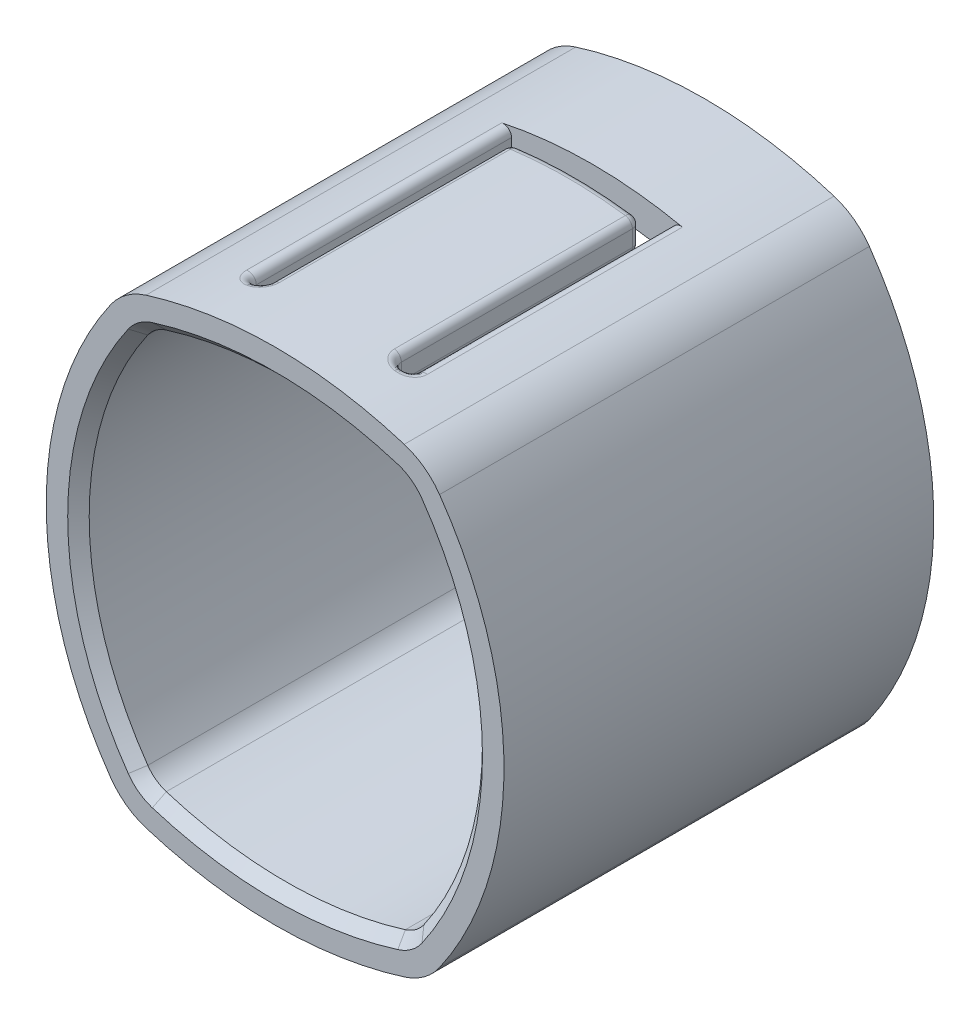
ISO-10303-21;
HEADER;
FILE_DESCRIPTION(('STEP AP214'),'2;1');
FILE_NAME('part.step','',(''),(''),'','','');
FILE_SCHEMA(('AUTOMOTIVE_DESIGN { 1 0 10303 214 1 1 1 1 }'));
ENDSEC;
DATA;
#1=APPLICATION_CONTEXT('core data for automotive mechanical design processes');
#2=APPLICATION_PROTOCOL_DEFINITION('international standard','automotive_design',2000,#1);
#3=PRODUCT_CONTEXT('',#1,'mechanical');
#4=PRODUCT('Part','Part','',(#3));
#5=PRODUCT_RELATED_PRODUCT_CATEGORY('part','',(#4));
#6=PRODUCT_DEFINITION_FORMATION('','',#4);
#7=PRODUCT_DEFINITION_CONTEXT('part definition',#1,'design');
#8=PRODUCT_DEFINITION('design','',#6,#7);
#9=PRODUCT_DEFINITION_SHAPE('','',#8);
#10=(LENGTH_UNIT() NAMED_UNIT(*) SI_UNIT(.MILLI.,.METRE.));
#11=(NAMED_UNIT(*) PLANE_ANGLE_UNIT() SI_UNIT($,.RADIAN.));
#12=(NAMED_UNIT(*) SI_UNIT($,.STERADIAN.) SOLID_ANGLE_UNIT());
#13=UNCERTAINTY_MEASURE_WITH_UNIT(LENGTH_MEASURE(1.E-05),#10,'distance_accuracy_value','');
#14=(GEOMETRIC_REPRESENTATION_CONTEXT(3) GLOBAL_UNCERTAINTY_ASSIGNED_CONTEXT((#13)) GLOBAL_UNIT_ASSIGNED_CONTEXT((#10,
#11,#12)) REPRESENTATION_CONTEXT('',''));
#15=CARTESIAN_POINT('',(0.,0.,0.));
#16=DIRECTION('',(0.,0.,1.));
#17=DIRECTION('',(1.,0.,0.));
#18=AXIS2_PLACEMENT_3D('',#15,#16,#17);
#19=CARTESIAN_POINT('',(0.,-17.,40.));
#20=DIRECTION('',(0.,0.,-1.));
#21=DIRECTION('',(-1.,0.,0.));
#22=AXIS2_PLACEMENT_3D('',#19,#20,#21);
#23=CYLINDRICAL_SURFACE('',#22,37.3);
#24=CARTESIAN_POINT('',(0.,-17.,10.5));
#25=DIRECTION('',(0.,0.,1.));
#26=DIRECTION('',(1.,0.,0.));
#27=AXIS2_PLACEMENT_3D('',#24,#25,#26);
#28=CIRCLE('',#27,37.3);
#29=CARTESIAN_POINT('',(-8.0873850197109,19.4126928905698,10.5));
#30=VERTEX_POINT('',#29);
#31=CARTESIAN_POINT('',(8.08738501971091,19.4126928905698,10.5));
#32=VERTEX_POINT('',#31);
#33=EDGE_CURVE('E408',#30,#32,#28,.F.);
#34=ORIENTED_EDGE('',*,*,#33,.F.);
#35=DIRECTION('',(0.,0.,-1.));
#36=VECTOR('',#35,1.);
#37=CARTESIAN_POINT('',(-8.0873850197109,19.4126928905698,40.));
#38=LINE('',#37,#36);
#39=CARTESIAN_POINT('',(-8.0873850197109,19.4126928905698,34.25));
#40=VERTEX_POINT('',#39);
#41=EDGE_CURVE('E778',#30,#40,#38,.F.);
#42=ORIENTED_EDGE('',*,*,#41,.T.);
#43=CARTESIAN_POINT('',(-7.45976124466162,20.1626344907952,34.0076387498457));
#44=CARTESIAN_POINT('',(-7.44578551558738,19.553826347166,33.9667104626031));
#45=CARTESIAN_POINT('',(-8.00849379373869,19.4301252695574,33.7652774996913));
#46=CARTESIAN_POINT('',(-7.47307385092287,20.1567736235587,34.0465055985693));
#47=CARTESIAN_POINT('',(-7.46362464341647,19.5503246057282,34.0112833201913));
#48=CARTESIAN_POINT('',(-8.0345941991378,19.4243799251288,33.8430111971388));
#49=CARTESIAN_POINT('',(-7.48313506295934,20.1523274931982,34.0865296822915));
#50=CARTESIAN_POINT('',(-7.4771853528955,19.547655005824,34.0579240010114));
#51=CARTESIAN_POINT('',(-8.05431999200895,19.4200214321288,33.923059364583));
#52=CARTESIAN_POINT('',(-7.49659404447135,20.146368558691,34.1677025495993));
#53=CARTESIAN_POINT('',(-7.49534873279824,19.5440741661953,34.1530014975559));
#54=CARTESIAN_POINT('',(-8.08070737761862,19.414179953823,34.0854050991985));
#55=CARTESIAN_POINT('',(-7.49999736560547,20.1448533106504,34.208850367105));
#56=CARTESIAN_POINT('',(-7.49999246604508,19.5431548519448,34.2015211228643));
#57=CARTESIAN_POINT('',(-8.08737985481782,19.4126945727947,34.1677007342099));
#58=CARTESIAN_POINT('',(-7.50000265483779,20.144849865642,34.2914689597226));
#59=CARTESIAN_POINT('',(-7.50000759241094,19.5431514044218,34.2988550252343));
#60=CARTESIAN_POINT('',(-8.08739022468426,19.4126911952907,34.3329379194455));
#61=CARTESIAN_POINT('',(-7.4965516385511,20.146385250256,34.3329397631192));
#62=CARTESIAN_POINT('',(-7.49530674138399,19.5440815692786,34.3477632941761));
#63=CARTESIAN_POINT('',(-8.08062423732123,19.4141963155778,34.4158795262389));
#64=CARTESIAN_POINT('',(-7.48286883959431,20.1524475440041,34.4146789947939));
#65=CARTESIAN_POINT('',(-7.47680951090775,19.5477300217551,34.4434810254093));
#66=CARTESIAN_POINT('',(-8.05379804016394,19.4201391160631,34.5793579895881));
#67=CARTESIAN_POINT('',(-7.47263843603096,20.1569738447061,34.4549476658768));
#68=CARTESIAN_POINT('',(-7.4629799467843,19.5504548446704,34.4903777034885));
#69=CARTESIAN_POINT('',(-8.03374053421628,19.4245761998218,34.6598953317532));
#70=CARTESIAN_POINT('',(-7.44573202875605,20.1688016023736,34.5331355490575));
#71=CARTESIAN_POINT('',(-7.42698194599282,19.5575133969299,34.5802331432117));
#72=CARTESIAN_POINT('',(-7.98098841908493,19.4361708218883,34.8162710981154));
#73=CARTESIAN_POINT('',(-7.42905945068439,20.1761015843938,34.5710559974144));
#74=CARTESIAN_POINT('',(-7.40475463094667,19.5618585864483,34.6232587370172));
#75=CARTESIAN_POINT('',(-7.94830052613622,19.4433269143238,34.8921119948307));
#76=CARTESIAN_POINT('',(-7.38978362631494,20.1931466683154,34.6435438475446));
#77=CARTESIAN_POINT('',(-7.35310037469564,19.5718930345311,34.7038586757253));
#78=CARTESIAN_POINT('',(-7.87129720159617,19.4600360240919,35.0370876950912));
#79=CARTESIAN_POINT('',(-7.36717918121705,20.2028922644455,34.6781105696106));
#80=CARTESIAN_POINT('',(-7.32359223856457,19.5775977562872,34.7414649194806));
#81=CARTESIAN_POINT('',(-7.82697941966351,19.4695895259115,35.1062211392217));
#82=CARTESIAN_POINT('',(-7.31642157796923,20.2245349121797,34.7433499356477));
#83=CARTESIAN_POINT('',(-7.25843037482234,19.5901034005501,34.8104197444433));
#84=CARTESIAN_POINT('',(-7.72746516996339,19.4908055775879,35.2366998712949));
#85=CARTESIAN_POINT('',(-7.28820806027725,20.2364552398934,34.7739736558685));
#86=CARTESIAN_POINT('',(-7.22262835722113,19.5969312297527,34.8416872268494));
#87=CARTESIAN_POINT('',(-7.67215036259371,19.5024909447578,35.2979473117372));
#88=CARTESIAN_POINT('',(-7.22721406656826,20.2618861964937,34.8300724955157));
#89=CARTESIAN_POINT('',(-7.14677007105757,19.6112846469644,34.8965997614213));
#90=CARTESIAN_POINT('',(-7.55256686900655,19.5274206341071,35.4101449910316));
#91=CARTESIAN_POINT('',(-7.19443322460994,20.2753969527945,34.8555472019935));
#92=CARTESIAN_POINT('',(-7.10664017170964,19.6188232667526,34.9202082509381));
#93=CARTESIAN_POINT('',(-7.48829746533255,19.5406650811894,35.4610944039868));
#94=CARTESIAN_POINT('',(-7.12445768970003,20.3038063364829,34.9012019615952));
#95=CARTESIAN_POINT('',(-7.02292832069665,19.634429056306,34.959833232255));
#96=CARTESIAN_POINT('',(-7.35110495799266,19.5685144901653,35.5524039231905));
#97=CARTESIAN_POINT('',(-7.08718280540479,20.3187286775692,34.9212554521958));
#98=CARTESIAN_POINT('',(-6.97924570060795,19.642511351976,34.9756052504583));
#99=CARTESIAN_POINT('',(-7.27802463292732,19.5831426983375,35.5925109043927));
#100=CARTESIAN_POINT('',(-7.00984955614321,20.349165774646,34.954808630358));
#101=CARTESIAN_POINT('',(-6.89099235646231,19.6587305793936,34.998782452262));
#102=CARTESIAN_POINT('',(-7.12640675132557,19.6129798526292,35.659617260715));
#103=CARTESIAN_POINT('',(-6.96979108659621,20.3646805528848,34.9683080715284));
#104=CARTESIAN_POINT('',(-6.84640006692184,19.666870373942,35.006106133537));
#105=CARTESIAN_POINT('',(-7.0478689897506,19.6281888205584,35.6866161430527));
#106=CARTESIAN_POINT('',(-6.88737142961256,20.3960241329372,34.9885499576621));
#107=CARTESIAN_POINT('',(-6.75726386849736,19.6830643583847,35.0128213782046));
#108=CARTESIAN_POINT('',(-6.88627880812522,19.6589145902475,35.7270999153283));
#109=CARTESIAN_POINT('',(-6.84498476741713,20.4118541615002,34.9951883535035));
#110=CARTESIAN_POINT('',(-6.71274977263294,19.6911111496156,35.0120060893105));
#111=CARTESIAN_POINT('',(-6.80317644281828,19.6744325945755,35.7403767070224));
#112=CARTESIAN_POINT('',(-6.75965817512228,20.4431088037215,35.0011571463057));
#113=CARTESIAN_POINT('',(-6.62587704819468,19.7067858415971,35.0028643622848));
#114=CARTESIAN_POINT('',(-6.63588698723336,19.7050711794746,35.7523142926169));
#115=CARTESIAN_POINT('',(-6.71671819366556,20.4585333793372,35.0004868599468));
#116=CARTESIAN_POINT('',(-6.58356170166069,19.7144056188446,34.9944614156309));
#117=CARTESIAN_POINT('',(-6.5516997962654,19.7201917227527,35.7509737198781));
#118=CARTESIAN_POINT('',(-6.63145442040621,20.4885577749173,34.9918095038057));
#119=CARTESIAN_POINT('',(-6.50216552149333,19.7290899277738,34.9710594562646));
#120=CARTESIAN_POINT('',(-6.38453350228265,19.7496243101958,35.7336190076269));
#121=CARTESIAN_POINT('',(-6.58913146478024,20.5031565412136,34.9837932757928));
#122=CARTESIAN_POINT('',(-6.46315470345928,19.7361421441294,34.9559965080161));
#123=CARTESIAN_POINT('',(-6.30155603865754,19.763935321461,35.7175865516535));
#124=CARTESIAN_POINT('',(-6.50633547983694,20.5311702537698,34.9606280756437));
#125=CARTESIAN_POINT('',(-6.3890985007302,19.7496003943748,34.9202411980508));
#126=CARTESIAN_POINT('',(-6.13922803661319,19.791396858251,35.6712561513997));
#127=CARTESIAN_POINT('',(-6.46586446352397,20.5445839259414,34.9454715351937));
#128=CARTESIAN_POINT('',(-6.35413314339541,19.7559926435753,34.8995106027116));
#129=CARTESIAN_POINT('',(-6.05988144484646,19.8045461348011,35.6409430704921));
#130=CARTESIAN_POINT('',(-6.42695576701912,20.5572198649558,34.9268621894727));
#131=CARTESIAN_POINT('',(-6.32168979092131,19.761985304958,34.8766221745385));
#132=CARTESIAN_POINT('',(-5.98359790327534,19.8169330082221,35.6037243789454));
#133=(BOUNDED_SURFACE() B_SPLINE_SURFACE(3,2,((#43,#44,#45),(#46,#47,#48),(#49,#50,#51),(#52,
#53,#54),(#55,#56,#57),(#58,#59,#60),(#61,#62,#63),(#64,#65,#66),(#67,#68,#69),(#70,#71,#72),
(#73,#74,#75),(#76,#77,#78),(#79,#80,#81),(#82,#83,#84),(#85,#86,#87),(#88,#89,#90),(#91,#92,
#93),(#94,#95,#96),(#97,#98,#99),(#100,#101,#102),(#103,#104,#105),(#106,#107,#108),(#109,#110,
#111),(#112,#113,#114),(#115,#116,#117),(#118,#119,#120),(#121,#122,#123),(#124,#125,#126),
(#127,#128,#129),(#130,#131,#132)),.UNSPECIFIED.,.F.,.F.,.F.) B_SPLINE_SURFACE_WITH_KNOTS((4,2,
2,2,2,2,2,2,2,2,2,2,2,2,4),(3,3),(0.,0.246814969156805,0.493424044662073,0.741946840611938,
0.990419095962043,1.23875940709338,1.48714994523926,1.73837420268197,1.98961860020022,
2.24630215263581,2.50299535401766,2.76352665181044,3.02408230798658,3.28496324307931,
3.54612132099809),(0.,1.),
.UNSPECIFIED.) GEOMETRIC_REPRESENTATION_ITEM() RATIONAL_B_SPLINE_SURFACE(((1.,0.775624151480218,
1.),(1.,0.77706806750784,1.),(1.,0.778163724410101,1.),(1.,0.779632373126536,1.),(1.,
0.780005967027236,1.),(1.,0.780006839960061,1.),(1.,0.779628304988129,1.),(1.,0.778134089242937,
1.),(1.,0.777018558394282,1.),(1.,0.774104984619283,1.),(1.,0.772307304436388,1.),(1.,
0.768113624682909,1.),(1.,0.765717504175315,1.),(1.,0.760404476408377,1.),(1.,0.757481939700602,
1.),(1.,0.751262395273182,1.),(1.,0.747965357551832,1.),(1.,0.741058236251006,1.),(1.,
0.737442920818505,1.),(1.,0.730108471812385,1.),(1.,0.726389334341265,1.),(1.,0.718930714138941,
1.),(1.,0.715191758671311,1.),(1.,0.707880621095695,1.),(1.,0.704308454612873,1.),(1.,
0.697438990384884,1.),(1.,0.694142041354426,1.),(1.,0.687903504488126,1.),(1.,0.684962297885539,
1.),(1.,0.682240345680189,1.))) REPRESENTATION_ITEM('') SURFACE());
#134=CARTESIAN_POINT('',(-5.98359790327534,19.8169330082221,35.6037243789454));
#135=CARTESIAN_POINT('',(-6.05988144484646,19.8045461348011,35.6409430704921));
#136=CARTESIAN_POINT('',(-6.13922803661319,19.791396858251,35.6712561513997));
#137=CARTESIAN_POINT('',(-6.30155603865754,19.763935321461,35.7175865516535));
#138=CARTESIAN_POINT('',(-6.38453350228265,19.7496243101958,35.7336190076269));
#139=CARTESIAN_POINT('',(-6.5516997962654,19.7201917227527,35.7509737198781));
#140=CARTESIAN_POINT('',(-6.63588698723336,19.7050711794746,35.7523142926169));
#141=CARTESIAN_POINT('',(-6.80317644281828,19.6744325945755,35.7403767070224));
#142=CARTESIAN_POINT('',(-6.88627880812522,19.6589145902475,35.7270999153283));
#143=CARTESIAN_POINT('',(-7.0478689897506,19.6281888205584,35.6866161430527));
#144=CARTESIAN_POINT('',(-7.12640675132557,19.6129798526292,35.659617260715));
#145=CARTESIAN_POINT('',(-7.27802463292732,19.5831426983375,35.5925109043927));
#146=CARTESIAN_POINT('',(-7.35110495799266,19.5685144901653,35.5524039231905));
#147=CARTESIAN_POINT('',(-7.48829746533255,19.5406650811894,35.4610944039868));
#148=CARTESIAN_POINT('',(-7.55256686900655,19.5274206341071,35.4101449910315));
#149=CARTESIAN_POINT('',(-7.6721503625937,19.5024909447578,35.2979473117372));
#150=CARTESIAN_POINT('',(-7.72746516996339,19.4908055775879,35.2366998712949));
#151=CARTESIAN_POINT('',(-7.82697941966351,19.4695895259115,35.1062211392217));
#152=CARTESIAN_POINT('',(-7.87129720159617,19.4600360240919,35.0370876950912));
#153=CARTESIAN_POINT('',(-7.94830052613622,19.4433269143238,34.8921119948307));
#154=CARTESIAN_POINT('',(-7.98098841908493,19.4361708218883,34.8162710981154));
#155=CARTESIAN_POINT('',(-8.03374053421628,19.4245761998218,34.6598953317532));
#156=CARTESIAN_POINT('',(-8.05379804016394,19.4201391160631,34.5793579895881));
#157=CARTESIAN_POINT('',(-8.08062423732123,19.4141963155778,34.4158795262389));
#158=CARTESIAN_POINT('',(-8.08739022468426,19.4126911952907,34.3329379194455));
#159=CARTESIAN_POINT('',(-8.08737985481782,19.4126945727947,34.1677007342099));
#160=CARTESIAN_POINT('',(-8.08070737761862,19.414179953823,34.0854050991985));
#161=CARTESIAN_POINT('',(-8.05431999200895,19.4200214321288,33.923059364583));
#162=CARTESIAN_POINT('',(-8.0345941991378,19.4243799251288,33.8430111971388));
#163=CARTESIAN_POINT('',(-8.00849379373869,19.4301252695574,33.7652774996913));
#164=B_SPLINE_CURVE_WITH_KNOTS('',3,(#134,#135,#136,#137,#138,#139,#140,#141,#142,#143,#144,
#145,#146,#147,#148,#149,#150,#151,#152,#153,#154,#155,#156,#157,#158,#159,#160,#161,#162,#163),
.UNSPECIFIED.,.F.,.F.,(4,2,2,2,2,2,2,2,2,2,2,2,2,2,4),(0.,0.261158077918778,0.522039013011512,
0.782594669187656,1.04312596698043,1.29981916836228,1.55650272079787,1.80774711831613,
2.05897137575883,2.30736191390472,2.55570222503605,2.80417448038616,3.05269727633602,
3.29930635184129,3.54612132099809),.UNSPECIFIED.);
#165=CARTESIAN_POINT('',(-6.61695137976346,19.7083907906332,35.75));
#166=VERTEX_POINT('',#165);
#167=EDGE_CURVE('E771',#166,#40,#164,.T.);
#168=ORIENTED_EDGE('',*,*,#167,.F.);
#169=CARTESIAN_POINT('',(-7.0027226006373,20.3518542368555,34.9561382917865));
#170=CARTESIAN_POINT('',(-6.88360310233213,19.6600647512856,34.9987704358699));
#171=CARTESIAN_POINT('',(-7.11243379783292,19.615615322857,35.662276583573));
#172=CARTESIAN_POINT('',(-6.96226670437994,20.367582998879,34.9706527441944));
#173=CARTESIAN_POINT('',(-6.83803011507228,19.6684012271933,35.0073521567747));
#174=CARTESIAN_POINT('',(-7.03311685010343,19.6310340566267,35.691305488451));
#175=CARTESIAN_POINT('',(-6.92056823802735,20.3834983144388,34.9816187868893));
#176=CARTESIAN_POINT('',(-6.79270752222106,19.6766358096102,35.0114340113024));
#177=CARTESIAN_POINT('',(-6.95136374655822,19.6466356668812,35.7132375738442));
#178=CARTESIAN_POINT('',(-6.83592198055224,20.4152074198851,34.9962894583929));
#179=CARTESIAN_POINT('',(-6.70336865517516,19.692809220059,35.0115888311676));
#180=CARTESIAN_POINT('',(-6.78540814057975,19.6777197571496,35.7425789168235));
#181=CARTESIAN_POINT('',(-6.79297480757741,20.4310012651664,34.9999976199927));
#182=CARTESIAN_POINT('',(-6.65937628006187,19.7007431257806,35.0075812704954));
#183=CARTESIAN_POINT('',(-6.70120685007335,19.6932022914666,35.7499952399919));
#184=CARTESIAN_POINT('',(-6.70752646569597,20.4618083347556,35.0000023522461));
#185=CARTESIAN_POINT('',(-6.57459544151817,19.7160260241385,34.9924310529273));
#186=CARTESIAN_POINT('',(-6.53367869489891,19.7234021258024,35.7500047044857));
#187=CARTESIAN_POINT('',(-6.66502593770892,20.4768285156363,34.9963848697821));
#188=CARTESIAN_POINT('',(-6.53382337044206,19.7233720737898,34.9813038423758));
#189=CARTESIAN_POINT('',(-6.45035308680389,19.7381262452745,35.7427697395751));
#190=CARTESIAN_POINT('',(-6.58117920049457,20.5058846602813,34.9819886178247));
#191=CARTESIAN_POINT('',(-6.45585310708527,19.7374666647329,34.9529603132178));
#192=CARTESIAN_POINT('',(-6.2859650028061,19.7666096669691,35.7139772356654));
#193=CARTESIAN_POINT('',(-6.53983267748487,20.5199208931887,34.9712118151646));
#194=CARTESIAN_POINT('',(-6.4187227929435,19.7442033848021,34.9357003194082));
#195=CARTESIAN_POINT('',(-6.20490191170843,19.7803692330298,35.6924236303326));
#196=CARTESIAN_POINT('',(-6.4594467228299,20.5466897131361,34.942746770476));
#197=CARTESIAN_POINT('',(-6.34865293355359,19.7570047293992,34.8960715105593));
#198=CARTESIAN_POINT('',(-6.04729896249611,19.8066104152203,35.6354935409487));
#199=CARTESIAN_POINT('',(-6.42040873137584,20.5594214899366,34.925054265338));
#200=CARTESIAN_POINT('',(-6.31579192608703,19.7630558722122,34.8736778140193));
#201=CARTESIAN_POINT('',(-5.97076192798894,19.8190912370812,35.6001085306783));
#202=CARTESIAN_POINT('',(-6.3458215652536,20.5833086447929,34.8832201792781));
#203=CARTESIAN_POINT('',(-6.25466889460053,19.7744221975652,34.8247409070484));
#204=CARTESIAN_POINT('',(-5.82452795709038,19.8425075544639,35.516440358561));
#205=CARTESIAN_POINT('',(-6.31027227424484,20.5944640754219,34.8590788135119));
#206=CARTESIAN_POINT('',(-6.22647998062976,19.7797246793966,34.7981974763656));
#207=CARTESIAN_POINT('',(-5.75483079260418,19.8534431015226,35.4681576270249));
#208=CARTESIAN_POINT('',(-6.24405071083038,20.6149059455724,34.8052644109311));
#209=CARTESIAN_POINT('',(-6.17514358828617,19.7894911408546,34.7420786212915));
#210=CARTESIAN_POINT('',(-5.62499823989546,19.8734820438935,35.360528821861));
#211=CARTESIAN_POINT('',(-6.21333571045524,20.6242089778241,34.7756455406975));
#212=CARTESIAN_POINT('',(-6.15201265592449,19.7939515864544,34.7125486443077));
#213=CARTESIAN_POINT('',(-5.56477908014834,19.8826017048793,35.3012910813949));
#214=CARTESIAN_POINT('',(-6.15731423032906,20.6409434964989,34.7115567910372));
#215=CARTESIAN_POINT('',(-6.11055106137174,19.802035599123,34.6509689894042));
#216=CARTESIAN_POINT('',(-5.45494458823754,19.8990063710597,35.1731135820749));
#217=CARTESIAN_POINT('',(-6.1320074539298,20.6483750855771,34.6770871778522));
#218=CARTESIAN_POINT('',(-6.09227096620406,19.8056497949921,34.6189468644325));
#219=CARTESIAN_POINT('',(-5.40532867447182,19.906291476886,35.1041743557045));
#220=CARTESIAN_POINT('',(-6.08784731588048,20.6612043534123,34.6047238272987));
#221=CARTESIAN_POINT('',(-6.06075619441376,19.8119389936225,34.553414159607));
#222=CARTESIAN_POINT('',(-5.31874927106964,19.9188678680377,34.9594476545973));
#223=CARTESIAN_POINT('',(-6.06892010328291,20.6666253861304,34.5668761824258));
#224=CARTESIAN_POINT('',(-6.0474997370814,19.8146177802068,34.5199578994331));
#225=CARTESIAN_POINT('',(-5.28164099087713,19.9241820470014,34.8837523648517));
#226=CARTESIAN_POINT('',(-6.03767928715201,20.6755100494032,34.4884928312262));
#227=CARTESIAN_POINT('',(-6.02577029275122,19.8190368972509,34.4517719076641));
#228=CARTESIAN_POINT('',(-5.22039092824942,19.932891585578,34.7269856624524));
#229=CARTESIAN_POINT('',(-6.02536485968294,20.6789739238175,34.4479574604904));
#230=CARTESIAN_POINT('',(-6.01732131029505,19.8207724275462,34.4170788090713));
#231=CARTESIAN_POINT('',(-5.1962475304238,19.9362871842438,34.6459149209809));
#232=CARTESIAN_POINT('',(-6.00779505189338,20.6839007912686,34.3656988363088));
#233=CARTESIAN_POINT('',(-6.0052931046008,19.823250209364,34.3472512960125));
#234=CARTESIAN_POINT('',(-5.16180054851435,19.9411169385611,34.4813976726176));
#235=CARTESIAN_POINT('',(-6.00248355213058,20.6853796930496,34.3239877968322));
#236=CARTESIAN_POINT('',(-6.00168814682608,19.8239976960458,34.3121595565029));
#237=CARTESIAN_POINT('',(-5.15138693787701,19.9425666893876,34.3979755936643));
#238=CARTESIAN_POINT('',(-5.99889252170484,20.6863802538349,34.2402487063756));
#239=CARTESIAN_POINT('',(-5.99924721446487,19.8245034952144,34.2417933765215));
#240=CARTESIAN_POINT('',(-5.14434644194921,19.9435475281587,34.2304974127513));
#241=CARTESIAN_POINT('',(-6.00061435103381,20.6859015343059,34.198220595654));
#242=CARTESIAN_POINT('',(-6.00041477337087,19.824261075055,34.2065564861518));
#243=CARTESIAN_POINT('',(-5.14772222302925,19.9430782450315,34.146441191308));
#244=CARTESIAN_POINT('',(-6.01103332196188,20.6829929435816,34.1152119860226));
#245=CARTESIAN_POINT('',(-6.00751095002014,19.8227932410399,34.1365736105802));
#246=CARTESIAN_POINT('',(-5.1681494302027,19.9402269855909,33.9804239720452));
#247=CARTESIAN_POINT('',(-6.01970526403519,20.6805701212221,34.0742282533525));
#248=CARTESIAN_POINT('',(-6.01341479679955,19.8215729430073,34.1018634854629));
#249=CARTESIAN_POINT('',(-5.18515145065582,19.9378519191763,33.8984565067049));
#250=CARTESIAN_POINT('',(-6.04369991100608,20.673798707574,33.9942681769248));
#251=CARTESIAN_POINT('',(-6.02996477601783,19.8181834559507,34.0333164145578));
#252=CARTESIAN_POINT('',(-5.23219483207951,19.9312139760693,33.7385363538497));
#253=CARTESIAN_POINT('',(-6.05902724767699,20.6694487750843,33.9552932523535));
#254=CARTESIAN_POINT('',(-6.04059612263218,19.8160172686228,33.999516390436));
#255=CARTESIAN_POINT('',(-5.26224527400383,19.9269497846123,33.660586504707));
#256=CARTESIAN_POINT('',(-6.07752942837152,20.6641452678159,33.9179106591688));
#257=CARTESIAN_POINT('',(-6.05359280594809,19.8133928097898,33.9663815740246));
#258=CARTESIAN_POINT('',(-5.29852024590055,19.9217508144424,33.5858213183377));
#259=(BOUNDED_SURFACE() B_SPLINE_SURFACE(3,2,((#169,#170,#171),(#172,#173,#174),(#175,#176,
#177),(#178,#179,#180),(#181,#182,#183),(#184,#185,#186),(#187,#188,#189),(#190,#191,#192),
(#193,#194,#195),(#196,#197,#198),(#199,#200,#201),(#202,#203,#204),(#205,#206,#207),(#208,#209,
#210),(#211,#212,#213),(#214,#215,#216),(#217,#218,#219),(#220,#221,#222),(#223,#224,#225),
(#226,#227,#228),(#229,#230,#231),(#232,#233,#234),(#235,#236,#237),(#238,#239,#240),(#241,#242,
#243),(#244,#245,#246),(#247,#248,#249),(#250,#251,#252),(#253,#254,#255),(#256,#257,#258)),
.UNSPECIFIED.,.F.,.F.,.F.) B_SPLINE_SURFACE_WITH_KNOTS((4,2,2,2,2,2,2,2,2,2,2,2,2,2,4),(3,3),
(0.,0.261826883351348,0.523526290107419,0.782173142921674,1.04074896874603,1.29948444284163,
1.5582112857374,1.81450455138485,2.07078375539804,2.3239852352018,2.57715515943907,
2.82828366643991,3.07946073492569,3.32973119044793,3.58017609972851),(0.,1.),
.UNSPECIFIED.) GEOMETRIC_REPRESENTATION_ITEM() RATIONAL_B_SPLINE_SURFACE(((1.,0.729469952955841,
1.),(1.,0.725695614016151,1.),(1.,0.72190136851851,1.),(1.,0.714404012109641,1.),(1.,
0.7107008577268,1.),(1.,0.703554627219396,1.),(1.,0.700109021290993,1.),(1.,0.693528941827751,
1.),(1.,0.690394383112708,1.),(1.,0.684505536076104,1.),(1.,0.681751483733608,1.),(1.,
0.676669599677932,1.),(1.,0.674341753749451,1.),(1.,0.670149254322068,1.),(1.,0.668280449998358,
1.),(1.,0.664973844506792,1.),(1.,0.663536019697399,1.),(1.,0.661088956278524,1.),(1.,
0.660074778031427,1.),(1.,0.658429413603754,1.),(1.,0.657798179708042,1.),(1.,0.656904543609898,
1.),(1.,0.65663920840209,1.),(1.,0.656459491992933,1.),(1.,0.656545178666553,1.),(1.,
0.657069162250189,1.),(1.,0.657506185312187,1.),(1.,0.658746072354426,1.),(1.,0.659549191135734,
1.),(1.,0.660542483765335,1.))) REPRESENTATION_ITEM('') SURFACE());
#260=CARTESIAN_POINT('',(-5.29852024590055,19.9217508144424,33.5858213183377));
#261=CARTESIAN_POINT('',(-5.26224527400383,19.9269497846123,33.660586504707));
#262=CARTESIAN_POINT('',(-5.23219483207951,19.9312139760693,33.7385363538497));
#263=CARTESIAN_POINT('',(-5.18515145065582,19.9378519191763,33.8984565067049));
#264=CARTESIAN_POINT('',(-5.1681494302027,19.9402269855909,33.9804239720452));
#265=CARTESIAN_POINT('',(-5.14772222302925,19.9430782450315,34.146441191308));
#266=CARTESIAN_POINT('',(-5.14434644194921,19.9435475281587,34.2304974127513));
#267=CARTESIAN_POINT('',(-5.15138693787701,19.9425666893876,34.3979755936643));
#268=CARTESIAN_POINT('',(-5.16180054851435,19.9411169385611,34.4813976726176));
#269=CARTESIAN_POINT('',(-5.1962475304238,19.9362871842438,34.6459149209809));
#270=CARTESIAN_POINT('',(-5.22039092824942,19.932891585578,34.7269856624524));
#271=CARTESIAN_POINT('',(-5.28164099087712,19.9241820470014,34.8837523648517));
#272=CARTESIAN_POINT('',(-5.31874927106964,19.9188678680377,34.9594476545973));
#273=CARTESIAN_POINT('',(-5.40532867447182,19.906291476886,35.1041743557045));
#274=CARTESIAN_POINT('',(-5.45494458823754,19.8990063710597,35.1731135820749));
#275=CARTESIAN_POINT('',(-5.56477908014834,19.8826017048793,35.3012910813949));
#276=CARTESIAN_POINT('',(-5.62499823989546,19.8734820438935,35.360528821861));
#277=CARTESIAN_POINT('',(-5.75483079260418,19.8534431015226,35.4681576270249));
#278=CARTESIAN_POINT('',(-5.82452795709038,19.8425075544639,35.516440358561));
#279=CARTESIAN_POINT('',(-5.97076192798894,19.8190912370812,35.6001085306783));
#280=CARTESIAN_POINT('',(-6.04729896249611,19.8066104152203,35.6354935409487));
#281=CARTESIAN_POINT('',(-6.20490191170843,19.7803692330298,35.6924236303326));
#282=CARTESIAN_POINT('',(-6.2859650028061,19.7666096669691,35.7139772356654));
#283=CARTESIAN_POINT('',(-6.45035308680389,19.7381262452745,35.7427697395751));
#284=CARTESIAN_POINT('',(-6.53367869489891,19.7234021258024,35.7500047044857));
#285=CARTESIAN_POINT('',(-6.70120685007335,19.6932022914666,35.7499952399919));
#286=CARTESIAN_POINT('',(-6.78540814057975,19.6777197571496,35.7425789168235));
#287=CARTESIAN_POINT('',(-6.95136374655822,19.6466356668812,35.7132375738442));
#288=CARTESIAN_POINT('',(-7.03311685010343,19.6310340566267,35.691305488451));
#289=CARTESIAN_POINT('',(-7.11243379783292,19.615615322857,35.662276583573));
#290=B_SPLINE_CURVE_WITH_KNOTS('',3,(#260,#261,#262,#263,#264,#265,#266,#267,#268,#269,#270,
#271,#272,#273,#274,#275,#276,#277,#278,#279,#280,#281,#282,#283,#284,#285,#286,#287,#288,#289),
.UNSPECIFIED.,.F.,.F.,(4,2,2,2,2,2,2,2,2,2,2,2,2,2,4),(0.,0.250444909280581,0.500715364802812,
0.751892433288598,1.00302094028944,1.25619086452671,1.50939234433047,1.76567154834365,
2.0219648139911,2.28069165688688,2.53942713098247,2.79800295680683,3.05664980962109,
3.31834921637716,3.58017609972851),.UNSPECIFIED.);
#291=CARTESIAN_POINT('',(-5.14651773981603,19.9432450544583,34.25));
#292=VERTEX_POINT('',#291);
#293=EDGE_CURVE('E779',#292,#166,#290,.T.);
#294=ORIENTED_EDGE('',*,*,#293,.F.);
#295=DIRECTION('',(0.,0.,-1.));
#296=VECTOR('',#295,1.);
#297=CARTESIAN_POINT('',(-5.14651773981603,19.9432450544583,40.));
#298=LINE('',#297,#296);
#299=CARTESIAN_POINT('',(-5.14651773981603,19.9432450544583,12.75));
#300=VERTEX_POINT('',#299);
#301=EDGE_CURVE('E1501',#292,#300,#298,.T.);
#302=ORIENTED_EDGE('',*,*,#301,.T.);
#303=CARTESIAN_POINT('',(0.,-17.,12.75));
#304=DIRECTION('',(0.,0.,1.));
#305=DIRECTION('',(1.,0.,0.));
#306=AXIS2_PLACEMENT_3D('',#303,#304,#305);
#307=CIRCLE('',#306,37.3);
#308=CARTESIAN_POINT('',(5.14651773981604,19.9432450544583,12.75));
#309=VERTEX_POINT('',#308);
#310=EDGE_CURVE('E1495',#300,#309,#307,.F.);
#311=ORIENTED_EDGE('',*,*,#310,.T.);
#312=DIRECTION('',(0.,0.,-1.));
#313=VECTOR('',#312,1.);
#314=CARTESIAN_POINT('',(5.14651773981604,19.9432450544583,40.));
#315=LINE('',#314,#313);
#316=CARTESIAN_POINT('',(5.14651773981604,19.9432450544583,34.25));
#317=VERTEX_POINT('',#316);
#318=EDGE_CURVE('E1494',#309,#317,#315,.F.);
#319=ORIENTED_EDGE('',*,*,#318,.T.);
#320=CARTESIAN_POINT('',(6.04142258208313,20.6744377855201,34.0041991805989));
#321=CARTESIAN_POINT('',(6.02840900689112,19.8185037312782,34.0417138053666));
#322=CARTESIAN_POINT('',(5.22772995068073,19.9318404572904,33.7583983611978));
#323=CARTESIAN_POINT('',(6.02771140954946,20.6783114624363,34.0436115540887));
#324=CARTESIAN_POINT('',(6.01894280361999,19.8204404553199,34.0757671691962));
#325=CARTESIAN_POINT('',(5.2008481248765,19.935637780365,33.8372231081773));
#326=CARTESIAN_POINT('',(6.01735444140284,20.6812205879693,34.0842011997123));
#327=CARTESIAN_POINT('',(6.01184041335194,19.8219012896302,34.1102981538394));
#328=CARTESIAN_POINT('',(5.18054247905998,19.9384895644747,33.9184023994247));
#329=CARTESIAN_POINT('',(6.00350262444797,20.6850998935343,34.1665274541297));
#330=CARTESIAN_POINT('',(6.00236549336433,19.8238554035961,34.1799047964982));
#331=CARTESIAN_POINT('',(5.15338490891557,19.9422924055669,34.0830549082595));
#332=CARTESIAN_POINT('',(6.00000262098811,20.6860715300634,34.2082631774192));
#333=CARTESIAN_POINT('',(5.99999957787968,19.8243473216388,34.2149430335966));
#334=CARTESIAN_POINT('',(5.14652287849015,19.9432448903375,34.1665263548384));
#335=CARTESIAN_POINT('',(5.99999737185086,20.6860718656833,34.2918508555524));
#336=CARTESIAN_POINT('',(6.00000042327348,19.8243476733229,34.2851527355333));
#337=CARTESIAN_POINT('',(5.14651258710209,19.9432452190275,34.3337017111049));
#338=CARTESIAN_POINT('',(6.0035112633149,20.6850952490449,34.3337028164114));
#339=CARTESIAN_POINT('',(6.0023801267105,19.8238534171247,34.3202869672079));
#340=CARTESIAN_POINT('',(5.15340184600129,19.942287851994,34.4174056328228));
#341=CARTESIAN_POINT('',(6.01745330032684,20.6811951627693,34.4162055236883));
#342=CARTESIAN_POINT('',(6.0118991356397,19.8218881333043,34.3900484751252));
#343=CARTESIAN_POINT('',(5.18073629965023,19.9384646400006,34.5824110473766));
#344=CARTESIAN_POINT('',(6.02788008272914,20.6782720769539,34.4568565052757));
#345=CARTESIAN_POINT('',(6.01902726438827,19.8204194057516,34.4246387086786));
#346=CARTESIAN_POINT('',(5.20117882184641,19.9355991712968,34.6637130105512));
#347=CARTESIAN_POINT('',(6.05533498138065,20.6704987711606,34.5358101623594));
#348=CARTESIAN_POINT('',(6.03802607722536,19.8165400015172,34.4927787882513));
#349=CARTESIAN_POINT('',(5.25500629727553,19.9279790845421,34.8216203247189));
#350=CARTESIAN_POINT('',(6.07236239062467,20.6656487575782,34.5741130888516));
#351=CARTESIAN_POINT('',(6.04987532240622,19.8141336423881,34.5262927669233));
#352=CARTESIAN_POINT('',(5.28838986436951,19.9232246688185,34.8982261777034));
#353=CARTESIAN_POINT('',(6.112511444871,20.6540603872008,34.6473043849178));
#354=CARTESIAN_POINT('',(6.07829837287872,19.8084291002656,34.5917391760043));
#355=CARTESIAN_POINT('',(5.36710522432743,19.9118647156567,35.0446087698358));
#356=CARTESIAN_POINT('',(6.13563373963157,20.6473218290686,34.6821923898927));
#357=CARTESIAN_POINT('',(6.09484036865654,19.8051371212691,34.6236381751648));
#358=CARTESIAN_POINT('',(5.41243829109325,19.90525898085,35.1143847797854));
#359=CARTESIAN_POINT('',(6.18737606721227,20.6319996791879,34.7476969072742));
#360=CARTESIAN_POINT('',(6.13268901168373,19.7977051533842,34.6853674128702));
#361=CARTESIAN_POINT('',(5.51388316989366,19.8902388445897,35.2453938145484));
#362=CARTESIAN_POINT('',(6.21601437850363,20.6234099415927,34.77829861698));
#363=CARTESIAN_POINT('',(6.15396731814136,19.7935706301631,34.7151625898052));
#364=CARTESIAN_POINT('',(5.5700308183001,19.8818184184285,35.3065972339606));
#365=CARTESIAN_POINT('',(6.27789756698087,20.6045097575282,34.8342600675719));
#366=CARTESIAN_POINT('',(6.20120773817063,19.7845150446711,34.7718961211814));
#367=CARTESIAN_POINT('',(5.69135764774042,19.8632907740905,35.4185201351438));
#368=CARTESIAN_POINT('',(6.31114256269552,20.5941992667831,34.8596196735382));
#369=CARTESIAN_POINT('',(6.22711396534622,19.7796040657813,34.7988153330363));
#370=CARTESIAN_POINT('',(5.7565370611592,19.8531835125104,35.4692393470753));
#371=CARTESIAN_POINT('',(6.38160673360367,20.571916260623,34.9046375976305));
#372=CARTESIAN_POINT('',(6.28374486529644,19.7689968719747,34.8492522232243));
#373=CARTESIAN_POINT('',(5.89468757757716,19.8313397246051,35.5592751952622));
#374=CARTESIAN_POINT('',(6.41885977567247,20.5599292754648,34.9242411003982));
#375=CARTESIAN_POINT('',(6.31444693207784,19.7633051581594,34.8727322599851));
#376=CARTESIAN_POINT('',(5.96772507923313,19.8195890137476,35.5984822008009));
#377=CARTESIAN_POINT('',(6.49601461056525,20.5345931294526,34.9569279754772));
#378=CARTESIAN_POINT('',(6.38021175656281,19.7512237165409,34.9150851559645));
#379=CARTESIAN_POINT('',(6.11899316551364,19.7947522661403,35.6638559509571));
#380=CARTESIAN_POINT('',(6.53591652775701,20.521243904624,34.9700110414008));
#381=CARTESIAN_POINT('',(6.41520311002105,19.74484628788,34.93397090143));
#382=CARTESIAN_POINT('',(6.19722399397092,19.7816661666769,35.690022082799));
#383=CARTESIAN_POINT('',(6.61776059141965,20.4932992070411,34.9894617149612));
#384=CARTESIAN_POINT('',(6.48948905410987,19.7313767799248,34.9663527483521));
#385=CARTESIAN_POINT('',(6.3576856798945,19.7542722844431,35.728923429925));
#386=CARTESIAN_POINT('',(6.65972198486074,20.4786902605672,34.9957434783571));
#387=CARTESIAN_POINT('',(6.52876506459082,19.7242882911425,34.9798162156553));
#388=CARTESIAN_POINT('',(6.43995427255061,19.7399512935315,35.7414869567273));
#389=CARTESIAN_POINT('',(6.74404821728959,20.4487370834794,35.0011666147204));
#390=CARTESIAN_POINT('',(6.61041720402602,19.7095673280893,35.0000114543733));
#391=CARTESIAN_POINT('',(6.60528244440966,19.7105885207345,35.7523332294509));
#392=CARTESIAN_POINT('',(6.78641316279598,20.4333926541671,35.000306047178));
#393=CARTESIAN_POINT('',(6.65273565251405,19.7019451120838,35.0067997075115));
#394=CARTESIAN_POINT('',(6.68834223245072,19.6955465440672,35.7506120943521));
#395=CARTESIAN_POINT('',(6.87084452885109,20.4022216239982,34.9914278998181));
#396=CARTESIAN_POINT('',(6.73980138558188,19.6862205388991,35.0127632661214));
#397=CARTESIAN_POINT('',(6.85387652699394,19.6649899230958,35.7328557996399));
#398=CARTESIAN_POINT('',(6.91290209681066,20.3863915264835,34.9833291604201));
#399=CARTESIAN_POINT('',(6.78453853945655,19.6781199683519,35.0119298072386));
#400=CARTESIAN_POINT('',(6.9363336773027,19.6494718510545,35.7166583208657));
#401=CARTESIAN_POINT('',(6.99507873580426,20.354917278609,34.9601221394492));
#402=CARTESIAN_POINT('',(6.87439037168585,19.6617646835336,35.0018349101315));
#403=CARTESIAN_POINT('',(7.09744740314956,19.618617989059,35.6702442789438));
#404=CARTESIAN_POINT('',(7.03519673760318,20.3392732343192,34.9450100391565));
#405=CARTESIAN_POINT('',(6.91950118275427,19.6535115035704,34.9926554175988));
#406=CARTESIAN_POINT('',(7.17610188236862,19.6032823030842,35.6400200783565));
#407=CARTESIAN_POINT('',(7.07374827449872,20.3239808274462,34.9265257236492));
#408=CARTESIAN_POINT('',(6.96429231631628,19.6452516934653,34.978905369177));
#409=CARTESIAN_POINT('',(7.25168518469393,19.58829132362,35.6030514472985));
#410=(BOUNDED_SURFACE() B_SPLINE_SURFACE(3,2,((#320,#321,#322),(#323,#324,#325),(#326,#327,
#328),(#329,#330,#331),(#332,#333,#334),(#335,#336,#337),(#338,#339,#340),(#341,#342,#343),
(#344,#345,#346),(#347,#348,#349),(#350,#351,#352),(#353,#354,#355),(#356,#357,#358),(#359,#360,
#361),(#362,#363,#364),(#365,#366,#367),(#368,#369,#370),(#371,#372,#373),(#374,#375,#376),
(#377,#378,#379),(#380,#381,#382),(#383,#384,#385),(#386,#387,#388),(#389,#390,#391),(#392,#393,
#394),(#395,#396,#397),(#398,#399,#400),(#401,#402,#403),(#404,#405,#406),(#407,#408,#409)),
.UNSPECIFIED.,.F.,.F.,.F.) B_SPLINE_SURFACE_WITH_KNOTS((4,2,2,2,2,2,2,2,2,2,2,2,2,2,4),(3,3),
(0.,0.250316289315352,0.500444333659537,0.751255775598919,1.00201777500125,1.25275292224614,
1.50351481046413,1.75512240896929,2.00673648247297,2.26067425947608,2.514623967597,
2.77174288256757,3.028931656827,3.2890409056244,3.54929194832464),(0.,1.),
.UNSPECIFIED.) GEOMETRIC_REPRESENTATION_ITEM() RATIONAL_B_SPLINE_SURFACE(((1.,0.658630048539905,
1.),(1.,0.657919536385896,1.),(1.,0.657390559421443,1.),(1.,0.656688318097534,1.),(1.,
0.656514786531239,1.),(1.,0.656515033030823,1.),(1.,0.656689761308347,1.),(1.,0.657394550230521,
1.),(1.,0.6579245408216,1.),(1.,0.659354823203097,1.),(1.,0.660255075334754,1.),(1.,
0.66244614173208,1.),(1.,0.663736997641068,1.),(1.,0.666732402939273,1.),(1.,0.668438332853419,
1.),(1.,0.672269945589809,1.),(1.,0.67439563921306,1.),(1.,0.679079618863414,1.),(1.,
0.681641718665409,1.),(1.,0.687152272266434,1.),(1.,0.690100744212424,1.),(1.,0.696364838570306,
1.),(1.,0.699684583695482,1.),(1.,0.70657398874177,1.),(1.,0.710143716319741,1.),(1.,
0.717463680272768,1.),(1.,0.72121550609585,1.),(1.,0.728726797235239,1.),(1.,0.732486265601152,
1.),(1.,0.736180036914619,1.))) REPRESENTATION_ITEM('') SURFACE());
#411=CARTESIAN_POINT('',(7.25168518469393,19.58829132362,35.6030514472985));
#412=CARTESIAN_POINT('',(7.17610188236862,19.6032823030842,35.6400200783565));
#413=CARTESIAN_POINT('',(7.09744740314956,19.618617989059,35.6702442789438));
#414=CARTESIAN_POINT('',(6.9363336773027,19.6494718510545,35.7166583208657));
#415=CARTESIAN_POINT('',(6.85387652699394,19.6649899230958,35.7328557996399));
#416=CARTESIAN_POINT('',(6.68834223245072,19.6955465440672,35.7506120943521));
#417=CARTESIAN_POINT('',(6.60528244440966,19.7105885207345,35.7523332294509));
#418=CARTESIAN_POINT('',(6.43995427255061,19.7399512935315,35.7414869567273));
#419=CARTESIAN_POINT('',(6.35768567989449,19.7542722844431,35.728923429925));
#420=CARTESIAN_POINT('',(6.19722399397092,19.7816661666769,35.690022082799));
#421=CARTESIAN_POINT('',(6.11899316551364,19.7947522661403,35.6638559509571));
#422=CARTESIAN_POINT('',(5.96772507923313,19.8195890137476,35.5984822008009));
#423=CARTESIAN_POINT('',(5.89468757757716,19.8313397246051,35.5592751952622));
#424=CARTESIAN_POINT('',(5.7565370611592,19.8531835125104,35.4692393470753));
#425=CARTESIAN_POINT('',(5.69135764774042,19.8632907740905,35.4185201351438));
#426=CARTESIAN_POINT('',(5.5700308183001,19.8818184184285,35.3065972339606));
#427=CARTESIAN_POINT('',(5.51388316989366,19.8902388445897,35.2453938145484));
#428=CARTESIAN_POINT('',(5.41243829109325,19.90525898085,35.1143847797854));
#429=CARTESIAN_POINT('',(5.36710522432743,19.9118647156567,35.0446087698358));
#430=CARTESIAN_POINT('',(5.28838986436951,19.9232246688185,34.8982261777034));
#431=CARTESIAN_POINT('',(5.25500629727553,19.9279790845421,34.8216203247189));
#432=CARTESIAN_POINT('',(5.20117882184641,19.9355991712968,34.6637130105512));
#433=CARTESIAN_POINT('',(5.18073629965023,19.9384646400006,34.5824110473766));
#434=CARTESIAN_POINT('',(5.15340184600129,19.942287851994,34.4174056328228));
#435=CARTESIAN_POINT('',(5.14651258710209,19.9432452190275,34.3337017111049));
#436=CARTESIAN_POINT('',(5.14652287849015,19.9432448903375,34.1665263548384));
#437=CARTESIAN_POINT('',(5.15338490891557,19.9422924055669,34.0830549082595));
#438=CARTESIAN_POINT('',(5.18054247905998,19.9384895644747,33.9184023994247));
#439=CARTESIAN_POINT('',(5.2008481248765,19.935637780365,33.8372231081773));
#440=CARTESIAN_POINT('',(5.22772995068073,19.9318404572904,33.7583983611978));
#441=B_SPLINE_CURVE_WITH_KNOTS('',3,(#411,#412,#413,#414,#415,#416,#417,#418,#419,#420,#421,
#422,#423,#424,#425,#426,#427,#428,#429,#430,#431,#432,#433,#434,#435,#436,#437,#438,#439,#440),
.UNSPECIFIED.,.F.,.F.,(4,2,2,2,2,2,2,2,2,2,2,2,2,2,4),(0.,0.260251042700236,0.520360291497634,
0.777549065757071,1.03466798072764,1.28861768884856,1.54255546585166,1.79416953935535,
2.04577713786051,2.2965390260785,2.54727417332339,2.79803617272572,3.0488476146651,
3.29897565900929,3.54929194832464),.UNSPECIFIED.);
#442=CARTESIAN_POINT('',(6.61695137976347,19.7083907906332,35.75));
#443=VERTEX_POINT('',#442);
#444=EDGE_CURVE('E1455',#443,#317,#441,.T.);
#445=ORIENTED_EDGE('',*,*,#444,.F.);
#446=CARTESIAN_POINT('',(6.49805639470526,20.5338324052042,34.9564166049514));
#447=CARTESIAN_POINT('',(6.38245847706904,19.7508286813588,34.915188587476));
#448=CARTESIAN_POINT('',(6.1229962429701,19.7940065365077,35.6628332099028));
#449=CARTESIAN_POINT('',(6.53849534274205,20.5203850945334,34.9708753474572));
#450=CARTESIAN_POINT('',(6.41745291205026,19.7444304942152,34.9351077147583));
#451=CARTESIAN_POINT('',(6.20227996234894,19.7808242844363,35.6917506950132));
#452=CARTESIAN_POINT('',(6.58012674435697,20.5062492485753,34.981773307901));
#453=CARTESIAN_POINT('',(6.45486616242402,19.7376444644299,34.9525605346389));
#454=CARTESIAN_POINT('',(6.2839015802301,19.7669670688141,35.7135466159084));
#455=CARTESIAN_POINT('',(6.664515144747,20.4770055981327,34.996330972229));
#456=CARTESIAN_POINT('',(6.53335201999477,19.7234578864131,34.9811722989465));
#457=CARTESIAN_POINT('',(6.44935163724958,19.7382998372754,35.7426619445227));
#458=CARTESIAN_POINT('',(6.70727106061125,20.4618987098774,34.9999973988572));
#459=CARTESIAN_POINT('',(6.574351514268,19.7160700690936,34.9923833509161));
#460=CARTESIAN_POINT('',(6.53317795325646,19.7234907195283,35.7499947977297));
#461=CARTESIAN_POINT('',(6.79285980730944,20.4310444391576,35.0000026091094));
#462=CARTESIAN_POINT('',(6.65925141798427,19.700765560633,35.0075630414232));
#463=CARTESIAN_POINT('',(6.7009813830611,19.6932446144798,35.7500052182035));
#464=CARTESIAN_POINT('',(6.83569247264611,20.4152952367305,34.9963189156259));
#465=CARTESIAN_POINT('',(6.70310787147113,19.6928568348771,35.0115782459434));
#466=CARTESIAN_POINT('',(6.78495817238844,19.6778058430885,35.7426378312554));
#467=CARTESIAN_POINT('',(6.92008925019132,20.3836759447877,34.9817121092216));
#468=CARTESIAN_POINT('',(6.79222264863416,19.6767231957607,35.0114457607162));
#469=CARTESIAN_POINT('',(6.95042465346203,19.6468097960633,35.7134242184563));
#470=CARTESIAN_POINT('',(6.96165345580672,20.3678058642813,34.9707895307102));
#471=CARTESIAN_POINT('',(6.83745511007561,19.6685036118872,35.0073827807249));
#472=CARTESIAN_POINT('',(7.03191452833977,19.6312525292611,35.6915790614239));
#473=CARTESIAN_POINT('',(7.04235346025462,20.3364613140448,34.942000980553));
#474=CARTESIAN_POINT('',(6.9276778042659,19.6520050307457,34.9905458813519));
#475=CARTESIAN_POINT('',(7.19013319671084,19.6005258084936,35.6340019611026));
#476=CARTESIAN_POINT('',(7.08148881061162,20.320986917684,34.9241337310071));
#477=CARTESIAN_POINT('',(6.97267665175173,19.643725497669,34.9778581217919));
#478=CARTESIAN_POINT('',(7.26686111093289,19.5853564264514,35.5982674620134));
#479=CARTESIAN_POINT('',(7.15620505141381,20.2909944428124,34.8819320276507));
#480=CARTESIAN_POINT('',(7.06054679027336,19.6274361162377,34.943621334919));
#481=CARTESIAN_POINT('',(7.41334814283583,19.5559551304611,35.5138640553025));
#482=CARTESIAN_POINT('',(7.19178600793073,20.2764763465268,34.8575976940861));
#483=CARTESIAN_POINT('',(7.10346234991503,19.6194192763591,34.9221494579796));
#484=CARTESIAN_POINT('',(7.48310739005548,19.5417231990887,35.4651953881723));
#485=CARTESIAN_POINT('',(7.2582056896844,20.2490260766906,34.8032277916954));
#486=CARTESIAN_POINT('',(7.18502442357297,19.6040661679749,34.870779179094));
#487=CARTESIAN_POINT('',(7.61332836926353,19.5148139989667,35.3564555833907));
#488=CARTESIAN_POINT('',(7.28906400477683,20.2360873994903,34.7732169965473));
#489=CARTESIAN_POINT('',(7.22376053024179,19.5967146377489,34.8409691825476));
#490=CARTESIAN_POINT('',(7.67382850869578,19.5021303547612,35.296433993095));
#491=CARTESIAN_POINT('',(7.34528015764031,20.2122736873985,34.7082427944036));
#492=CARTESIAN_POINT('',(7.29527019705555,19.5830495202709,34.7737076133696));
#493=CARTESIAN_POINT('',(7.78404467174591,19.478786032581,35.1664855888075));
#494=CARTESIAN_POINT('',(7.37063834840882,20.2013985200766,34.6732797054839));
#495=CARTESIAN_POINT('',(7.32813583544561,19.5767191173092,34.7362712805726));
#496=CARTESIAN_POINT('',(7.8337613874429,19.4681252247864,35.0965594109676));
#497=CARTESIAN_POINT('',(7.41464836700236,20.1823810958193,34.6000498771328));
#498=CARTESIAN_POINT('',(7.38568170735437,19.5655741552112,34.6557952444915));
#499=CARTESIAN_POINT('',(7.92004646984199,19.4494826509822,34.9500997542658));
#500=CARTESIAN_POINT('',(7.43341148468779,20.1741936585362,34.5618529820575));
#501=CARTESIAN_POINT('',(7.41058386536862,19.5607182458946,34.6128455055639));
#502=CARTESIAN_POINT('',(7.95683302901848,19.4414565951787,34.8737059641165));
#503=CARTESIAN_POINT('',(7.46423921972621,20.1606780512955,34.4827317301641));
#504=CARTESIAN_POINT('',(7.45168376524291,19.5526751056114,34.5225156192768));
#505=CARTESIAN_POINT('',(8.01727321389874,19.4282073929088,34.7154634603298));
#506=CARTESIAN_POINT('',(7.47630545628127,20.1553491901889,34.4418080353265));
#507=CARTESIAN_POINT('',(7.46795792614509,19.5494730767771,34.4750740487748));
#508=CARTESIAN_POINT('',(8.04093001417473,19.4229835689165,34.6336160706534));
#509=CARTESIAN_POINT('',(7.49315346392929,20.1478942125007,34.359341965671));
#510=CARTESIAN_POINT('',(7.49069480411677,19.54499278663,34.3787878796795));
#511=CARTESIAN_POINT('',(8.07396185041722,19.4156755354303,34.4686839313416));
#512=CARTESIAN_POINT('',(7.49808692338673,20.1457014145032,34.3178320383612));
#513=CARTESIAN_POINT('',(7.49740437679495,19.5436661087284,34.329912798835));
#514=CARTESIAN_POINT('',(8.0836342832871,19.4135259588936,34.3856640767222));
#515=CARTESIAN_POINT('',(7.50099836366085,20.1444080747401,34.2345445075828));
#516=CARTESIAN_POINT('',(7.50135421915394,19.5428854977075,34.2318110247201));
#517=CARTESIAN_POINT('',(8.08934238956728,19.412258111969,34.2190890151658));
#518=CARTESIAN_POINT('',(7.49897475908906,20.1453082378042,34.1927668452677));
#519=CARTESIAN_POINT('',(7.49860006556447,19.5434304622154,34.1824884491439));
#520=CARTESIAN_POINT('',(8.08537495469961,19.413140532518,34.1355336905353));
#521=CARTESIAN_POINT('',(7.48808935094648,20.1501364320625,34.1106608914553));
#522=CARTESIAN_POINT('',(7.4838615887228,19.5463398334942,34.086132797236));
#523=CARTESIAN_POINT('',(8.06403326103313,19.4178735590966,33.9713217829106));
#524=CARTESIAN_POINT('',(7.47930784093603,20.1540289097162,34.0703213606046));
#525=CARTESIAN_POINT('',(7.47195769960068,19.5486883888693,34.0389902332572));
#526=CARTESIAN_POINT('',(8.04681642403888,19.4216893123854,33.8906427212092));
#527=CARTESIAN_POINT('',(7.45531765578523,20.1645933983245,33.9916721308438));
#528=CARTESIAN_POINT('',(7.4397965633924,19.5550033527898,33.9481161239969));
#529=CARTESIAN_POINT('',(7.999781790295,19.4320455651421,33.7333442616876));
#530=CARTESIAN_POINT('',(7.44010537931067,20.1712669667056,33.9533635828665));
#531=CARTESIAN_POINT('',(7.41947812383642,19.5589816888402,33.9043178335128));
#532=CARTESIAN_POINT('',(7.9699569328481,19.4385875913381,33.6567271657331));
#533=CARTESIAN_POINT('',(7.42184016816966,20.1792259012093,33.9166371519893));
#534=CARTESIAN_POINT('',(7.39536620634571,19.5636786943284,33.8632830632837));
#535=CARTESIAN_POINT('',(7.93414655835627,19.4463896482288,33.5832743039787));
#536=(BOUNDED_SURFACE() B_SPLINE_SURFACE(3,2,((#446,#447,#448),(#449,#450,#451),(#452,#453,
#454),(#455,#456,#457),(#458,#459,#460),(#461,#462,#463),(#464,#465,#466),(#467,#468,#469),
(#470,#471,#472),(#473,#474,#475),(#476,#477,#478),(#479,#480,#481),(#482,#483,#484),(#485,#486,
#487),(#488,#489,#490),(#491,#492,#493),(#494,#495,#496),(#497,#498,#499),(#500,#501,#502),
(#503,#504,#505),(#506,#507,#508),(#509,#510,#511),(#512,#513,#514),(#515,#516,#517),(#518,#519,
#520),(#521,#522,#523),(#524,#525,#526),(#527,#528,#529),(#530,#531,#532),(#533,#534,#535)),
.UNSPECIFIED.,.F.,.F.,.F.) B_SPLINE_SURFACE_WITH_KNOTS((4,2,2,2,2,2,2,2,2,2,2,2,2,2,4),(3,3),
(0.,0.260440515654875,0.520638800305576,0.781634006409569,1.04260994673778,1.30363393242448,
1.56465306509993,1.82455827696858,2.08444680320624,2.33971150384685,2.5949144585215,
2.84460602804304,3.09435450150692,3.34118056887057,3.58814504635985),(0.,1.),
.UNSPECIFIED.) GEOMETRIC_REPRESENTATION_ITEM() RATIONAL_B_SPLINE_SURFACE(((1.,0.687334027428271,
1.),(1.,0.690288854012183,1.),(1.,0.693446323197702,1.),(1.,0.700068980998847,1.),(1.,
0.703533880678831,1.),(1.,0.710690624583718,1.),(1.,0.714383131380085,1.),(1.,0.721859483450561,
1.),(1.,0.725643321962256,1.),(1.,0.733162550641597,1.),(1.,0.736897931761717,1.),(1.,
0.744168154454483,1.),(1.,0.747702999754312,1.),(1.,0.754404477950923,1.),(1.,0.757572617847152,
1.),(1.,0.763412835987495,1.),(1.,0.766084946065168,1.),(1.,0.770761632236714,1.),(1.,
0.772777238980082,1.),(1.,0.776105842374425,1.),(1.,0.777419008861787,1.),(1.,0.779256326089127,
1.),(1.,0.779796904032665,1.),(1.,0.780115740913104,1.),(1.,0.779893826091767,1.),(1.,
0.778703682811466,1.),(1.,0.777744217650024,1.),(1.,0.775141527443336,1.),(1.,0.77349791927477,
1.),(1.,0.771538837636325,1.))) REPRESENTATION_ITEM('') SURFACE());
#537=CARTESIAN_POINT('',(7.93414655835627,19.4463896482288,33.5832743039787));
#538=CARTESIAN_POINT('',(7.9699569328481,19.4385875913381,33.6567271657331));
#539=CARTESIAN_POINT('',(7.999781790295,19.4320455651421,33.7333442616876));
#540=CARTESIAN_POINT('',(8.04681642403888,19.4216893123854,33.8906427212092));
#541=CARTESIAN_POINT('',(8.06403326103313,19.4178735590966,33.9713217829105));
#542=CARTESIAN_POINT('',(8.0853749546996,19.413140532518,34.1355336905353));
#543=CARTESIAN_POINT('',(8.08934238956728,19.412258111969,34.2190890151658));
#544=CARTESIAN_POINT('',(8.0836342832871,19.4135259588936,34.3856640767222));
#545=CARTESIAN_POINT('',(8.07396185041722,19.4156755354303,34.4686839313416));
#546=CARTESIAN_POINT('',(8.04093001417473,19.4229835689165,34.6336160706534));
#547=CARTESIAN_POINT('',(8.01727321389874,19.4282073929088,34.7154634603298));
#548=CARTESIAN_POINT('',(7.95683302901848,19.4414565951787,34.8737059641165));
#549=CARTESIAN_POINT('',(7.92004646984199,19.4494826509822,34.9500997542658));
#550=CARTESIAN_POINT('',(7.8337613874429,19.4681252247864,35.0965594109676));
#551=CARTESIAN_POINT('',(7.78404467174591,19.478786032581,35.1664855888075));
#552=CARTESIAN_POINT('',(7.67382850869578,19.5021303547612,35.296433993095));
#553=CARTESIAN_POINT('',(7.61332836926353,19.5148139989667,35.3564555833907));
#554=CARTESIAN_POINT('',(7.48310739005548,19.5417231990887,35.4651953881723));
#555=CARTESIAN_POINT('',(7.41334814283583,19.5559551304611,35.5138640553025));
#556=CARTESIAN_POINT('',(7.26686111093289,19.5853564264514,35.5982674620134));
#557=CARTESIAN_POINT('',(7.19013319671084,19.6005258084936,35.6340019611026));
#558=CARTESIAN_POINT('',(7.03191452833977,19.6312525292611,35.6915790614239));
#559=CARTESIAN_POINT('',(6.95042465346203,19.6468097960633,35.7134242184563));
#560=CARTESIAN_POINT('',(6.78495817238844,19.6778058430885,35.7426378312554));
#561=CARTESIAN_POINT('',(6.7009813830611,19.6932446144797,35.7500052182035));
#562=CARTESIAN_POINT('',(6.53317795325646,19.7234907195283,35.7499947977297));
#563=CARTESIAN_POINT('',(6.44935163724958,19.7382998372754,35.7426619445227));
#564=CARTESIAN_POINT('',(6.2839015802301,19.7669670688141,35.7135466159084));
#565=CARTESIAN_POINT('',(6.20227996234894,19.7808242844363,35.6917506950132));
#566=CARTESIAN_POINT('',(6.1229962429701,19.7940065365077,35.6628332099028));
#567=B_SPLINE_CURVE_WITH_KNOTS('',3,(#537,#538,#539,#540,#541,#542,#543,#544,#545,#546,#547,
#548,#549,#550,#551,#552,#553,#554,#555,#556,#557,#558,#559,#560,#561,#562,#563,#564,#565,#566),
.UNSPECIFIED.,.F.,.F.,(4,2,2,2,2,2,2,2,2,2,2,2,2,2,4),(0.,0.246964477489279,0.493790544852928,
0.743539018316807,0.993230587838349,1.248433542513,1.50369824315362,1.76358676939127,
2.02349198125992,2.28451111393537,2.54553509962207,2.80651103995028,3.06750624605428,
3.32770453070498,3.58814504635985),.UNSPECIFIED.);
#568=CARTESIAN_POINT('',(8.08738501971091,19.4126928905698,34.25));
#569=VERTEX_POINT('',#568);
#570=EDGE_CURVE('E525',#569,#443,#567,.T.);
#571=ORIENTED_EDGE('',*,*,#570,.F.);
#572=DIRECTION('',(0.,0.,-1.));
#573=VECTOR('',#572,1.);
#574=CARTESIAN_POINT('',(8.08738501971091,19.4126928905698,40.));
#575=LINE('',#574,#573);
#576=EDGE_CURVE('E533',#569,#32,#575,.T.);
#577=ORIENTED_EDGE('',*,*,#576,.T.);
#578=EDGE_LOOP('',(#34,#42,#168,#294,#302,#311,#319,#445,#571,#577));
#579=FACE_BOUND('',#578,.T.);
#580=DIRECTION('',(0.,0.,-1.));
#581=VECTOR('',#580,1.);
#582=CARTESIAN_POINT('',(11.1252282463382,18.6022372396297,40.));
#583=LINE('',#582,#581);
#584=CARTESIAN_POINT('',(11.1252282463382,18.6022372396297,39.));
#585=VERTEX_POINT('',#584);
#586=CARTESIAN_POINT('',(11.1252282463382,18.6022372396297,0.));
#587=VERTEX_POINT('',#586);
#588=EDGE_CURVE('E450',#585,#587,#583,.T.);
#589=ORIENTED_EDGE('',*,*,#588,.F.);
#590=CARTESIAN_POINT('',(0.,-17.,39.));
#591=DIRECTION('',(0.,0.,1.));
#592=DIRECTION('',(1.,0.,0.));
#593=AXIS2_PLACEMENT_3D('',#590,#591,#592);
#594=CIRCLE('',#593,37.3);
#595=CARTESIAN_POINT('',(-11.1252282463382,18.6022372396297,39.));
#596=VERTEX_POINT('',#595);
#597=EDGE_CURVE('E689',#585,#596,#594,.T.);
#598=ORIENTED_EDGE('',*,*,#597,.T.);
#599=DIRECTION('',(0.,0.,-1.));
#600=VECTOR('',#599,1.);
#601=CARTESIAN_POINT('',(-11.1252282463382,18.6022372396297,40.));
#602=LINE('',#601,#600);
#603=CARTESIAN_POINT('',(-11.1252282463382,18.6022372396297,0.));
#604=VERTEX_POINT('',#603);
#605=EDGE_CURVE('E448',#596,#604,#602,.T.);
#606=ORIENTED_EDGE('',*,*,#605,.T.);
#607=CARTESIAN_POINT('',(0.,-17.,0.));
#608=DIRECTION('',(0.,0.,1.));
#609=DIRECTION('',(1.,0.,0.));
#610=AXIS2_PLACEMENT_3D('',#607,#608,#609);
#611=CIRCLE('',#610,37.3);
#612=EDGE_CURVE('E415',#587,#604,#611,.T.);
#613=ORIENTED_EDGE('',*,*,#612,.F.);
#614=EDGE_LOOP('',(#589,#598,#606,#613));
#615=FACE_BOUND('',#614,.T.);
#616=CARTESIAN_POINT('',(0.,-17.,-16.2999999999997));
#617=DIRECTION('',(0.,0.707106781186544,-0.707106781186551));
#618=DIRECTION('',(0.,-0.707106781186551,-0.707106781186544));
#619=AXIS2_PLACEMENT_3D('',#616,#617,#618);
#620=ELLIPSE('',#619,52.7501658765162,37.3);
#621=CARTESIAN_POINT('',(-4.,20.0849025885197,20.7849025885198));
#622=VERTEX_POINT('',#621);
#623=CARTESIAN_POINT('',(4.,20.0849025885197,20.7849025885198));
#624=VERTEX_POINT('',#623);
#625=EDGE_CURVE('E515',#622,#624,#620,.T.);
#626=ORIENTED_EDGE('',*,*,#625,.T.);
#627=DIRECTION('',(0.,0.,-1.));
#628=VECTOR('',#627,1.);
#629=CARTESIAN_POINT('',(4.,20.0849025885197,40.));
#630=LINE('',#629,#628);
#631=CARTESIAN_POINT('',(4.,20.0849025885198,15.2150974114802));
#632=VERTEX_POINT('',#631);
#633=EDGE_CURVE('E383',#624,#632,#630,.T.);
#634=ORIENTED_EDGE('',*,*,#633,.T.);
#635=CARTESIAN_POINT('',(0.,-17.,52.3000000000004));
#636=DIRECTION('',(0.,0.707106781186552,0.707106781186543));
#637=DIRECTION('',(0.,0.707106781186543,-0.707106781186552));
#638=AXIS2_PLACEMENT_3D('',#635,#636,#637);
#639=ELLIPSE('',#638,52.7501658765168,37.3);
#640=CARTESIAN_POINT('',(-4.,20.0849025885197,15.2150974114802));
#641=VERTEX_POINT('',#640);
#642=EDGE_CURVE('E513',#632,#641,#639,.T.);
#643=ORIENTED_EDGE('',*,*,#642,.T.);
#644=DIRECTION('',(0.,0.,-1.));
#645=VECTOR('',#644,1.);
#646=CARTESIAN_POINT('',(-4.,20.0849025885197,40.));
#647=LINE('',#646,#645);
#648=EDGE_CURVE('E510',#622,#641,#647,.T.);
#649=ORIENTED_EDGE('',*,*,#648,.F.);
#650=EDGE_LOOP('',(#626,#634,#643,#649));
#651=FACE_BOUND('',#650,.T.);
#652=ADVANCED_FACE('F81',(#579,#615,#651),#23,.F.);
#653=CARTESIAN_POINT('',(0.,-17.,40.));
#654=DIRECTION('',(0.,0.,-1.));
#655=DIRECTION('',(-1.,0.,0.));
#656=AXIS2_PLACEMENT_3D('',#653,#654,#655);
#657=CYLINDRICAL_SURFACE('',#656,40.3);
#658=CARTESIAN_POINT('',(0.,-17.,0.));
#659=DIRECTION('',(0.,0.,1.));
#660=DIRECTION('',(1.,0.,0.));
#661=AXIS2_PLACEMENT_3D('',#658,#659,#660);
#662=CIRCLE('',#661,40.3);
#663=CARTESIAN_POINT('',(12.020018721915,21.4656879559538,0.));
#664=VERTEX_POINT('',#663);
#665=CARTESIAN_POINT('',(-12.020018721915,21.4656879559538,0.));
#666=VERTEX_POINT('',#665);
#667=EDGE_CURVE('E474',#664,#666,#662,.T.);
#668=ORIENTED_EDGE('',*,*,#667,.T.);
#669=DIRECTION('',(0.,0.,-1.));
#670=VECTOR('',#669,1.);
#671=CARTESIAN_POINT('',(-12.020018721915,21.4656879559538,40.));
#672=LINE('',#671,#670);
#673=CARTESIAN_POINT('',(-12.020018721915,21.4656879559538,40.));
#674=VERTEX_POINT('',#673);
#675=EDGE_CURVE('E504',#674,#666,#672,.T.);
#676=ORIENTED_EDGE('',*,*,#675,.F.);
#677=CARTESIAN_POINT('',(0.,-17.,40.));
#678=DIRECTION('',(0.,0.,1.));
#679=DIRECTION('',(1.,0.,0.));
#680=AXIS2_PLACEMENT_3D('',#677,#678,#679);
#681=CIRCLE('',#680,40.3);
#682=CARTESIAN_POINT('',(12.020018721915,21.4656879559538,40.));
#683=VERTEX_POINT('',#682);
#684=EDGE_CURVE('E456',#683,#674,#681,.T.);
#685=ORIENTED_EDGE('',*,*,#684,.F.);
#686=DIRECTION('',(0.,0.,-1.));
#687=VECTOR('',#686,1.);
#688=CARTESIAN_POINT('',(12.020018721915,21.4656879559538,40.));
#689=LINE('',#688,#687);
#690=EDGE_CURVE('E507',#683,#664,#689,.T.);
#691=ORIENTED_EDGE('',*,*,#690,.T.);
#692=EDGE_LOOP('',(#668,#676,#685,#691));
#693=FACE_BOUND('',#692,.T.);
#694=DIRECTION('',(0.,0.,-1.));
#695=VECTOR('',#694,1.);
#696=CARTESIAN_POINT('',(-8.40644753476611,22.4134702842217,40.));
#697=LINE('',#696,#695);
#698=CARTESIAN_POINT('',(-8.40644753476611,22.4134702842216,34.25));
#699=VERTEX_POINT('',#698);
#700=CARTESIAN_POINT('',(-8.40644753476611,22.4134702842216,10.5));
#701=VERTEX_POINT('',#700);
#702=EDGE_CURVE('E1648',#699,#701,#697,.T.);
#703=ORIENTED_EDGE('',*,*,#702,.T.);
#704=CARTESIAN_POINT('',(0.,-17.,10.5));
#705=DIRECTION('',(0.,0.,1.));
#706=DIRECTION('',(1.,0.,0.));
#707=AXIS2_PLACEMENT_3D('',#704,#705,#706);
#708=CIRCLE('',#707,40.3);
#709=CARTESIAN_POINT('',(8.40644753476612,22.4134702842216,10.5));
#710=VERTEX_POINT('',#709);
#711=EDGE_CURVE('E1492',#701,#710,#708,.F.);
#712=ORIENTED_EDGE('',*,*,#711,.T.);
#713=DIRECTION('',(0.,0.,-1.));
#714=VECTOR('',#713,1.);
#715=CARTESIAN_POINT('',(8.40644753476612,22.4134702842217,40.));
#716=LINE('',#715,#714);
#717=CARTESIAN_POINT('',(8.40644753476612,22.4134702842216,34.25));
#718=VERTEX_POINT('',#717);
#719=EDGE_CURVE('E1670',#710,#718,#716,.F.);
#720=ORIENTED_EDGE('',*,*,#719,.T.);
#721=CARTESIAN_POINT('',(7.45961343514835,21.697108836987,34.0072063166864));
#722=CARTESIAN_POINT('',(7.4797917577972,22.6091834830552,34.0661815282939));
#723=CARTESIAN_POINT('',(8.32414267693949,22.4309351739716,33.7644126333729));
#724=CARTESIAN_POINT('',(7.47297583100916,21.6914595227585,34.0461419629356));
#725=CARTESIAN_POINT('',(7.48675258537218,22.608327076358,34.097423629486));
#726=CARTESIAN_POINT('',(8.35137425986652,22.4251787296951,33.8422839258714));
#727=CARTESIAN_POINT('',(7.48307398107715,21.6871741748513,34.0862372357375));
#728=CARTESIAN_POINT('',(7.49180571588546,22.6077319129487,34.1281593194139));
#729=CARTESIAN_POINT('',(8.37195354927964,22.4208121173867,33.922474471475));
#730=CARTESIAN_POINT('',(7.49658199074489,21.6814308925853,34.1675550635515));
#731=CARTESIAN_POINT('',(7.49844033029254,22.6069693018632,34.1893068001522));
#732=CARTESIAN_POINT('',(8.39948188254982,22.4149599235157,34.0851101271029));
#733=CARTESIAN_POINT('',(7.49999737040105,21.6799706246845,34.20877665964));
#734=CARTESIAN_POINT('',(7.50000605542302,22.6068037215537,34.2196352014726));
#735=CARTESIAN_POINT('',(8.4064421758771,22.4134719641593,34.1675533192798));
#736=CARTESIAN_POINT('',(7.50000264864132,21.6799673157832,34.2915218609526));
#737=CARTESIAN_POINT('',(7.49999390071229,22.606806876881,34.2805847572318));
#738=CARTESIAN_POINT('',(8.40645293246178,22.4134685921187,34.3330437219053));
#739=CARTESIAN_POINT('',(7.49654294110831,21.6814454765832,34.3330454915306));
#740=CARTESIAN_POINT('',(7.49839320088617,22.6069780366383,34.3111184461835));
#741=CARTESIAN_POINT('',(8.39940230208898,22.4149747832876,34.4160909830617));
#742=CARTESIAN_POINT('',(7.48282446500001,21.687282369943,34.4148901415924));
#743=CARTESIAN_POINT('',(7.49171255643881,22.6077391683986,34.3727135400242));
#744=CARTESIAN_POINT('',(8.37144505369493,22.4209223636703,34.5797802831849));
#745=CARTESIAN_POINT('',(7.4725670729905,21.69164051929,34.4552114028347));
#746=CARTESIAN_POINT('',(7.48665233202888,22.6083268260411,34.4036882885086));
#747=CARTESIAN_POINT('',(8.35054124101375,22.4253631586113,34.6604228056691));
#748=CARTESIAN_POINT('',(7.44558571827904,21.7030306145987,34.5335039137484));
#749=CARTESIAN_POINT('',(7.47240310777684,22.6101060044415,34.4662782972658));
#750=CARTESIAN_POINT('',(8.29555521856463,22.43696924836,34.8170078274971));
#751=CARTESIAN_POINT('',(7.42886490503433,21.7100612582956,34.571476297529));
#752=CARTESIAN_POINT('',(7.46325584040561,22.6112917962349,34.4978128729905));
#753=CARTESIAN_POINT('',(8.26147942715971,22.444133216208,34.8929525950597));
#754=CARTESIAN_POINT('',(7.38946999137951,21.7264797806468,34.6440606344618));
#755=CARTESIAN_POINT('',(7.44001188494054,22.614501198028,34.5611623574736));
#756=CARTESIAN_POINT('',(8.18119548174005,22.4608630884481,35.0381212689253));
#757=CARTESIAN_POINT('',(7.36679474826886,21.7358681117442,34.6786719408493));
#758=CARTESIAN_POINT('',(7.42597479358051,22.6165154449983,34.592911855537));
#759=CARTESIAN_POINT('',(8.13498499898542,22.4704294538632,35.107343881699));
#760=CARTESIAN_POINT('',(7.31589344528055,21.7567110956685,34.7439595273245));
#761=CARTESIAN_POINT('',(7.39207852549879,22.6216094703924,34.6561081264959));
#762=CARTESIAN_POINT('',(8.03125187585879,22.4916676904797,35.2379190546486));
#763=CARTESIAN_POINT('',(7.28761128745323,21.7681865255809,34.7745903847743));
#764=CARTESIAN_POINT('',(7.37223639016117,22.624686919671,34.6875095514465));
#765=CARTESIAN_POINT('',(7.97361491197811,22.5033607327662,35.2991807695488));
#766=CARTESIAN_POINT('',(7.22646686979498,21.7926693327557,34.8306903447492));
#767=CARTESIAN_POINT('',(7.32642769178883,22.6320144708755,34.7483184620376));
#768=CARTESIAN_POINT('',(7.84900707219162,22.5283078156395,35.4113806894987));
#769=CARTESIAN_POINT('',(7.19360426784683,21.8056768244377,34.8561590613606));
#770=CARTESIAN_POINT('',(7.30054559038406,22.6362490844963,34.7777175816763));
#771=CARTESIAN_POINT('',(7.78203549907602,22.5415619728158,35.462318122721));
#772=CARTESIAN_POINT('',(7.12351128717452,21.8330058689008,34.9017450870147));
#773=CARTESIAN_POINT('',(7.24220718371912,22.6459735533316,34.8335169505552));
#774=CARTESIAN_POINT('',(7.6391911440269,22.5694092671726,35.5534901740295));
#775=CARTESIAN_POINT('',(7.08620666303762,21.8473485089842,34.9217451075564));
#776=CARTESIAN_POINT('',(7.2097043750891,22.6514725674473,34.8598796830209));
#777=CARTESIAN_POINT('',(7.56316705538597,22.5840238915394,35.5934902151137));
#778=CARTESIAN_POINT('',(7.00881917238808,21.8766013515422,34.955187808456));
#779=CARTESIAN_POINT('',(7.13912123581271,22.6635336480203,34.9072820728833));
#780=CARTESIAN_POINT('',(7.40545702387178,22.6138314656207,35.6603756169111));
#781=CARTESIAN_POINT('',(6.96873622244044,21.8915115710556,34.968630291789));
#782=CARTESIAN_POINT('',(7.10110076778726,22.6700842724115,34.9283815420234));
#783=CARTESIAN_POINT('',(7.32377091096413,22.629024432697,35.6872605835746));
#784=CARTESIAN_POINT('',(6.88632391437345,21.9216138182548,34.9887415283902));
#785=CARTESIAN_POINT('',(7.02006814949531,22.6840965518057,34.9640717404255));
#786=CARTESIAN_POINT('',(7.15582067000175,22.6596975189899,35.727483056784));
#787=CARTESIAN_POINT('',(6.84397119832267,21.9368068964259,34.995314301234));
#788=CARTESIAN_POINT('',(6.97701875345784,22.6915647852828,34.9786537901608));
#789=CARTESIAN_POINT('',(7.06950894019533,22.6751787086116,35.7406286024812));
#790=CARTESIAN_POINT('',(6.75872540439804,21.9668014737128,35.0011660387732));
#791=CARTESIAN_POINT('',(6.88791570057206,22.7070130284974,34.9997545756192));
#792=CARTESIAN_POINT('',(6.89578426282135,22.705742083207,35.7523320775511));
#793=CARTESIAN_POINT('',(6.71583227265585,21.9816029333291,35.0004442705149));
#794=CARTESIAN_POINT('',(6.8418574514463,22.7149939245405,35.0063614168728));
#795=CARTESIAN_POINT('',(6.80837120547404,22.7208242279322,35.7508885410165));
#796=CARTESIAN_POINT('',(6.63068148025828,22.0104096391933,34.9916823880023));
#797=CARTESIAN_POINT('',(6.74849091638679,22.73111650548,35.0107833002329));
#798=CARTESIAN_POINT('',(6.63484013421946,22.7501772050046,35.7333647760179));
#799=CARTESIAN_POINT('',(6.58842456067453,22.0244140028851,34.9836343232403));
#800=CARTESIAN_POINT('',(6.70114531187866,22.7392650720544,35.0086704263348));
#801=CARTESIAN_POINT('',(6.54872363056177,22.7644471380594,35.7172686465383));
#802=CARTESIAN_POINT('',(6.50576938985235,22.0512852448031,34.9604299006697));
#803=CARTESIAN_POINT('',(6.60714989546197,22.7553663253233,34.9955072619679));
#804=CARTESIAN_POINT('',(6.38027845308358,22.791827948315,35.670859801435));
#805=CARTESIAN_POINT('',(6.46537311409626,22.064150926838,34.9452661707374));
#806=CARTESIAN_POINT('',(6.56044250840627,22.7633293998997,34.9845107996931));
#807=CARTESIAN_POINT('',(6.29795380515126,22.8049376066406,35.6405323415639));
#808=CARTESIAN_POINT('',(6.42654067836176,22.076270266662,34.9266639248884));
#809=CARTESIAN_POINT('',(6.51487010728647,22.7710479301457,34.9688872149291));
#810=CARTESIAN_POINT('',(6.21881614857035,22.8172867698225,35.6033278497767));
#811=(BOUNDED_SURFACE() B_SPLINE_SURFACE(3,2,((#721,#722,#723),(#724,#725,#726),(#727,#728,
#729),(#730,#731,#732),(#733,#734,#735),(#736,#737,#738),(#739,#740,#741),(#742,#743,#744),
(#745,#746,#747),(#748,#749,#750),(#751,#752,#753),(#754,#755,#756),(#757,#758,#759),(#760,#761,
#762),(#763,#764,#765),(#766,#767,#768),(#769,#770,#771),(#772,#773,#774),(#775,#776,#777),
(#778,#779,#780),(#781,#782,#783),(#784,#785,#786),(#787,#788,#789),(#790,#791,#792),(#793,#794,
#795),(#796,#797,#798),(#799,#800,#801),(#802,#803,#804),(#805,#806,#807),(#808,#809,#810)),
.UNSPECIFIED.,.F.,.F.,.F.) B_SPLINE_SURFACE_WITH_KNOTS((4,2,2,2,2,2,2,2,2,2,2,2,2,2,4),(3,3),
(0.,0.247255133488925,0.494305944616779,0.74314578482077,0.991935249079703,1.24060363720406,
1.48931978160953,1.74066285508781,1.99202471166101,2.24841668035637,2.50481635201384,
2.76475229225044,3.02471435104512,3.28495885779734,3.5454735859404),(0.,1.),
.UNSPECIFIED.) GEOMETRIC_REPRESENTATION_ITEM() RATIONAL_B_SPLINE_SURFACE(((1.,0.634258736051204,
1.),(1.,0.632550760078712,1.),(1.,0.63124811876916,1.),(1.,0.629497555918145,1.),(1.,
0.629048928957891,1.),(1.,0.629047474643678,1.),(1.,0.629501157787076,1.),(1.,0.631281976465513,
1.),(1.,0.632608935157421,1.),(1.,0.636045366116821,1.),(1.,0.638154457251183,1.),(1.,
0.643019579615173,1.),(1.,0.645775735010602,1.),(1.,0.651803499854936,1.),(1.,0.655080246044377,
1.),(1.,0.66194967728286,1.),(1.,0.665542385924,1.),(1.,0.672944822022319,1.),(1.,
0.676757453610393,1.),(1.,0.684366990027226,1.),(1.,0.688163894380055,1.),(1.,0.69565417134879,
1.),(1.,0.699345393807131,1.),(1.,0.706455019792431,1.),(1.,0.709873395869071,1.),(1.,
0.716356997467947,1.),(1.,0.71942183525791,1.),(1.,0.725151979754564,1.),(1.,0.727816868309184,
1.),(1.,0.730257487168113,1.))) REPRESENTATION_ITEM('') SURFACE());
#812=CARTESIAN_POINT('',(6.21881614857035,22.8172867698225,35.6033278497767));
#813=CARTESIAN_POINT('',(6.29795380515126,22.8049376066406,35.6405323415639));
#814=CARTESIAN_POINT('',(6.38027845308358,22.791827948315,35.670859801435));
#815=CARTESIAN_POINT('',(6.54872363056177,22.7644471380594,35.7172686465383));
#816=CARTESIAN_POINT('',(6.63484013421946,22.7501772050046,35.7333647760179));
#817=CARTESIAN_POINT('',(6.80837120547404,22.7208242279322,35.7508885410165));
#818=CARTESIAN_POINT('',(6.89578426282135,22.705742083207,35.7523320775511));
#819=CARTESIAN_POINT('',(7.06950894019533,22.6751787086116,35.7406286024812));
#820=CARTESIAN_POINT('',(7.15582067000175,22.6596975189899,35.727483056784));
#821=CARTESIAN_POINT('',(7.32377091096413,22.629024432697,35.6872605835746));
#822=CARTESIAN_POINT('',(7.40545702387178,22.6138314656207,35.6603756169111));
#823=CARTESIAN_POINT('',(7.56316705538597,22.5840238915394,35.5934902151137));
#824=CARTESIAN_POINT('',(7.6391911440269,22.5694092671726,35.5534901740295));
#825=CARTESIAN_POINT('',(7.78203549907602,22.5415619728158,35.462318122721));
#826=CARTESIAN_POINT('',(7.84900707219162,22.5283078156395,35.4113806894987));
#827=CARTESIAN_POINT('',(7.97361491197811,22.5033607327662,35.2991807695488));
#828=CARTESIAN_POINT('',(8.03125187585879,22.4916676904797,35.2379190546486));
#829=CARTESIAN_POINT('',(8.13498499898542,22.4704294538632,35.107343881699));
#830=CARTESIAN_POINT('',(8.18119548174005,22.4608630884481,35.0381212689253));
#831=CARTESIAN_POINT('',(8.26147942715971,22.444133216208,34.8929525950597));
#832=CARTESIAN_POINT('',(8.29555521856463,22.43696924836,34.8170078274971));
#833=CARTESIAN_POINT('',(8.35054124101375,22.4253631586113,34.6604228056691));
#834=CARTESIAN_POINT('',(8.37144505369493,22.4209223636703,34.579780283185));
#835=CARTESIAN_POINT('',(8.39940230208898,22.4149747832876,34.4160909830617));
#836=CARTESIAN_POINT('',(8.40645293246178,22.4134685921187,34.3330437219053));
#837=CARTESIAN_POINT('',(8.4064421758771,22.4134719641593,34.1675533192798));
#838=CARTESIAN_POINT('',(8.39948188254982,22.4149599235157,34.0851101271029));
#839=CARTESIAN_POINT('',(8.37195354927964,22.4208121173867,33.922474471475));
#840=CARTESIAN_POINT('',(8.35137425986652,22.4251787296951,33.8422839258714));
#841=CARTESIAN_POINT('',(8.32414267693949,22.4309351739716,33.7644126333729));
#842=B_SPLINE_CURVE_WITH_KNOTS('',3,(#812,#813,#814,#815,#816,#817,#818,#819,#820,#821,#822,
#823,#824,#825,#826,#827,#828,#829,#830,#831,#832,#833,#834,#835,#836,#837,#838,#839,#840,#841),
.UNSPECIFIED.,.F.,.F.,(4,2,2,2,2,2,2,2,2,2,2,2,2,2,4),(0.,0.260514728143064,0.520759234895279,
0.780721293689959,1.04065723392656,1.29705690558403,1.5534488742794,1.80481073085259,
2.05615380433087,2.30486994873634,2.5535383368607,2.80232780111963,3.05116764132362,
3.29821845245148,3.5454735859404),.UNSPECIFIED.);
#843=CARTESIAN_POINT('',(6.87800252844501,22.7087280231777,35.75));
#844=VERTEX_POINT('',#843);
#845=EDGE_CURVE('E834',#844,#718,#842,.T.);
#846=ORIENTED_EDGE('',*,*,#845,.F.);
#847=CARTESIAN_POINT('',(7.00237445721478,21.8789289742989,34.9562627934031));
#848=CARTESIAN_POINT('',(7.13239652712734,22.6647051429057,34.9098009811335));
#849=CARTESIAN_POINT('',(7.39232316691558,22.6162032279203,35.6625255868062));
#850=CARTESIAN_POINT('',(6.96196930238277,21.894019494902,34.9707368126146));
#851=CARTESIAN_POINT('',(7.09469753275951,22.6711846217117,34.9317069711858));
#852=CARTESIAN_POINT('',(7.30998042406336,22.6315799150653,35.691473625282));
#853=CARTESIAN_POINT('',(6.92032567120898,21.9092891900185,34.9816717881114));
#854=CARTESIAN_POINT('',(7.05397463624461,22.678228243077,34.9506457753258));
#855=CARTESIAN_POINT('',(7.22511375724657,22.6471391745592,35.7133435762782));
#856=CARTESIAN_POINT('',(6.8357961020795,21.9397122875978,34.9963003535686));
#857=CARTESIAN_POINT('',(6.96862056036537,22.6930174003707,34.9810651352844));
#858=CARTESIAN_POINT('',(7.05284869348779,22.6781391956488,35.7426007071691));
#859=CARTESIAN_POINT('',(6.79291080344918,21.9548657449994,34.999997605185));
#860=CARTESIAN_POINT('',(6.92400819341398,22.700759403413,34.9926367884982));
#861=CARTESIAN_POINT('',(6.96545159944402,22.6935800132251,35.7499952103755));
#862=CARTESIAN_POINT('',(6.70754941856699,21.9844385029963,35.0000023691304));
#863=CARTESIAN_POINT('',(6.83293024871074,22.7165349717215,35.0072138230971));
#864=CARTESIAN_POINT('',(6.7914913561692,22.7237135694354,35.7500047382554));
#865=CARTESIAN_POINT('',(6.66507387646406,21.9988639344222,34.9963887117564));
#866=CARTESIAN_POINT('',(6.78647719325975,22.724566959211,35.0103952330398));
#867=CARTESIAN_POINT('',(6.70492931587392,22.7384125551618,35.7427774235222));
#868=CARTESIAN_POINT('',(6.58128106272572,22.0267696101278,34.9820104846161));
#869=CARTESIAN_POINT('',(6.69315006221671,22.7406376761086,35.0079676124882));
#870=CARTESIAN_POINT('',(6.53416570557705,22.7668474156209,35.7140209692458));
#871=CARTESIAN_POINT('',(6.5399634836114,22.040250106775,34.9712478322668));
#872=CARTESIAN_POINT('',(6.64623170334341,22.7486846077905,35.0024344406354));
#873=CARTESIAN_POINT('',(6.44996350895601,22.7805835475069,35.6924956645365));
#874=CARTESIAN_POINT('',(6.45963923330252,22.0659587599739,34.9428252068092));
#875=CARTESIAN_POINT('',(6.55381303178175,22.7644518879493,34.9825216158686));
#876=CARTESIAN_POINT('',(6.28626857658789,22.8067797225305,35.6356504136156));
#877=CARTESIAN_POINT('',(6.42063390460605,22.0781861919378,34.9251612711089));
#878=CARTESIAN_POINT('',(6.50825051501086,22.7721834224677,34.9681905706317));
#879=CARTESIAN_POINT('',(6.20677857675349,22.8192390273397,35.6003225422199));
#880=CARTESIAN_POINT('',(6.34610928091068,22.101128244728,34.8834007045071));
#881=CARTESIAN_POINT('',(6.42040804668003,22.7870055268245,34.931063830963));
#882=CARTESIAN_POINT('',(6.05490285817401,22.842616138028,35.5168014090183));
#883=CARTESIAN_POINT('',(6.31058989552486,22.1118429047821,34.8593042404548));
#884=CARTESIAN_POINT('',(6.37805715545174,22.7941086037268,34.9082989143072));
#885=CARTESIAN_POINT('',(5.98251695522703,22.8535339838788,35.4686084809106));
#886=CARTESIAN_POINT('',(6.2443951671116,22.131486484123,34.8055763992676));
#887=CARTESIAN_POINT('',(6.29866418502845,22.8073527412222,34.8553125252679));
#888=CARTESIAN_POINT('',(5.84761695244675,22.873550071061,35.3611527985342));
#889=CARTESIAN_POINT('',(6.21368045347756,22.140430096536,34.7759948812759));
#890=CARTESIAN_POINT('',(6.26151287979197,22.813513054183,34.8251666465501));
#891=CARTESIAN_POINT('',(5.78502261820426,22.8826632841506,35.3019897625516));
#892=CARTESIAN_POINT('',(6.15765321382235,22.1565202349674,34.7119890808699));
#893=CARTESIAN_POINT('',(6.19350656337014,22.8247374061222,34.7583984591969));
#894=CARTESIAN_POINT('',(5.67084321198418,22.8990585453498,35.1739781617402));
#895=CARTESIAN_POINT('',(6.13234041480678,22.1636668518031,34.6775650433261));
#896=CARTESIAN_POINT('',(6.1625917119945,22.8298115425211,34.721766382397));
#897=CARTESIAN_POINT('',(5.61925758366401,22.9063406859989,35.1051300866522));
#898=CARTESIAN_POINT('',(6.08813751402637,22.1760132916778,34.6052653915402));
#899=CARTESIAN_POINT('',(6.108507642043,22.8386564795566,34.6437893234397));
#900=CARTESIAN_POINT('',(5.52917531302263,22.9189212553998,34.9605307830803));
#901=CARTESIAN_POINT('',(6.06917921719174,22.1812338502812,34.5674323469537));
#902=CARTESIAN_POINT('',(6.08521120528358,22.842448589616,34.602479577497));
#903=CARTESIAN_POINT('',(5.49053969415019,22.9242408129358,34.8848646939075));
#904=CARTESIAN_POINT('',(6.0378749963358,22.1897931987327,34.4890764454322));
#905=CARTESIAN_POINT('',(6.04672025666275,22.848699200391,34.5162877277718));
#906=CARTESIAN_POINT('',(5.42674398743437,22.9329624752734,34.7281528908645));
#907=CARTESIAN_POINT('',(6.02552827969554,22.1931322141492,34.4485539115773));
#908=CARTESIAN_POINT('',(6.03149295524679,22.8511630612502,34.4713750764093));
#909=CARTESIAN_POINT('',(5.4015822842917,22.9363648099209,34.6471078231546));
#910=CARTESIAN_POINT('',(6.00788669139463,22.1978883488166,34.3662928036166));
#911=CARTESIAN_POINT('',(6.00974131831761,22.8546789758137,34.3798897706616));
#912=CARTESIAN_POINT('',(5.36563002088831,22.9412111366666,34.4825856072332));
#913=CARTESIAN_POINT('',(6.00253983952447,22.1993196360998,34.3245655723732));
#914=CARTESIAN_POINT('',(6.00313559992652,22.8557442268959,34.3332974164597));
#915=CARTESIAN_POINT('',(5.35473352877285,22.9426695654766,34.3991311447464));
#916=CARTESIAN_POINT('',(5.99888457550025,22.2002987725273,34.2407889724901));
#917=CARTESIAN_POINT('',(5.99862308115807,22.8564720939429,34.2397208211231));
#918=CARTESIAN_POINT('',(5.34728436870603,22.9436672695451,34.2315779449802));
#919=CARTESIAN_POINT('',(6.0005775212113,22.1998462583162,34.1987395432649));
#920=CARTESIAN_POINT('',(6.00071441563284,22.8561350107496,34.1926999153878));
#921=CARTESIAN_POINT('',(5.35073446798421,22.943206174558,34.1474790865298));
#922=CARTESIAN_POINT('',(6.01094755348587,22.197063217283,34.1156737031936));
#923=CARTESIAN_POINT('',(6.01351283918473,22.8540693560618,34.1000436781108));
#924=CARTESIAN_POINT('',(5.37186783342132,22.9403703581,33.9813474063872));
#925=CARTESIAN_POINT('',(6.01960099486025,22.1947390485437,34.0746542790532));
#926=CARTESIAN_POINT('',(6.0242007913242,22.8523438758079,34.0543684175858));
#927=CARTESIAN_POINT('',(5.38950291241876,22.9380021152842,33.8993085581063));
#928=CARTESIAN_POINT('',(6.04357096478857,22.1882362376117,33.9946193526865));
#929=CARTESIAN_POINT('',(6.05371300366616,22.8475637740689,33.9657358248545));
#930=CARTESIAN_POINT('',(5.43835195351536,22.9313759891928,33.7392387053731));
#931=CARTESIAN_POINT('',(6.05889215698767,22.1840562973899,33.9556052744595));
#932=CARTESIAN_POINT('',(6.07256653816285,22.8445043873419,33.9227474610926));
#933=CARTESIAN_POINT('',(5.46957541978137,22.9271167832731,33.6612105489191));
#934=CARTESIAN_POINT('',(6.07739518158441,22.1789578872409,33.9181826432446));
#935=CARTESIAN_POINT('',(6.09526670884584,22.8408085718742,33.8819564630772));
#936=CARTESIAN_POINT('',(5.50728322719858,22.9219216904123,33.5863652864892));
#937=(BOUNDED_SURFACE() B_SPLINE_SURFACE(3,2,((#847,#848,#849),(#850,#851,#852),(#853,#854,
#855),(#856,#857,#858),(#859,#860,#861),(#862,#863,#864),(#865,#866,#867),(#868,#869,#870),
(#871,#872,#873),(#874,#875,#876),(#877,#878,#879),(#880,#881,#882),(#883,#884,#885),(#886,#887,
#888),(#889,#890,#891),(#892,#893,#894),(#895,#896,#897),(#898,#899,#900),(#901,#902,#903),
(#904,#905,#906),(#907,#908,#909),(#910,#911,#912),(#913,#914,#915),(#916,#917,#918),(#919,#920,
#921),(#922,#923,#924),(#925,#926,#927),(#928,#929,#930),(#931,#932,#933),(#934,#935,#936)),
.UNSPECIFIED.,.F.,.F.,.F.) B_SPLINE_SURFACE_WITH_KNOTS((4,2,2,2,2,2,2,2,2,2,2,2,2,2,4),(3,3),
(0.,0.26112634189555,0.522120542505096,0.780315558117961,1.03844135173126,1.2967155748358,
1.55498309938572,1.81100883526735,2.06702162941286,2.3201917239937,2.57333146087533,
2.82458054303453,3.07587808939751,3.32632555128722,3.57694846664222),(0.,1.),
.UNSPECIFIED.) GEOMETRIC_REPRESENTATION_ITEM() RATIONAL_B_SPLINE_SURFACE(((1.,0.684936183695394,
1.),(1.,0.688800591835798,1.),(1.,0.692617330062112,1.),(1.,0.700043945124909,1.),(1.,
0.703653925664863,1.),(1.,0.710522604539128,1.),(1.,0.713784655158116,1.),(1.,0.719934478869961,
1.),(1.,0.722822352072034,1.),(1.,0.728187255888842,1.),(1.,0.730664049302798,1.),(1.,
0.735191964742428,1.),(1.,0.737243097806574,1.),(1.,0.740911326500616,1.),(1.,0.742532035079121,
1.),(1.,0.745383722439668,1.),(1.,0.746614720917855,1.),(1.,0.748702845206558,1.),(1.,
0.749563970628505,1.),(1.,0.750958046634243,1.),(1.,0.75149103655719,1.),(1.,0.752245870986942,
1.),(1.,0.752470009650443,1.),(1.,0.752623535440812,1.),(1.,0.752552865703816,1.),(1.,
0.752114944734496,1.),(1.,0.751748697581,1.),(1.,0.750704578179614,1.),(1.,0.750026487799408,
1.),(1.,0.749184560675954,1.))) REPRESENTATION_ITEM('') SURFACE());
#938=CARTESIAN_POINT('',(5.50728322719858,22.9219216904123,33.5863652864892));
#939=CARTESIAN_POINT('',(5.46957541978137,22.9271167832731,33.6612105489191));
#940=CARTESIAN_POINT('',(5.43835195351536,22.9313759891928,33.7392387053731));
#941=CARTESIAN_POINT('',(5.38950291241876,22.9380021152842,33.8993085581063));
#942=CARTESIAN_POINT('',(5.37186783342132,22.9403703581,33.9813474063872));
#943=CARTESIAN_POINT('',(5.35073446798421,22.943206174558,34.1474790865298));
#944=CARTESIAN_POINT('',(5.34728436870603,22.9436672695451,34.2315779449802));
#945=CARTESIAN_POINT('',(5.35473352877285,22.9426695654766,34.3991311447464));
#946=CARTESIAN_POINT('',(5.36563002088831,22.9412111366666,34.4825856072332));
#947=CARTESIAN_POINT('',(5.4015822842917,22.9363648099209,34.6471078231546));
#948=CARTESIAN_POINT('',(5.42674398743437,22.9329624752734,34.7281528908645));
#949=CARTESIAN_POINT('',(5.49053969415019,22.9242408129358,34.8848646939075));
#950=CARTESIAN_POINT('',(5.52917531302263,22.9189212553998,34.9605307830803));
#951=CARTESIAN_POINT('',(5.61925758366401,22.9063406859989,35.1051300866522));
#952=CARTESIAN_POINT('',(5.67084321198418,22.8990585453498,35.1739781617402));
#953=CARTESIAN_POINT('',(5.78502261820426,22.8826632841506,35.3019897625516));
#954=CARTESIAN_POINT('',(5.84761695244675,22.873550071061,35.3611527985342));
#955=CARTESIAN_POINT('',(5.98251695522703,22.8535339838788,35.4686084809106));
#956=CARTESIAN_POINT('',(6.05490285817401,22.842616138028,35.5168014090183));
#957=CARTESIAN_POINT('',(6.20677857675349,22.8192390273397,35.6003225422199));
#958=CARTESIAN_POINT('',(6.28626857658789,22.8067797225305,35.6356504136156));
#959=CARTESIAN_POINT('',(6.44996350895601,22.7805835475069,35.6924956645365));
#960=CARTESIAN_POINT('',(6.53416570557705,22.7668474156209,35.7140209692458));
#961=CARTESIAN_POINT('',(6.70492931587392,22.7384125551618,35.7427774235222));
#962=CARTESIAN_POINT('',(6.7914913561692,22.7237135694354,35.7500047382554));
#963=CARTESIAN_POINT('',(6.96545159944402,22.6935800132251,35.7499952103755));
#964=CARTESIAN_POINT('',(7.05284869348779,22.6781391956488,35.7426007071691));
#965=CARTESIAN_POINT('',(7.22511375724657,22.6471391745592,35.7133435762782));
#966=CARTESIAN_POINT('',(7.30998042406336,22.6315799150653,35.691473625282));
#967=CARTESIAN_POINT('',(7.39232316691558,22.6162032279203,35.6625255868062));
#968=B_SPLINE_CURVE_WITH_KNOTS('',3,(#938,#939,#940,#941,#942,#943,#944,#945,#946,#947,#948,
#949,#950,#951,#952,#953,#954,#955,#956,#957,#958,#959,#960,#961,#962,#963,#964,#965,#966,#967),
.UNSPECIFIED.,.F.,.F.,(4,2,2,2,2,2,2,2,2,2,2,2,2,2,4),(0.,0.250622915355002,0.50107037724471,
0.752367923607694,1.00361700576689,1.25675674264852,1.50992683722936,1.76593963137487,
2.0219653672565,2.28023289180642,2.53850711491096,2.79663290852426,3.05482792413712,
3.31582212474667,3.57694846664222),.UNSPECIFIED.);
#969=CARTESIAN_POINT('',(5.3495575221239,22.9433628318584,34.25));
#970=VERTEX_POINT('',#969);
#971=EDGE_CURVE('E794',#970,#844,#968,.T.);
#972=ORIENTED_EDGE('',*,*,#971,.F.);
#973=DIRECTION('',(0.,0.,-1.));
#974=VECTOR('',#973,1.);
#975=CARTESIAN_POINT('',(5.3495575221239,22.9433628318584,40.));
#976=LINE('',#975,#974);
#977=CARTESIAN_POINT('',(5.3495575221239,22.9433628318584,12.75));
#978=VERTEX_POINT('',#977);
#979=EDGE_CURVE('E800',#970,#978,#976,.T.);
#980=ORIENTED_EDGE('',*,*,#979,.T.);
#981=CARTESIAN_POINT('',(0.,-17.,12.75));
#982=DIRECTION('',(0.,0.,1.));
#983=DIRECTION('',(1.,0.,0.));
#984=AXIS2_PLACEMENT_3D('',#981,#982,#983);
#985=CIRCLE('',#984,40.3);
#986=CARTESIAN_POINT('',(-5.34955752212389,22.9433628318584,12.75));
#987=VERTEX_POINT('',#986);
#988=EDGE_CURVE('E1671',#978,#987,#985,.T.);
#989=ORIENTED_EDGE('',*,*,#988,.T.);
#990=DIRECTION('',(0.,0.,-1.));
#991=VECTOR('',#990,1.);
#992=CARTESIAN_POINT('',(-5.34955752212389,22.9433628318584,40.));
#993=LINE('',#992,#991);
#994=CARTESIAN_POINT('',(-5.34955752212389,22.9433628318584,34.25));
#995=VERTEX_POINT('',#994);
#996=EDGE_CURVE('E848',#987,#995,#993,.F.);
#997=ORIENTED_EDGE('',*,*,#996,.T.);
#998=CARTESIAN_POINT('',(-6.04148565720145,22.188798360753,34.0040174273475));
#999=CARTESIAN_POINT('',(-6.05113502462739,22.8479804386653,33.976223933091));
#1000=CARTESIAN_POINT('',(-5.43410224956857,22.9319487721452,33.758034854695));
#1001=CARTESIAN_POINT('',(-6.02775321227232,22.1925282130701,34.043458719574));
#1002=CARTESIAN_POINT('',(-6.03422931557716,22.8507197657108,34.0197339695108));
#1003=CARTESIAN_POINT('',(-5.40611653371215,22.9357493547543,33.836917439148));
#1004=CARTESIAN_POINT('',(-6.01738047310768,22.1953292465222,34.0840783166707));
#1005=CARTESIAN_POINT('',(-6.02144205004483,22.8527877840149,34.0648741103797));
#1006=CARTESIAN_POINT('',(-5.38497765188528,22.9386035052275,33.9181566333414));
#1007=CARTESIAN_POINT('',(-6.00350775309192,22.1990643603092,34.1664655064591));
#1008=CARTESIAN_POINT('',(-6.00433955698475,22.8555509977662,34.1566589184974));
#1009=CARTESIAN_POINT('',(-5.35670606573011,22.9424094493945,34.0829310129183));
#1010=CARTESIAN_POINT('',(-6.00000261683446,22.1999998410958,34.2082322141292));
#1011=CARTESIAN_POINT('',(-6.00000452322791,22.8562493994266,34.2033377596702));
#1012=CARTESIAN_POINT('',(-5.3495628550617,22.9433626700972,34.1664644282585));
#1013=CARTESIAN_POINT('',(-5.999997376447,22.2000001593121,34.2918750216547));
#1014=CARTESIAN_POINT('',(-5.99999546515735,22.8562506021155,34.296782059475));
#1015=CARTESIAN_POINT('',(-5.34955217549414,22.9433629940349,34.3337500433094));
#1016=CARTESIAN_POINT('',(-6.00351528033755,22.1990601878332,34.3337511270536));
#1017=CARTESIAN_POINT('',(-6.00434370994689,22.8555498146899,34.3435838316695));
#1018=CARTESIAN_POINT('',(-5.35672140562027,22.9424051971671,34.4175022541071));
#1019=CARTESIAN_POINT('',(-6.01747371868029,22.1953063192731,34.416301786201));
#1020=CARTESIAN_POINT('',(-6.0215622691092,22.852768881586,34.4355481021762));
#1021=CARTESIAN_POINT('',(-5.38516767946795,22.9385801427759,34.5826035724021));
#1022=CARTESIAN_POINT('',(-6.02791289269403,22.1924927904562,34.4569765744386));
#1023=CARTESIAN_POINT('',(-6.03444449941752,22.8506868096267,34.4807463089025));
#1024=CARTESIAN_POINT('',(-5.40644195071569,22.9357132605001,34.6639531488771));
#1025=CARTESIAN_POINT('',(-6.05540203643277,22.1850104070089,34.535977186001));
#1026=CARTESIAN_POINT('',(-6.06827567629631,22.845201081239,34.5679675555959));
#1027=CARTESIAN_POINT('',(-5.46246281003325,22.9280889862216,34.8219543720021));
#1028=CARTESIAN_POINT('',(-6.07245138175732,22.180341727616,34.5743032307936));
#1029=CARTESIAN_POINT('',(-6.08925114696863,22.8417931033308,34.6100225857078));
#1030=CARTESIAN_POINT('',(-5.49720812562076,22.9233317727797,34.8986064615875));
#1031=CARTESIAN_POINT('',(-6.11265491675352,22.1691858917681,34.6475378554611));
#1032=CARTESIAN_POINT('',(-6.13852101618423,22.8337529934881,34.6895251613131));
#1033=CARTESIAN_POINT('',(-5.57913998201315,22.9119643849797,35.0450757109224));
#1034=CARTESIAN_POINT('',(-6.13580973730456,22.1626985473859,34.682446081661));
#1035=CARTESIAN_POINT('',(-6.16685692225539,22.8291140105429,34.7269969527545));
#1036=CARTESIAN_POINT('',(-5.62632780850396,22.9053540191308,35.1148921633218));
#1037=CARTESIAN_POINT('',(-6.18762238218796,22.1479483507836,34.7479774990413));
#1038=CARTESIAN_POINT('',(-6.22991842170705,22.8187357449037,34.7961545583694));
#1039=CARTESIAN_POINT('',(-5.73191817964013,22.8903241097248,35.2459549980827));
#1040=CARTESIAN_POINT('',(-6.21629715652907,22.1396800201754,34.7785869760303));
#1041=CARTESIAN_POINT('',(-6.26471667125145,22.812984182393,34.8278353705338));
#1042=CARTESIAN_POINT('',(-5.79035526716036,22.8818989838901,35.3071739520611));
#1043=CARTESIAN_POINT('',(-6.27826323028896,22.1214859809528,34.8345577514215));
#1044=CARTESIAN_POINT('',(-6.33935069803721,22.8005765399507,34.8841957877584));
#1045=CARTESIAN_POINT('',(-5.91663758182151,22.8633599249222,35.419115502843));
#1046=CARTESIAN_POINT('',(-6.31155463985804,22.1115602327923,34.8599189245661));
#1047=CARTESIAN_POINT('',(-6.37924907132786,22.7939097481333,34.9088734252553));
#1048=CARTESIAN_POINT('',(-5.98448303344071,22.8532459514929,35.4698378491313));
#1049=CARTESIAN_POINT('',(-6.38209763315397,22.0901148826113,34.9049144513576));
#1050=CARTESIAN_POINT('',(-6.46294012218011,22.7798420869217,34.9506213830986));
#1051=CARTESIAN_POINT('',(-6.12824448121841,22.8313939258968,35.5598289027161));
#1052=CARTESIAN_POINT('',(-6.41938064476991,22.0785823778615,34.9244979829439));
#1053=CARTESIAN_POINT('',(-6.50682863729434,22.7724239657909,34.9676022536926));
#1054=CARTESIAN_POINT('',(-6.2042245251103,22.8196427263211,35.5989959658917));
#1055=CARTESIAN_POINT('',(-6.49659998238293,22.0542067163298,34.9571392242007));
#1056=CARTESIAN_POINT('',(-6.59651000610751,22.757180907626,34.9931891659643));
#1057=CARTESIAN_POINT('',(-6.36159187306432,22.7948048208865,35.6642784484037));
#1058=CARTESIAN_POINT('',(-6.53653641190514,22.0413635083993,34.9701966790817));
#1059=CARTESIAN_POINT('',(-6.64236635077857,22.7493446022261,35.0017514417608));
#1060=CARTESIAN_POINT('',(-6.44297938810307,22.7817180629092,35.6903933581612));
#1061=CARTESIAN_POINT('',(-6.61841437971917,22.0144909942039,34.9895777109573));
#1062=CARTESIAN_POINT('',(-6.7347585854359,22.7334842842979,35.0104857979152));
#1063=CARTESIAN_POINT('',(-6.60984068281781,22.7543359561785,35.7291554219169));
#1064=CARTESIAN_POINT('',(-6.66037374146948,22.0004497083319,34.9958218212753));
#1065=CARTESIAN_POINT('',(-6.78134319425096,22.7254504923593,35.0104939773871));
#1066=CARTESIAN_POINT('',(-6.69535078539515,22.740028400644,35.7416436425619));
#1067=CARTESIAN_POINT('',(-6.74469465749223,21.9716623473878,35.0011711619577));
#1068=CARTESIAN_POINT('',(-6.87289216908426,22.7096195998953,35.0022350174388));
#1069=CARTESIAN_POINT('',(-6.86719062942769,22.7106951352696,35.7523423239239));
#1070=CARTESIAN_POINT('',(-6.78705631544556,21.9569160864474,35.0002744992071));
#1071=CARTESIAN_POINT('',(-6.91788380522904,22.7018173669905,34.9938847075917));
#1072=CARTESIAN_POINT('',(-6.95352058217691,22.6956692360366,35.7505489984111));
#1073=CARTESIAN_POINT('',(-6.87143936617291,21.9269766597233,34.9913284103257));
#1074=CARTESIAN_POINT('',(-7.00502089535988,22.6867091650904,34.969545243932));
#1075=CARTESIAN_POINT('',(-7.1254870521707,22.6651620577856,35.7326568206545));
#1076=CARTESIAN_POINT('',(-6.91345257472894,21.9117804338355,34.9832043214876));
#1077=CARTESIAN_POINT('',(-7.04712377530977,22.679410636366,34.9533902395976));
#1078=CARTESIAN_POINT('',(-7.21110689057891,22.6496776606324,35.7164086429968));
#1079=CARTESIAN_POINT('',(-6.99553886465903,21.8815699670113,34.9599609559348));
#1080=CARTESIAN_POINT('',(-7.12668513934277,22.6656748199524,34.9146368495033));
#1081=CARTESIAN_POINT('',(-7.3783927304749,22.618894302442,35.6699219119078));
#1082=CARTESIAN_POINT('',(-7.03561084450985,21.86655583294,34.944837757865));
#1083=CARTESIAN_POINT('',(-7.16410335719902,22.6592451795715,34.8919561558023));
#1084=CARTESIAN_POINT('',(-7.46005648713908,22.6035954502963,35.6396755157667));
#1085=CARTESIAN_POINT('',(-7.07411525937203,21.8518813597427,34.9263499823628));
#1086=CARTESIAN_POINT('',(-7.19824371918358,22.6534396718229,34.8668660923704));
#1087=CARTESIAN_POINT('',(-7.53852566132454,22.5886427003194,35.6026999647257));
#1088=(BOUNDED_SURFACE() B_SPLINE_SURFACE(3,2,((#998,#999,#1000),(#1001,#1002,#1003),(#1004,
#1005,#1006),(#1007,#1008,#1009),(#1010,#1011,#1012),(#1013,#1014,#1015),(#1016,#1017,#1018),
(#1019,#1020,#1021),(#1022,#1023,#1024),(#1025,#1026,#1027),(#1028,#1029,#1030),(#1031,#1032,
#1033),(#1034,#1035,#1036),(#1037,#1038,#1039),(#1040,#1041,#1042),(#1043,#1044,#1045),(#1046,
#1047,#1048),(#1049,#1050,#1051),(#1052,#1053,#1054),(#1055,#1056,#1057),(#1058,#1059,#1060),
(#1061,#1062,#1063),(#1064,#1065,#1066),(#1067,#1068,#1069),(#1070,#1071,#1072),(#1073,#1074,
#1075),(#1076,#1077,#1078),(#1079,#1080,#1081),(#1082,#1083,#1084),(#1085,#1086,#1087)),
.UNSPECIFIED.,.F.,.F.,.F.) B_SPLINE_SURFACE_WITH_KNOTS((4,2,2,2,2,2,2,2,2,2,2,2,2,2,4),(3,3),
(0.,0.250501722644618,0.500815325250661,0.751771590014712,1.00267854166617,1.25356179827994,
1.50447098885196,1.75616329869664,2.00786161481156,2.26171210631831,2.51557250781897,
2.7723631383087,3.02922184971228,3.28876524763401,3.54845423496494),(0.,1.),
.UNSPECIFIED.) GEOMETRIC_REPRESENTATION_ITEM() RATIONAL_B_SPLINE_SURFACE(((1.,0.75079378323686,
1.),(1.,0.751393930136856,1.),(1.,0.751839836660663,1.),(1.,0.752431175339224,1.),(1.,
0.752576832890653,1.),(1.,0.752576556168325,1.),(1.,0.752429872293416,1.),(1.,0.751836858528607,
1.),(1.,0.75139058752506,1.),(1.,0.750181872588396,1.),(1.,0.749419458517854,1.),(1.,
0.747554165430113,1.),(1.,0.746451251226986,1.),(1.,0.743874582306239,1.),(1.,0.742399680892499,
1.),(1.,0.739058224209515,1.),(1.,0.737191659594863,1.),(1.,0.733037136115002,1.),(1.,
0.730745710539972,1.),(1.,0.725757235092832,1.),(1.,0.723060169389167,1.),(1.,0.717254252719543,
1.),(1.,0.714141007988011,1.),(1.,0.707582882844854,1.),(1.,0.704137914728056,1.),(1.,
0.696963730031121,1.),(1.,0.693231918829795,1.),(1.,0.68564104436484,1.),(1.,0.68178191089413,
1.),(1.,0.677923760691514,1.))) REPRESENTATION_ITEM('') SURFACE());
#1089=CARTESIAN_POINT('',(-7.53852566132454,22.5886427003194,35.6026999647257));
#1090=CARTESIAN_POINT('',(-7.46005648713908,22.6035954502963,35.6396755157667));
#1091=CARTESIAN_POINT('',(-7.3783927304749,22.618894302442,35.6699219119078));
#1092=CARTESIAN_POINT('',(-7.21110689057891,22.6496776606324,35.7164086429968));
#1093=CARTESIAN_POINT('',(-7.1254870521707,22.6651620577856,35.7326568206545));
#1094=CARTESIAN_POINT('',(-6.95352058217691,22.6956692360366,35.7505489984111));
#1095=CARTESIAN_POINT('',(-6.86719062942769,22.7106951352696,35.7523423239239));
#1096=CARTESIAN_POINT('',(-6.69535078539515,22.740028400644,35.7416436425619));
#1097=CARTESIAN_POINT('',(-6.60984068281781,22.7543359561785,35.7291554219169));
#1098=CARTESIAN_POINT('',(-6.44297938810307,22.7817180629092,35.6903933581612));
#1099=CARTESIAN_POINT('',(-6.36159187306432,22.7948048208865,35.6642784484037));
#1100=CARTESIAN_POINT('',(-6.2042245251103,22.8196427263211,35.5989959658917));
#1101=CARTESIAN_POINT('',(-6.12824448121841,22.8313939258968,35.5598289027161));
#1102=CARTESIAN_POINT('',(-5.98448303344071,22.8532459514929,35.4698378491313));
#1103=CARTESIAN_POINT('',(-5.91663758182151,22.8633599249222,35.4191155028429));
#1104=CARTESIAN_POINT('',(-5.79035526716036,22.8818989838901,35.3071739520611));
#1105=CARTESIAN_POINT('',(-5.73191817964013,22.8903241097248,35.2459549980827));
#1106=CARTESIAN_POINT('',(-5.62632780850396,22.9053540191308,35.1148921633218));
#1107=CARTESIAN_POINT('',(-5.57913998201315,22.9119643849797,35.0450757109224));
#1108=CARTESIAN_POINT('',(-5.49720812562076,22.9233317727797,34.8986064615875));
#1109=CARTESIAN_POINT('',(-5.46246281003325,22.9280889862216,34.8219543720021));
#1110=CARTESIAN_POINT('',(-5.40644195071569,22.9357132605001,34.6639531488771));
#1111=CARTESIAN_POINT('',(-5.38516767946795,22.9385801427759,34.5826035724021));
#1112=CARTESIAN_POINT('',(-5.35672140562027,22.9424051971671,34.4175022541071));
#1113=CARTESIAN_POINT('',(-5.34955217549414,22.9433629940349,34.3337500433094));
#1114=CARTESIAN_POINT('',(-5.3495628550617,22.9433626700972,34.1664644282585));
#1115=CARTESIAN_POINT('',(-5.35670606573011,22.9424094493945,34.0829310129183));
#1116=CARTESIAN_POINT('',(-5.38497765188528,22.9386035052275,33.9181566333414));
#1117=CARTESIAN_POINT('',(-5.40611653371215,22.9357493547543,33.836917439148));
#1118=CARTESIAN_POINT('',(-5.43410224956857,22.9319487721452,33.758034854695));
#1119=B_SPLINE_CURVE_WITH_KNOTS('',3,(#1089,#1090,#1091,#1092,#1093,#1094,#1095,#1096,#1097,
#1098,#1099,#1100,#1101,#1102,#1103,#1104,#1105,#1106,#1107,#1108,#1109,#1110,#1111,#1112,#1113,
#1114,#1115,#1116,#1117,#1118),.UNSPECIFIED.,.F.,.F.,(4,2,2,2,2,2,2,2,2,2,2,2,2,2,4),(0.,
0.259688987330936,0.519232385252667,0.776091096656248,1.03288172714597,1.28674212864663,
1.54059262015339,1.7922909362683,2.04398324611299,2.29489243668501,2.54577569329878,
2.79668264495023,3.04763890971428,3.29795251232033,3.54845423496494),.UNSPECIFIED.);
#1120=CARTESIAN_POINT('',(-6.878002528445,22.7087280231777,35.75));
#1121=VERTEX_POINT('',#1120);
#1122=EDGE_CURVE('E840',#1121,#995,#1119,.T.);
#1123=ORIENTED_EDGE('',*,*,#1122,.F.);
#1124=CARTESIAN_POINT('',(-6.49834736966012,22.0535696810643,34.9565203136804));
#1125=CARTESIAN_POINT('',(-6.59817828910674,22.7568828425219,34.9920786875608));
#1126=CARTESIAN_POINT('',(-6.36515292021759,22.7941557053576,35.6630406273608));
#1127=CARTESIAN_POINT('',(-6.53873626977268,22.0406604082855,34.9709425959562));
#1128=CARTESIAN_POINT('',(-6.64487759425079,22.7489204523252,35.0023369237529));
#1129=CARTESIAN_POINT('',(-6.4474625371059,22.7810016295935,35.6918851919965));
#1130=CARTESIAN_POINT('',(-6.58031742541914,22.027090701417,34.9818145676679));
#1131=CARTESIAN_POINT('',(-6.6920820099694,22.7408222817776,35.0079176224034));
#1132=CARTESIAN_POINT('',(-6.53220188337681,22.7671745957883,35.7136291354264));
#1133=CARTESIAN_POINT('',(-6.6646080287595,21.9990188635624,34.9963386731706));
#1134=CARTESIAN_POINT('',(-6.78595772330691,22.7246557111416,35.0104033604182));
#1135=CARTESIAN_POINT('',(-6.7039799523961,22.7385704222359,35.7426773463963));
#1136=CARTESIAN_POINT('',(-6.70731640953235,21.9845175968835,34.9999974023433));
#1137=CARTESIAN_POINT('',(-6.83267490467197,22.7165789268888,35.0072422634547));
#1138=CARTESIAN_POINT('',(-6.7910165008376,22.723794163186,35.7499948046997));
#1139=CARTESIAN_POINT('',(-6.79280704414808,21.9549033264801,35.0000026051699));
#1140=CARTESIAN_POINT('',(-6.92390555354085,22.7007774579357,34.9926658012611));
#1141=CARTESIAN_POINT('',(-6.96524014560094,22.6936183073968,35.7500052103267));
#1142=CARTESIAN_POINT('',(-6.83558915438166,21.9397886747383,34.996327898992));
#1143=CARTESIAN_POINT('',(-6.96842860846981,22.6930507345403,34.9811389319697));
#1144=CARTESIAN_POINT('',(-7.05242694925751,22.678217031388,35.7426557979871));
#1145=CARTESIAN_POINT('',(-6.91988977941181,21.9094442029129,34.9817554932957));
#1146=CARTESIAN_POINT('',(-7.05351524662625,22.678307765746,34.9508042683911));
#1147=CARTESIAN_POINT('',(-7.22422544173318,22.6472971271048,35.7135109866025));
#1148=CARTESIAN_POINT('',(-6.9614083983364,21.8942143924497,34.9708583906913));
#1149=CARTESIAN_POINT('',(-7.0940624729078,22.6712946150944,34.9319095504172));
#1150=CARTESIAN_POINT('',(-7.30883734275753,22.6317785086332,35.6917167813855));
#1151=CARTESIAN_POINT('',(-7.04202284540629,21.864135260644,34.9421373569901));
#1152=CARTESIAN_POINT('',(-7.16991700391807,22.658255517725,34.8881624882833));
#1153=CARTESIAN_POINT('',(-7.47312367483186,22.6011289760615,35.6342747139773));
#1154=CARTESIAN_POINT('',(-7.08111824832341,21.8492860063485,34.9243122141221));
#1155=CARTESIAN_POINT('',(-7.20517217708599,22.6522395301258,34.8632365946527));
#1156=CARTESIAN_POINT('',(-7.55279723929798,22.5859981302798,35.5986244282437));
#1157=CARTESIAN_POINT('',(-7.1557624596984,21.8205052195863,34.8822124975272));
#1158=CARTESIAN_POINT('',(-7.26958975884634,22.641382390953,34.8090209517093));
#1159=CARTESIAN_POINT('',(-7.70491666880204,22.5566715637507,35.5144249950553));
#1160=CARTESIAN_POINT('',(-7.19131131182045,21.8065736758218,34.8579380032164));
#1161=CARTESIAN_POINT('',(-7.29867348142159,22.6365562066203,34.7796880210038));
#1162=CARTESIAN_POINT('',(-7.7773626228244,22.5424758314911,35.4658760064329));
#1163=CARTESIAN_POINT('',(-7.25768924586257,21.7802265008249,34.8036978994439));
#1164=CARTESIAN_POINT('',(-7.35032925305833,22.6281565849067,34.7184506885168));
#1165=CARTESIAN_POINT('',(-7.91263598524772,22.5156290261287,35.3573957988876));
#1166=CARTESIAN_POINT('',(-7.28853635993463,21.7678051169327,34.7737550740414));
#1167=CARTESIAN_POINT('',(-7.37283525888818,22.624595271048,34.6865511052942));
#1168=CARTESIAN_POINT('',(-7.97550014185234,22.502972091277,35.2975101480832));
#1169=CARTESIAN_POINT('',(-7.34474369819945,21.7449395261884,34.7089332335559));
#1170=CARTESIAN_POINT('',(-7.41171273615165,22.6186223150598,34.6215870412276));
#1171=CARTESIAN_POINT('',(-8.09004657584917,22.4796728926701,35.1678664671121));
#1172=CARTESIAN_POINT('',(-7.370104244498,21.7344952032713,34.6740545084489));
#1173=CARTESIAN_POINT('',(-7.42799418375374,22.6162265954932,34.5885577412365));
#1174=CARTESIAN_POINT('',(-8.14172950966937,22.4690305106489,35.0981090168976));
#1175=CARTESIAN_POINT('',(-7.41416994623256,21.7162101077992,34.6009553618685));
#1176=CARTESIAN_POINT('',(-7.45486272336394,22.6124213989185,34.5230017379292));
#1177=CARTESIAN_POINT('',(-8.23153217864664,22.450398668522,34.9519107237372));
#1178=CARTESIAN_POINT('',(-7.43297755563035,21.7083293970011,34.5627992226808));
#1179=CARTESIAN_POINT('',(-7.46546923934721,22.6110077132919,34.4905362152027));
#1180=CARTESIAN_POINT('',(-8.2698607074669,22.4423685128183,34.8755984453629));
#1181=CARTESIAN_POINT('',(-7.46390195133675,21.6953101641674,34.4837606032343));
#1182=CARTESIAN_POINT('',(-7.48222225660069,22.6088620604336,34.4260934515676));
#1183=CARTESIAN_POINT('',(-8.33288235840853,22.4291023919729,34.7175212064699));
#1184=CARTESIAN_POINT('',(-7.47602026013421,21.690171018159,34.4428787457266));
#1185=CARTESIAN_POINT('',(-7.48832122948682,22.6081368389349,34.3941997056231));
#1186=CARTESIAN_POINT('',(-8.35757858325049,22.4238657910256,34.6357574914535));
#1187=CARTESIAN_POINT('',(-7.49299596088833,21.6829579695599,34.3604231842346));
#1188=CARTESIAN_POINT('',(-7.4967108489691,22.6071636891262,34.3314917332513));
#1189=CARTESIAN_POINT('',(-8.39217381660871,22.4165159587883,34.4708463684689));
#1190=CARTESIAN_POINT('',(-7.49799343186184,21.6808249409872,34.3188795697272));
#1191=CARTESIAN_POINT('',(-7.49905126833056,22.6069094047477,34.3007543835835));
#1192=CARTESIAN_POINT('',(-8.40235829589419,22.4143424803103,34.3877591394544));
#1193=CARTESIAN_POINT('',(-7.50101996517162,21.6795338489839,34.2355156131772));
#1194=CARTESIAN_POINT('',(-7.50048233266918,22.6067523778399,34.2392981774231));
#1195=CARTESIAN_POINT('',(-8.40852614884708,22.4130269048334,34.2210312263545));
#1196=CARTESIAN_POINT('',(-7.49904746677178,21.6803764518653,34.1936952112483));
#1197=CARTESIAN_POINT('',(-7.49956813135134,22.6068501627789,34.2086684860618));
#1198=CARTESIAN_POINT('',(-8.40450634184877,22.4138854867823,34.1373904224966));
#1199=CARTESIAN_POINT('',(-7.48824404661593,21.684978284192,34.1114606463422));
#1200=CARTESIAN_POINT('',(-7.49437233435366,22.6074331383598,34.1472655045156));
#1201=CARTESIAN_POINT('',(-8.38248976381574,22.4185745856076,33.9729212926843));
#1202=CARTESIAN_POINT('',(-7.47948809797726,21.6887056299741,34.0710361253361));
#1203=CARTESIAN_POINT('',(-7.49014219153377,22.6079124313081,34.116584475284));
#1204=CARTESIAN_POINT('',(-8.36464578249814,22.4223726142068,33.8920722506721));
#1205=CARTESIAN_POINT('',(-7.45551982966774,21.6988423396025,33.9922119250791));
#1206=CARTESIAN_POINT('',(-7.47771059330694,22.6094342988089,34.0546309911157));
#1207=CARTESIAN_POINT('',(-8.31580020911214,22.432701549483,33.7344238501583));
#1208=CARTESIAN_POINT('',(-7.44030378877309,21.7052532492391,33.953813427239));
#1209=CARTESIAN_POINT('',(-7.46954140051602,22.6104725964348,34.0234378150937));
#1210=CARTESIAN_POINT('',(-8.28479103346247,22.4392340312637,33.6576268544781));
#1211=CARTESIAN_POINT('',(-7.42201867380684,21.7129055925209,33.916997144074));
#1212=CARTESIAN_POINT('',(-7.45907227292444,22.6118805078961,33.9917734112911));
#1213=CARTESIAN_POINT('',(-8.24752730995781,22.4470314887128,33.5839942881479));
#1214=(BOUNDED_SURFACE() B_SPLINE_SURFACE(3,2,((#1124,#1125,#1126),(#1127,#1128,#1129),(#1130,
#1131,#1132),(#1133,#1134,#1135),(#1136,#1137,#1138),(#1139,#1140,#1141),(#1142,#1143,#1144),
(#1145,#1146,#1147),(#1148,#1149,#1150),(#1151,#1152,#1153),(#1154,#1155,#1156),(#1157,#1158,
#1159),(#1160,#1161,#1162),(#1163,#1164,#1165),(#1166,#1167,#1168),(#1169,#1170,#1171),(#1172,
#1173,#1174),(#1175,#1176,#1177),(#1178,#1179,#1180),(#1181,#1182,#1183),(#1184,#1185,#1186),
(#1187,#1188,#1189),(#1190,#1191,#1192),(#1193,#1194,#1195),(#1196,#1197,#1198),(#1199,#1200,
#1201),(#1202,#1203,#1204),(#1205,#1206,#1207),(#1208,#1209,#1210),(#1211,#1212,#1213)),
.UNSPECIFIED.,.F.,.F.,.F.) B_SPLINE_SURFACE_WITH_KNOTS((4,2,2,2,2,2,2,2,2,2,2,2,2,2,4),(3,3),
(0.,0.259846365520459,0.519455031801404,0.779814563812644,1.04015258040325,1.30053615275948,
1.56091651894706,1.82027168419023,2.07961161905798,2.33469274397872,2.58971578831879,
2.83964936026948,3.08963890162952,3.33690421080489,3.58431214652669),(0.,1.),
.UNSPECIFIED.) GEOMETRIC_REPRESENTATION_ITEM() RATIONAL_B_SPLINE_SURFACE(((1.,0.725601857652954,
1.),(1.,0.722912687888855,1.),(1.,0.72000514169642,1.),(1.,0.713818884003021,1.),(1.,
0.710540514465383,1.),(1.,0.703663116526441,1.),(1.,0.700063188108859,1.),(1.,0.692654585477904,
1.),(1.,0.688845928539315,1.),(1.,0.681152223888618,1.),(1.,0.677267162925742,1.),(1.,
0.669584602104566,1.),(1.,0.665787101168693,1.),(1.,0.658480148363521,1.),(1.,0.654969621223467,
1.),(1.,0.648415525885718,1.),(1.,0.645371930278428,1.),(1.,0.639986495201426,1.),(1.,
0.637633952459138,1.),(1.,0.633721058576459,1.),(1.,0.632160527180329,1.),(1.,0.629964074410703,
1.),(1.,0.629310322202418,1.),(1.,0.628914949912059,1.),(1.,0.629173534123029,1.),(1.,
0.6305797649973,1.),(1.,0.631717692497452,1.),(1.,0.634784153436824,1.),(1.,0.636713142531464,
1.),(1.,0.638993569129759,1.))) REPRESENTATION_ITEM('') SURFACE());
#1215=CARTESIAN_POINT('',(-8.24752730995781,22.4470314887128,33.5839942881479));
#1216=CARTESIAN_POINT('',(-8.28479103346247,22.4392340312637,33.6576268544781));
#1217=CARTESIAN_POINT('',(-8.31580020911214,22.432701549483,33.7344238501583));
#1218=CARTESIAN_POINT('',(-8.36464578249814,22.4223726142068,33.8920722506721));
#1219=CARTESIAN_POINT('',(-8.38248976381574,22.4185745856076,33.9729212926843));
#1220=CARTESIAN_POINT('',(-8.40450634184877,22.4138854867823,34.1373904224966));
#1221=CARTESIAN_POINT('',(-8.40852614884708,22.4130269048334,34.2210312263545));
#1222=CARTESIAN_POINT('',(-8.40235829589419,22.4143424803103,34.3877591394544));
#1223=CARTESIAN_POINT('',(-8.39217381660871,22.4165159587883,34.4708463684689));
#1224=CARTESIAN_POINT('',(-8.35757858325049,22.4238657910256,34.6357574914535));
#1225=CARTESIAN_POINT('',(-8.33288235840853,22.4291023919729,34.7175212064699));
#1226=CARTESIAN_POINT('',(-8.2698607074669,22.4423685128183,34.8755984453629));
#1227=CARTESIAN_POINT('',(-8.23153217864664,22.450398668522,34.9519107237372));
#1228=CARTESIAN_POINT('',(-8.14172950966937,22.4690305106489,35.0981090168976));
#1229=CARTESIAN_POINT('',(-8.09004657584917,22.4796728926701,35.1678664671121));
#1230=CARTESIAN_POINT('',(-7.97550014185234,22.502972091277,35.2975101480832));
#1231=CARTESIAN_POINT('',(-7.91263598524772,22.5156290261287,35.3573957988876));
#1232=CARTESIAN_POINT('',(-7.7773626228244,22.5424758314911,35.4658760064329));
#1233=CARTESIAN_POINT('',(-7.70491666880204,22.5566715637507,35.5144249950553));
#1234=CARTESIAN_POINT('',(-7.55279723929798,22.5859981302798,35.5986244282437));
#1235=CARTESIAN_POINT('',(-7.47312367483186,22.6011289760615,35.6342747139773));
#1236=CARTESIAN_POINT('',(-7.30883734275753,22.6317785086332,35.6917167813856));
#1237=CARTESIAN_POINT('',(-7.22422544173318,22.6472971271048,35.7135109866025));
#1238=CARTESIAN_POINT('',(-7.05242694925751,22.678217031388,35.7426557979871));
#1239=CARTESIAN_POINT('',(-6.96524014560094,22.6936183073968,35.7500052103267));
#1240=CARTESIAN_POINT('',(-6.7910165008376,22.723794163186,35.7499948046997));
#1241=CARTESIAN_POINT('',(-6.7039799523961,22.7385704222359,35.7426773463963));
#1242=CARTESIAN_POINT('',(-6.53220188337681,22.7671745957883,35.7136291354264));
#1243=CARTESIAN_POINT('',(-6.4474625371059,22.7810016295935,35.6918851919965));
#1244=CARTESIAN_POINT('',(-6.36515292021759,22.7941557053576,35.6630406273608));
#1245=B_SPLINE_CURVE_WITH_KNOTS('',3,(#1215,#1216,#1217,#1218,#1219,#1220,#1221,#1222,#1223,
#1224,#1225,#1226,#1227,#1228,#1229,#1230,#1231,#1232,#1233,#1234,#1235,#1236,#1237,#1238,#1239,
#1240,#1241,#1242,#1243,#1244),.UNSPECIFIED.,.F.,.F.,(4,2,2,2,2,2,2,2,2,2,2,2,2,2,4),(0.,
0.247407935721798,0.494673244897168,0.744662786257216,0.994596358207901,1.24961940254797,
1.50470052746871,1.76404046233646,2.02339562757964,2.28377599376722,2.54415956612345,
2.80449758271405,3.06485711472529,3.32446578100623,3.58431214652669),.UNSPECIFIED.);
#1246=EDGE_CURVE('E847',#699,#1121,#1245,.T.);
#1247=ORIENTED_EDGE('',*,*,#1246,.F.);
#1248=EDGE_LOOP('',(#703,#712,#720,#846,#972,#980,#989,#997,#1123,#1247));
#1249=FACE_BOUND('',#1248,.T.);
#1250=ADVANCED_FACE('F622',(#693,#1249),#657,.T.);
#1251=CARTESIAN_POINT('',(5.07047936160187,-0.773779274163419,40.));
#1252=DIRECTION('',(0.,0.,1.));
#1253=DIRECTION('',(1.,0.,0.));
#1254=AXIS2_PLACEMENT_3D('',#1251,#1252,#1253);
#1255=PLANE('',#1254);
#1256=CARTESIAN_POINT('',(-10.1409587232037,-15.4524414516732,40.));
#1257=DIRECTION('',(0.,0.,1.));
#1258=DIRECTION('',(1.,0.,0.));
#1259=AXIS2_PLACEMENT_3D('',#1256,#1257,#1258);
#1260=CIRCLE('',#1259,4.30000000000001);
#1261=CARTESIAN_POINT('',(-11.4234917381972,-19.5567208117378,40.));
#1262=VERTEX_POINT('',#1261);
#1263=CARTESIAN_POINT('',(-13.667111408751,-17.9133858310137,40.));
#1264=VERTEX_POINT('',#1263);
#1265=EDGE_CURVE('E1385',#1262,#1264,#1260,.F.);
#1266=ORIENTED_EDGE('',*,*,#1265,.T.);
#1267=CARTESIAN_POINT('',(12.,0.,40.));
#1268=DIRECTION('',(0.,0.,1.));
#1269=DIRECTION('',(1.,0.,0.));
#1270=AXIS2_PLACEMENT_3D('',#1267,#1268,#1269);
#1271=CIRCLE('',#1270,31.3);
#1272=CARTESIAN_POINT('',(-13.667111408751,17.9133858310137,40.));
#1273=VERTEX_POINT('',#1272);
#1274=EDGE_CURVE('E702',#1264,#1273,#1271,.F.);
#1275=ORIENTED_EDGE('',*,*,#1274,.T.);
#1276=CARTESIAN_POINT('',(-10.1409587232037,15.4524414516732,40.));
#1277=DIRECTION('',(0.,0.,1.));
#1278=DIRECTION('',(1.,0.,0.));
#1279=AXIS2_PLACEMENT_3D('',#1276,#1277,#1278);
#1280=CIRCLE('',#1279,4.30000000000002);
#1281=CARTESIAN_POINT('',(-11.4234917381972,19.5567208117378,40.));
#1282=VERTEX_POINT('',#1281);
#1283=EDGE_CURVE('E1383',#1273,#1282,#1280,.F.);
#1284=ORIENTED_EDGE('',*,*,#1283,.T.);
#1285=CARTESIAN_POINT('',(0.,-17.,40.));
#1286=DIRECTION('',(0.,0.,1.));
#1287=DIRECTION('',(1.,0.,0.));
#1288=AXIS2_PLACEMENT_3D('',#1285,#1286,#1287);
#1289=CIRCLE('',#1288,38.3);
#1290=CARTESIAN_POINT('',(11.4234917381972,19.5567208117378,40.));
#1291=VERTEX_POINT('',#1290);
#1292=EDGE_CURVE('E690',#1282,#1291,#1289,.F.);
#1293=ORIENTED_EDGE('',*,*,#1292,.T.);
#1294=CARTESIAN_POINT('',(10.1409587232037,15.4524414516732,40.));
#1295=DIRECTION('',(0.,0.,1.));
#1296=DIRECTION('',(1.,0.,0.));
#1297=AXIS2_PLACEMENT_3D('',#1294,#1295,#1296);
#1298=CIRCLE('',#1297,4.30000000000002);
#1299=CARTESIAN_POINT('',(13.667111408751,17.9133858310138,40.));
#1300=VERTEX_POINT('',#1299);
#1301=EDGE_CURVE('E1370',#1291,#1300,#1298,.F.);
#1302=ORIENTED_EDGE('',*,*,#1301,.T.);
#1303=CARTESIAN_POINT('',(-12.,0.,40.));
#1304=DIRECTION('',(0.,0.,1.));
#1305=DIRECTION('',(1.,0.,0.));
#1306=AXIS2_PLACEMENT_3D('',#1303,#1304,#1305);
#1307=CIRCLE('',#1306,31.3);
#1308=CARTESIAN_POINT('',(13.667111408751,-17.9133858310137,40.));
#1309=VERTEX_POINT('',#1308);
#1310=EDGE_CURVE('E1373',#1300,#1309,#1307,.F.);
#1311=ORIENTED_EDGE('',*,*,#1310,.T.);
#1312=CARTESIAN_POINT('',(10.1409587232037,-15.4524414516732,40.));
#1313=DIRECTION('',(0.,0.,1.));
#1314=DIRECTION('',(1.,0.,0.));
#1315=AXIS2_PLACEMENT_3D('',#1312,#1313,#1314);
#1316=CIRCLE('',#1315,4.30000000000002);
#1317=CARTESIAN_POINT('',(11.4234917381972,-19.5567208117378,40.));
#1318=VERTEX_POINT('',#1317);
#1319=EDGE_CURVE('E1372',#1309,#1318,#1316,.F.);
#1320=ORIENTED_EDGE('',*,*,#1319,.T.);
#1321=CARTESIAN_POINT('',(0.,17.,40.));
#1322=DIRECTION('',(0.,0.,1.));
#1323=DIRECTION('',(1.,0.,0.));
#1324=AXIS2_PLACEMENT_3D('',#1321,#1322,#1323);
#1325=CIRCLE('',#1324,38.3);
#1326=EDGE_CURVE('E1381',#1318,#1262,#1325,.F.);
#1327=ORIENTED_EDGE('',*,*,#1326,.T.);
#1328=EDGE_LOOP('',(#1266,#1275,#1284,#1293,#1302,#1311,#1320,#1327));
#1329=FACE_BOUND('',#1328,.T.);
#1330=CARTESIAN_POINT('',(10.1409587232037,15.4524414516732,40.));
#1331=DIRECTION('',(0.,0.,1.));
#1332=DIRECTION('',(1.,0.,0.));
#1333=AXIS2_PLACEMENT_3D('',#1330,#1331,#1332);
#1334=CIRCLE('',#1333,6.29999999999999);
#1335=CARTESIAN_POINT('',(15.3071824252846,19.0580111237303,40.));
#1336=VERTEX_POINT('',#1335);
#1337=EDGE_CURVE('E453',#1336,#683,#1334,.T.);
#1338=ORIENTED_EDGE('',*,*,#1337,.T.);
#1339=ORIENTED_EDGE('',*,*,#684,.T.);
#1340=CARTESIAN_POINT('',(-10.1409587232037,15.4524414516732,40.));
#1341=DIRECTION('',(0.,0.,1.));
#1342=DIRECTION('',(1.,0.,0.));
#1343=AXIS2_PLACEMENT_3D('',#1340,#1341,#1342);
#1344=CIRCLE('',#1343,6.3);
#1345=CARTESIAN_POINT('',(-15.3071824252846,19.0580111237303,40.));
#1346=VERTEX_POINT('',#1345);
#1347=EDGE_CURVE('E459',#674,#1346,#1344,.T.);
#1348=ORIENTED_EDGE('',*,*,#1347,.T.);
#1349=CARTESIAN_POINT('',(12.,0.,40.));
#1350=DIRECTION('',(0.,0.,1.));
#1351=DIRECTION('',(1.,0.,0.));
#1352=AXIS2_PLACEMENT_3D('',#1349,#1350,#1351);
#1353=CIRCLE('',#1352,33.3);
#1354=CARTESIAN_POINT('',(-15.3071824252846,-19.0580111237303,40.));
#1355=VERTEX_POINT('',#1354);
#1356=EDGE_CURVE('E461',#1346,#1355,#1353,.T.);
#1357=ORIENTED_EDGE('',*,*,#1356,.T.);
#1358=CARTESIAN_POINT('',(-10.1409587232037,-15.4524414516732,40.));
#1359=DIRECTION('',(0.,0.,1.));
#1360=DIRECTION('',(1.,0.,0.));
#1361=AXIS2_PLACEMENT_3D('',#1358,#1359,#1360);
#1362=CIRCLE('',#1361,6.29999999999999);
#1363=CARTESIAN_POINT('',(-12.0200187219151,-21.4656879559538,40.));
#1364=VERTEX_POINT('',#1363);
#1365=EDGE_CURVE('E463',#1355,#1364,#1362,.T.);
#1366=ORIENTED_EDGE('',*,*,#1365,.T.);
#1367=CARTESIAN_POINT('',(0.,17.,40.));
#1368=DIRECTION('',(0.,0.,1.));
#1369=DIRECTION('',(1.,0.,0.));
#1370=AXIS2_PLACEMENT_3D('',#1367,#1368,#1369);
#1371=CIRCLE('',#1370,40.3);
#1372=CARTESIAN_POINT('',(12.020018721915,-21.4656879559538,40.));
#1373=VERTEX_POINT('',#1372);
#1374=EDGE_CURVE('E465',#1364,#1373,#1371,.T.);
#1375=ORIENTED_EDGE('',*,*,#1374,.T.);
#1376=CARTESIAN_POINT('',(10.1409587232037,-15.4524414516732,40.));
#1377=DIRECTION('',(0.,0.,1.));
#1378=DIRECTION('',(1.,0.,0.));
#1379=AXIS2_PLACEMENT_3D('',#1376,#1377,#1378);
#1380=CIRCLE('',#1379,6.3);
#1381=CARTESIAN_POINT('',(15.3071824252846,-19.0580111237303,40.));
#1382=VERTEX_POINT('',#1381);
#1383=EDGE_CURVE('E467',#1373,#1382,#1380,.T.);
#1384=ORIENTED_EDGE('',*,*,#1383,.T.);
#1385=CARTESIAN_POINT('',(-12.,0.,40.));
#1386=DIRECTION('',(0.,0.,1.));
#1387=DIRECTION('',(1.,0.,0.));
#1388=AXIS2_PLACEMENT_3D('',#1385,#1386,#1387);
#1389=CIRCLE('',#1388,33.3);
#1390=EDGE_CURVE('E469',#1382,#1336,#1389,.T.);
#1391=ORIENTED_EDGE('',*,*,#1390,.T.);
#1392=EDGE_LOOP('',(#1338,#1339,#1348,#1357,#1366,#1375,#1384,#1391));
#1393=FACE_BOUND('',#1392,.T.);
#1394=ADVANCED_FACE('F627',(#1329,#1393),#1255,.T.);
#1395=CARTESIAN_POINT('',(5.07047936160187,-0.773779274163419,0.));
#1396=DIRECTION('',(0.,0.,1.));
#1397=DIRECTION('',(1.,0.,0.));
#1398=AXIS2_PLACEMENT_3D('',#1395,#1396,#1397);
#1399=PLANE('',#1398);
#1400=CARTESIAN_POINT('',(10.1409587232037,15.4524414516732,0.));
#1401=DIRECTION('',(0.,0.,1.));
#1402=DIRECTION('',(1.,0.,0.));
#1403=AXIS2_PLACEMENT_3D('',#1400,#1401,#1402);
#1404=CIRCLE('',#1403,6.29999999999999);
#1405=CARTESIAN_POINT('',(15.3071824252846,19.0580111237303,0.));
#1406=VERTEX_POINT('',#1405);
#1407=EDGE_CURVE('E452',#1406,#664,#1404,.T.);
#1408=ORIENTED_EDGE('',*,*,#1407,.F.);
#1409=CARTESIAN_POINT('',(-12.,0.,0.));
#1410=DIRECTION('',(0.,0.,1.));
#1411=DIRECTION('',(1.,0.,0.));
#1412=AXIS2_PLACEMENT_3D('',#1409,#1410,#1411);
#1413=CIRCLE('',#1412,33.3);
#1414=CARTESIAN_POINT('',(15.3071824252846,-19.0580111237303,0.));
#1415=VERTEX_POINT('',#1414);
#1416=EDGE_CURVE('E457',#1415,#1406,#1413,.T.);
#1417=ORIENTED_EDGE('',*,*,#1416,.F.);
#1418=CARTESIAN_POINT('',(10.1409587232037,-15.4524414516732,0.));
#1419=DIRECTION('',(0.,0.,1.));
#1420=DIRECTION('',(1.,0.,0.));
#1421=AXIS2_PLACEMENT_3D('',#1418,#1419,#1420);
#1422=CIRCLE('',#1421,6.3);
#1423=CARTESIAN_POINT('',(12.020018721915,-21.4656879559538,0.));
#1424=VERTEX_POINT('',#1423);
#1425=EDGE_CURVE('E484',#1424,#1415,#1422,.T.);
#1426=ORIENTED_EDGE('',*,*,#1425,.F.);
#1427=CARTESIAN_POINT('',(0.,17.,0.));
#1428=DIRECTION('',(0.,0.,1.));
#1429=DIRECTION('',(1.,0.,0.));
#1430=AXIS2_PLACEMENT_3D('',#1427,#1428,#1429);
#1431=CIRCLE('',#1430,40.3);
#1432=CARTESIAN_POINT('',(-12.0200187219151,-21.4656879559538,0.));
#1433=VERTEX_POINT('',#1432);
#1434=EDGE_CURVE('E482',#1433,#1424,#1431,.T.);
#1435=ORIENTED_EDGE('',*,*,#1434,.F.);
#1436=CARTESIAN_POINT('',(-10.1409587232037,-15.4524414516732,0.));
#1437=DIRECTION('',(0.,0.,1.));
#1438=DIRECTION('',(1.,0.,0.));
#1439=AXIS2_PLACEMENT_3D('',#1436,#1437,#1438);
#1440=CIRCLE('',#1439,6.29999999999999);
#1441=CARTESIAN_POINT('',(-15.3071824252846,-19.0580111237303,0.));
#1442=VERTEX_POINT('',#1441);
#1443=EDGE_CURVE('E480',#1442,#1433,#1440,.T.);
#1444=ORIENTED_EDGE('',*,*,#1443,.F.);
#1445=CARTESIAN_POINT('',(12.,0.,0.));
#1446=DIRECTION('',(0.,0.,1.));
#1447=DIRECTION('',(1.,0.,0.));
#1448=AXIS2_PLACEMENT_3D('',#1445,#1446,#1447);
#1449=CIRCLE('',#1448,33.3);
#1450=CARTESIAN_POINT('',(-15.3071824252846,19.0580111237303,0.));
#1451=VERTEX_POINT('',#1450);
#1452=EDGE_CURVE('E478',#1451,#1442,#1449,.T.);
#1453=ORIENTED_EDGE('',*,*,#1452,.F.);
#1454=CARTESIAN_POINT('',(-10.1409587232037,15.4524414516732,0.));
#1455=DIRECTION('',(0.,0.,1.));
#1456=DIRECTION('',(1.,0.,0.));
#1457=AXIS2_PLACEMENT_3D('',#1454,#1455,#1456);
#1458=CIRCLE('',#1457,6.3);
#1459=EDGE_CURVE('E476',#666,#1451,#1458,.T.);
#1460=ORIENTED_EDGE('',*,*,#1459,.F.);
#1461=ORIENTED_EDGE('',*,*,#667,.F.);
#1462=EDGE_LOOP('',(#1408,#1417,#1426,#1435,#1444,#1453,#1460,#1461));
#1463=FACE_BOUND('',#1462,.T.);
#1464=CARTESIAN_POINT('',(10.1409587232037,15.4524414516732,0.));
#1465=DIRECTION('',(0.,0.,1.));
#1466=DIRECTION('',(1.,0.,0.));
#1467=AXIS2_PLACEMENT_3D('',#1464,#1465,#1466);
#1468=CIRCLE('',#1467,3.29999999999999);
#1469=CARTESIAN_POINT('',(12.8470759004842,17.3410731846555,0.));
#1470=VERTEX_POINT('',#1469);
#1471=EDGE_CURVE('E395',#1470,#587,#1468,.T.);
#1472=ORIENTED_EDGE('',*,*,#1471,.T.);
#1473=ORIENTED_EDGE('',*,*,#612,.T.);
#1474=CARTESIAN_POINT('',(-10.1409587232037,15.4524414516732,0.));
#1475=DIRECTION('',(0.,0.,1.));
#1476=DIRECTION('',(1.,0.,0.));
#1477=AXIS2_PLACEMENT_3D('',#1474,#1475,#1476);
#1478=CIRCLE('',#1477,3.3);
#1479=CARTESIAN_POINT('',(-12.8470759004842,17.3410731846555,0.));
#1480=VERTEX_POINT('',#1479);
#1481=EDGE_CURVE('E418',#604,#1480,#1478,.T.);
#1482=ORIENTED_EDGE('',*,*,#1481,.T.);
#1483=CARTESIAN_POINT('',(12.,0.,0.));
#1484=DIRECTION('',(0.,0.,1.));
#1485=DIRECTION('',(1.,0.,0.));
#1486=AXIS2_PLACEMENT_3D('',#1483,#1484,#1485);
#1487=CIRCLE('',#1486,30.3);
#1488=CARTESIAN_POINT('',(-12.8470759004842,-17.3410731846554,0.));
#1489=VERTEX_POINT('',#1488);
#1490=EDGE_CURVE('E421',#1480,#1489,#1487,.T.);
#1491=ORIENTED_EDGE('',*,*,#1490,.T.);
#1492=CARTESIAN_POINT('',(-10.1409587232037,-15.4524414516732,0.));
#1493=DIRECTION('',(0.,0.,1.));
#1494=DIRECTION('',(1.,0.,0.));
#1495=AXIS2_PLACEMENT_3D('',#1492,#1493,#1494);
#1496=CIRCLE('',#1495,3.29999999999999);
#1497=CARTESIAN_POINT('',(-11.1252282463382,-18.6022372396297,0.));
#1498=VERTEX_POINT('',#1497);
#1499=EDGE_CURVE('E424',#1489,#1498,#1496,.T.);
#1500=ORIENTED_EDGE('',*,*,#1499,.T.);
#1501=CARTESIAN_POINT('',(0.,17.,0.));
#1502=DIRECTION('',(0.,0.,1.));
#1503=DIRECTION('',(1.,0.,0.));
#1504=AXIS2_PLACEMENT_3D('',#1501,#1502,#1503);
#1505=CIRCLE('',#1504,37.3);
#1506=CARTESIAN_POINT('',(11.1252282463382,-18.6022372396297,0.));
#1507=VERTEX_POINT('',#1506);
#1508=EDGE_CURVE('E427',#1498,#1507,#1505,.T.);
#1509=ORIENTED_EDGE('',*,*,#1508,.T.);
#1510=CARTESIAN_POINT('',(10.1409587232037,-15.4524414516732,0.));
#1511=DIRECTION('',(0.,0.,1.));
#1512=DIRECTION('',(1.,0.,0.));
#1513=AXIS2_PLACEMENT_3D('',#1510,#1511,#1512);
#1514=CIRCLE('',#1513,3.3);
#1515=CARTESIAN_POINT('',(12.8470759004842,-17.3410731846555,0.));
#1516=VERTEX_POINT('',#1515);
#1517=EDGE_CURVE('E430',#1507,#1516,#1514,.T.);
#1518=ORIENTED_EDGE('',*,*,#1517,.T.);
#1519=CARTESIAN_POINT('',(-12.,0.,0.));
#1520=DIRECTION('',(0.,0.,1.));
#1521=DIRECTION('',(1.,0.,0.));
#1522=AXIS2_PLACEMENT_3D('',#1519,#1520,#1521);
#1523=CIRCLE('',#1522,30.3);
#1524=EDGE_CURVE('E433',#1516,#1470,#1523,.T.);
#1525=ORIENTED_EDGE('',*,*,#1524,.T.);
#1526=EDGE_LOOP('',(#1472,#1473,#1482,#1491,#1500,#1509,#1518,#1525));
#1527=FACE_BOUND('',#1526,.T.);
#1528=ADVANCED_FACE('F959',(#1463,#1527),#1399,.F.);
#1529=CARTESIAN_POINT('',(10.1409587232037,15.4524414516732,40.));
#1530=DIRECTION('',(0.,0.,-1.));
#1531=DIRECTION('',(-1.,0.,0.));
#1532=AXIS2_PLACEMENT_3D('',#1529,#1530,#1531);
#1533=CYLINDRICAL_SURFACE('',#1532,6.29999999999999);
#1534=ORIENTED_EDGE('',*,*,#1407,.T.);
#1535=ORIENTED_EDGE('',*,*,#690,.F.);
#1536=ORIENTED_EDGE('',*,*,#1337,.F.);
#1537=DIRECTION('',(0.,0.,-1.));
#1538=VECTOR('',#1537,1.);
#1539=CARTESIAN_POINT('',(15.3071824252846,19.0580111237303,40.));
#1540=LINE('',#1539,#1538);
#1541=EDGE_CURVE('E471',#1336,#1406,#1540,.T.);
#1542=ORIENTED_EDGE('',*,*,#1541,.T.);
#1543=EDGE_LOOP('',(#1534,#1535,#1536,#1542));
#1544=FACE_BOUND('',#1543,.T.);
#1545=ADVANCED_FACE('F542',(#1544),#1533,.T.);
#1546=CARTESIAN_POINT('',(-10.1409587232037,15.4524414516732,40.));
#1547=DIRECTION('',(0.,0.,-1.));
#1548=DIRECTION('',(-1.,0.,0.));
#1549=AXIS2_PLACEMENT_3D('',#1546,#1547,#1548);
#1550=CYLINDRICAL_SURFACE('',#1549,6.3);
#1551=ORIENTED_EDGE('',*,*,#1459,.T.);
#1552=DIRECTION('',(0.,0.,-1.));
#1553=VECTOR('',#1552,1.);
#1554=CARTESIAN_POINT('',(-15.3071824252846,19.0580111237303,40.));
#1555=LINE('',#1554,#1553);
#1556=EDGE_CURVE('E501',#1346,#1451,#1555,.T.);
#1557=ORIENTED_EDGE('',*,*,#1556,.F.);
#1558=ORIENTED_EDGE('',*,*,#1347,.F.);
#1559=ORIENTED_EDGE('',*,*,#675,.T.);
#1560=EDGE_LOOP('',(#1551,#1557,#1558,#1559));
#1561=FACE_BOUND('',#1560,.T.);
#1562=ADVANCED_FACE('F804',(#1561),#1550,.T.);
#1563=CARTESIAN_POINT('',(12.,0.,40.));
#1564=DIRECTION('',(0.,0.,-1.));
#1565=DIRECTION('',(-1.,0.,0.));
#1566=AXIS2_PLACEMENT_3D('',#1563,#1564,#1565);
#1567=CYLINDRICAL_SURFACE('',#1566,33.3);
#1568=ORIENTED_EDGE('',*,*,#1452,.T.);
#1569=DIRECTION('',(0.,0.,-1.));
#1570=VECTOR('',#1569,1.);
#1571=CARTESIAN_POINT('',(-15.3071824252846,-19.0580111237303,40.));
#1572=LINE('',#1571,#1570);
#1573=EDGE_CURVE('E498',#1355,#1442,#1572,.T.);
#1574=ORIENTED_EDGE('',*,*,#1573,.F.);
#1575=ORIENTED_EDGE('',*,*,#1356,.F.);
#1576=ORIENTED_EDGE('',*,*,#1556,.T.);
#1577=EDGE_LOOP('',(#1568,#1574,#1575,#1576));
#1578=FACE_BOUND('',#1577,.T.);
#1579=ADVANCED_FACE('F1329',(#1578),#1567,.T.);
#1580=CARTESIAN_POINT('',(-10.1409587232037,-15.4524414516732,40.));
#1581=DIRECTION('',(0.,0.,-1.));
#1582=DIRECTION('',(-1.,0.,0.));
#1583=AXIS2_PLACEMENT_3D('',#1580,#1581,#1582);
#1584=CYLINDRICAL_SURFACE('',#1583,6.29999999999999);
#1585=ORIENTED_EDGE('',*,*,#1443,.T.);
#1586=DIRECTION('',(0.,0.,-1.));
#1587=VECTOR('',#1586,1.);
#1588=CARTESIAN_POINT('',(-12.0200187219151,-21.4656879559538,40.));
#1589=LINE('',#1588,#1587);
#1590=EDGE_CURVE('E495',#1364,#1433,#1589,.T.);
#1591=ORIENTED_EDGE('',*,*,#1590,.F.);
#1592=ORIENTED_EDGE('',*,*,#1365,.F.);
#1593=ORIENTED_EDGE('',*,*,#1573,.T.);
#1594=EDGE_LOOP('',(#1585,#1591,#1592,#1593));
#1595=FACE_BOUND('',#1594,.T.);
#1596=ADVANCED_FACE('F1319',(#1595),#1584,.T.);
#1597=CARTESIAN_POINT('',(0.,17.,40.));
#1598=DIRECTION('',(0.,0.,-1.));
#1599=DIRECTION('',(-1.,0.,0.));
#1600=AXIS2_PLACEMENT_3D('',#1597,#1598,#1599);
#1601=CYLINDRICAL_SURFACE('',#1600,40.3);
#1602=ORIENTED_EDGE('',*,*,#1434,.T.);
#1603=DIRECTION('',(0.,0.,-1.));
#1604=VECTOR('',#1603,1.);
#1605=CARTESIAN_POINT('',(12.020018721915,-21.4656879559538,40.));
#1606=LINE('',#1605,#1604);
#1607=EDGE_CURVE('E492',#1373,#1424,#1606,.T.);
#1608=ORIENTED_EDGE('',*,*,#1607,.F.);
#1609=ORIENTED_EDGE('',*,*,#1374,.F.);
#1610=ORIENTED_EDGE('',*,*,#1590,.T.);
#1611=EDGE_LOOP('',(#1602,#1608,#1609,#1610));
#1612=FACE_BOUND('',#1611,.T.);
#1613=ADVANCED_FACE('F1309',(#1612),#1601,.T.);
#1614=CARTESIAN_POINT('',(10.1409587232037,-15.4524414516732,40.));
#1615=DIRECTION('',(0.,0.,-1.));
#1616=DIRECTION('',(-1.,0.,0.));
#1617=AXIS2_PLACEMENT_3D('',#1614,#1615,#1616);
#1618=CYLINDRICAL_SURFACE('',#1617,6.3);
#1619=ORIENTED_EDGE('',*,*,#1425,.T.);
#1620=DIRECTION('',(0.,0.,-1.));
#1621=VECTOR('',#1620,1.);
#1622=CARTESIAN_POINT('',(15.3071824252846,-19.0580111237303,40.));
#1623=LINE('',#1622,#1621);
#1624=EDGE_CURVE('E489',#1382,#1415,#1623,.T.);
#1625=ORIENTED_EDGE('',*,*,#1624,.F.);
#1626=ORIENTED_EDGE('',*,*,#1383,.F.);
#1627=ORIENTED_EDGE('',*,*,#1607,.T.);
#1628=EDGE_LOOP('',(#1619,#1625,#1626,#1627));
#1629=FACE_BOUND('',#1628,.T.);
#1630=ADVANCED_FACE('F1299',(#1629),#1618,.T.);
#1631=CARTESIAN_POINT('',(-12.,0.,40.));
#1632=DIRECTION('',(0.,0.,-1.));
#1633=DIRECTION('',(-1.,0.,0.));
#1634=AXIS2_PLACEMENT_3D('',#1631,#1632,#1633);
#1635=CYLINDRICAL_SURFACE('',#1634,33.3);
#1636=ORIENTED_EDGE('',*,*,#1416,.T.);
#1637=ORIENTED_EDGE('',*,*,#1541,.F.);
#1638=ORIENTED_EDGE('',*,*,#1390,.F.);
#1639=ORIENTED_EDGE('',*,*,#1624,.T.);
#1640=EDGE_LOOP('',(#1636,#1637,#1638,#1639));
#1641=FACE_BOUND('',#1640,.T.);
#1642=ADVANCED_FACE('F676',(#1641),#1635,.T.);
#1643=CARTESIAN_POINT('',(10.1409587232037,15.4524414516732,40.));
#1644=DIRECTION('',(0.,0.,-1.));
#1645=DIRECTION('',(-1.,0.,0.));
#1646=AXIS2_PLACEMENT_3D('',#1643,#1644,#1645);
#1647=CYLINDRICAL_SURFACE('',#1646,3.29999999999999);
#1648=DIRECTION('',(0.,0.,-1.));
#1649=VECTOR('',#1648,1.);
#1650=CARTESIAN_POINT('',(12.8470759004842,17.3410731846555,40.));
#1651=LINE('',#1650,#1649);
#1652=CARTESIAN_POINT('',(12.8470759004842,17.3410731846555,39.));
#1653=VERTEX_POINT('',#1652);
#1654=EDGE_CURVE('E436',#1653,#1470,#1651,.T.);
#1655=ORIENTED_EDGE('',*,*,#1654,.F.);
#1656=CARTESIAN_POINT('',(10.1409587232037,15.4524414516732,39.));
#1657=DIRECTION('',(0.,0.,1.));
#1658=DIRECTION('',(1.,0.,0.));
#1659=AXIS2_PLACEMENT_3D('',#1656,#1657,#1658);
#1660=CIRCLE('',#1659,3.29999999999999);
#1661=EDGE_CURVE('E90',#1653,#585,#1660,.T.);
#1662=ORIENTED_EDGE('',*,*,#1661,.T.);
#1663=ORIENTED_EDGE('',*,*,#588,.T.);
#1664=ORIENTED_EDGE('',*,*,#1471,.F.);
#1665=EDGE_LOOP('',(#1655,#1662,#1663,#1664));
#1666=FACE_BOUND('',#1665,.T.);
#1667=ADVANCED_FACE('F671',(#1666),#1647,.F.);
#1668=CARTESIAN_POINT('',(-10.1409587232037,15.4524414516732,40.));
#1669=DIRECTION('',(0.,0.,-1.));
#1670=DIRECTION('',(-1.,0.,0.));
#1671=AXIS2_PLACEMENT_3D('',#1668,#1669,#1670);
#1672=CYLINDRICAL_SURFACE('',#1671,3.3);
#1673=ORIENTED_EDGE('',*,*,#605,.F.);
#1674=CARTESIAN_POINT('',(-10.1409587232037,15.4524414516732,39.));
#1675=DIRECTION('',(0.,0.,1.));
#1676=DIRECTION('',(1.,0.,0.));
#1677=AXIS2_PLACEMENT_3D('',#1674,#1675,#1676);
#1678=CIRCLE('',#1677,3.3);
#1679=CARTESIAN_POINT('',(-12.8470759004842,17.3410731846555,39.));
#1680=VERTEX_POINT('',#1679);
#1681=EDGE_CURVE('E682',#596,#1680,#1678,.T.);
#1682=ORIENTED_EDGE('',*,*,#1681,.T.);
#1683=DIRECTION('',(0.,0.,-1.));
#1684=VECTOR('',#1683,1.);
#1685=CARTESIAN_POINT('',(-12.8470759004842,17.3410731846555,40.));
#1686=LINE('',#1685,#1684);
#1687=EDGE_CURVE('E446',#1680,#1480,#1686,.T.);
#1688=ORIENTED_EDGE('',*,*,#1687,.T.);
#1689=ORIENTED_EDGE('',*,*,#1481,.F.);
#1690=EDGE_LOOP('',(#1673,#1682,#1688,#1689));
#1691=FACE_BOUND('',#1690,.T.);
#1692=ADVANCED_FACE('F668',(#1691),#1672,.F.);
#1693=CARTESIAN_POINT('',(12.,0.,40.));
#1694=DIRECTION('',(0.,0.,-1.));
#1695=DIRECTION('',(-1.,0.,0.));
#1696=AXIS2_PLACEMENT_3D('',#1693,#1694,#1695);
#1697=CYLINDRICAL_SURFACE('',#1696,30.3);
#1698=ORIENTED_EDGE('',*,*,#1687,.F.);
#1699=CARTESIAN_POINT('',(12.,0.,39.));
#1700=DIRECTION('',(0.,0.,1.));
#1701=DIRECTION('',(1.,0.,0.));
#1702=AXIS2_PLACEMENT_3D('',#1699,#1700,#1701);
#1703=CIRCLE('',#1702,30.3);
#1704=CARTESIAN_POINT('',(-12.8470759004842,-17.3410731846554,39.));
#1705=VERTEX_POINT('',#1704);
#1706=EDGE_CURVE('E1376',#1680,#1705,#1703,.T.);
#1707=ORIENTED_EDGE('',*,*,#1706,.T.);
#1708=DIRECTION('',(0.,0.,-1.));
#1709=VECTOR('',#1708,1.);
#1710=CARTESIAN_POINT('',(-12.8470759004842,-17.3410731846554,40.));
#1711=LINE('',#1710,#1709);
#1712=EDGE_CURVE('E444',#1705,#1489,#1711,.T.);
#1713=ORIENTED_EDGE('',*,*,#1712,.T.);
#1714=ORIENTED_EDGE('',*,*,#1490,.F.);
#1715=EDGE_LOOP('',(#1698,#1707,#1713,#1714));
#1716=FACE_BOUND('',#1715,.T.);
#1717=ADVANCED_FACE('F665',(#1716),#1697,.F.);
#1718=CARTESIAN_POINT('',(-10.1409587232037,-15.4524414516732,40.));
#1719=DIRECTION('',(0.,0.,-1.));
#1720=DIRECTION('',(-1.,0.,0.));
#1721=AXIS2_PLACEMENT_3D('',#1718,#1719,#1720);
#1722=CYLINDRICAL_SURFACE('',#1721,3.29999999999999);
#1723=ORIENTED_EDGE('',*,*,#1712,.F.);
#1724=CARTESIAN_POINT('',(-10.1409587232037,-15.4524414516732,39.));
#1725=DIRECTION('',(0.,0.,1.));
#1726=DIRECTION('',(1.,0.,0.));
#1727=AXIS2_PLACEMENT_3D('',#1724,#1725,#1726);
#1728=CIRCLE('',#1727,3.29999999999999);
#1729=CARTESIAN_POINT('',(-11.1252282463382,-18.6022372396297,39.));
#1730=VERTEX_POINT('',#1729);
#1731=EDGE_CURVE('E699',#1705,#1730,#1728,.T.);
#1732=ORIENTED_EDGE('',*,*,#1731,.T.);
#1733=DIRECTION('',(0.,0.,-1.));
#1734=VECTOR('',#1733,1.);
#1735=CARTESIAN_POINT('',(-11.1252282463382,-18.6022372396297,40.));
#1736=LINE('',#1735,#1734);
#1737=EDGE_CURVE('E442',#1730,#1498,#1736,.T.);
#1738=ORIENTED_EDGE('',*,*,#1737,.T.);
#1739=ORIENTED_EDGE('',*,*,#1499,.F.);
#1740=EDGE_LOOP('',(#1723,#1732,#1738,#1739));
#1741=FACE_BOUND('',#1740,.T.);
#1742=ADVANCED_FACE('F661',(#1741),#1722,.F.);
#1743=CARTESIAN_POINT('',(0.,17.,40.));
#1744=DIRECTION('',(0.,0.,-1.));
#1745=DIRECTION('',(-1.,0.,0.));
#1746=AXIS2_PLACEMENT_3D('',#1743,#1744,#1745);
#1747=CYLINDRICAL_SURFACE('',#1746,37.3);
#1748=ORIENTED_EDGE('',*,*,#1737,.F.);
#1749=CARTESIAN_POINT('',(0.,17.,39.));
#1750=DIRECTION('',(0.,0.,1.));
#1751=DIRECTION('',(1.,0.,0.));
#1752=AXIS2_PLACEMENT_3D('',#1749,#1750,#1751);
#1753=CIRCLE('',#1752,37.3);
#1754=CARTESIAN_POINT('',(11.1252282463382,-18.6022372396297,39.));
#1755=VERTEX_POINT('',#1754);
#1756=EDGE_CURVE('E698',#1730,#1755,#1753,.T.);
#1757=ORIENTED_EDGE('',*,*,#1756,.T.);
#1758=DIRECTION('',(0.,0.,-1.));
#1759=VECTOR('',#1758,1.);
#1760=CARTESIAN_POINT('',(11.1252282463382,-18.6022372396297,40.));
#1761=LINE('',#1760,#1759);
#1762=EDGE_CURVE('E440',#1755,#1507,#1761,.T.);
#1763=ORIENTED_EDGE('',*,*,#1762,.T.);
#1764=ORIENTED_EDGE('',*,*,#1508,.F.);
#1765=EDGE_LOOP('',(#1748,#1757,#1763,#1764));
#1766=FACE_BOUND('',#1765,.T.);
#1767=ADVANCED_FACE('F658',(#1766),#1747,.F.);
#1768=CARTESIAN_POINT('',(10.1409587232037,-15.4524414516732,40.));
#1769=DIRECTION('',(0.,0.,-1.));
#1770=DIRECTION('',(-1.,0.,0.));
#1771=AXIS2_PLACEMENT_3D('',#1768,#1769,#1770);
#1772=CYLINDRICAL_SURFACE('',#1771,3.3);
#1773=ORIENTED_EDGE('',*,*,#1762,.F.);
#1774=CARTESIAN_POINT('',(10.1409587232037,-15.4524414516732,39.));
#1775=DIRECTION('',(0.,0.,1.));
#1776=DIRECTION('',(1.,0.,0.));
#1777=AXIS2_PLACEMENT_3D('',#1774,#1775,#1776);
#1778=CIRCLE('',#1777,3.3);
#1779=CARTESIAN_POINT('',(12.8470759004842,-17.3410731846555,39.));
#1780=VERTEX_POINT('',#1779);
#1781=EDGE_CURVE('E104',#1755,#1780,#1778,.T.);
#1782=ORIENTED_EDGE('',*,*,#1781,.T.);
#1783=DIRECTION('',(0.,0.,-1.));
#1784=VECTOR('',#1783,1.);
#1785=CARTESIAN_POINT('',(12.8470759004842,-17.3410731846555,40.));
#1786=LINE('',#1785,#1784);
#1787=EDGE_CURVE('E438',#1780,#1516,#1786,.T.);
#1788=ORIENTED_EDGE('',*,*,#1787,.T.);
#1789=ORIENTED_EDGE('',*,*,#1517,.F.);
#1790=EDGE_LOOP('',(#1773,#1782,#1788,#1789));
#1791=FACE_BOUND('',#1790,.T.);
#1792=ADVANCED_FACE('F655',(#1791),#1772,.F.);
#1793=CARTESIAN_POINT('',(-12.,0.,40.));
#1794=DIRECTION('',(0.,0.,-1.));
#1795=DIRECTION('',(-1.,0.,0.));
#1796=AXIS2_PLACEMENT_3D('',#1793,#1794,#1795);
#1797=CYLINDRICAL_SURFACE('',#1796,30.3);
#1798=ORIENTED_EDGE('',*,*,#1787,.F.);
#1799=CARTESIAN_POINT('',(-12.,0.,39.));
#1800=DIRECTION('',(0.,0.,1.));
#1801=DIRECTION('',(1.,0.,0.));
#1802=AXIS2_PLACEMENT_3D('',#1799,#1800,#1801);
#1803=CIRCLE('',#1802,30.3);
#1804=EDGE_CURVE('E12',#1780,#1653,#1803,.T.);
#1805=ORIENTED_EDGE('',*,*,#1804,.T.);
#1806=ORIENTED_EDGE('',*,*,#1654,.T.);
#1807=ORIENTED_EDGE('',*,*,#1524,.F.);
#1808=EDGE_LOOP('',(#1798,#1805,#1806,#1807));
#1809=FACE_BOUND('',#1808,.T.);
#1810=ADVANCED_FACE('F648',(#1809),#1797,.F.);
#1811=CARTESIAN_POINT('',(4.,18.8,19.5));
#1812=DIRECTION('',(0.,0.707106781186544,-0.707106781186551));
#1813=DIRECTION('',(0.,0.707106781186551,0.707106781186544));
#1814=AXIS2_PLACEMENT_3D('',#1811,#1812,#1813);
#1815=PLANE('',#1814);
#1816=ORIENTED_EDGE('',*,*,#625,.F.);
#1817=DIRECTION('',(0.,-0.707106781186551,-0.707106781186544));
#1818=VECTOR('',#1817,1.);
#1819=CARTESIAN_POINT('',(-4.,18.8,19.5));
#1820=LINE('',#1819,#1818);
#1821=CARTESIAN_POINT('',(-4.,18.8,19.5));
#1822=VERTEX_POINT('',#1821);
#1823=EDGE_CURVE('E392',#622,#1822,#1820,.T.);
#1824=ORIENTED_EDGE('',*,*,#1823,.T.);
#1825=DIRECTION('',(-1.,0.,0.));
#1826=VECTOR('',#1825,1.);
#1827=CARTESIAN_POINT('',(4.,18.8,19.5));
#1828=LINE('',#1827,#1826);
#1829=CARTESIAN_POINT('',(4.,18.8,19.5));
#1830=VERTEX_POINT('',#1829);
#1831=EDGE_CURVE('E389',#1830,#1822,#1828,.T.);
#1832=ORIENTED_EDGE('',*,*,#1831,.F.);
#1833=DIRECTION('',(0.,-0.707106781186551,-0.707106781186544));
#1834=VECTOR('',#1833,1.);
#1835=CARTESIAN_POINT('',(4.,18.8,19.5));
#1836=LINE('',#1835,#1834);
#1837=EDGE_CURVE('E375',#624,#1830,#1836,.T.);
#1838=ORIENTED_EDGE('',*,*,#1837,.F.);
#1839=EDGE_LOOP('',(#1816,#1824,#1832,#1838));
#1840=FACE_BOUND('',#1839,.T.);
#1841=ADVANCED_FACE('F390',(#1840),#1815,.F.);
#1842=CARTESIAN_POINT('',(4.,20.3,15.));
#1843=DIRECTION('',(0.,0.707106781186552,0.707106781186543));
#1844=DIRECTION('',(0.,-0.707106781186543,0.707106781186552));
#1845=AXIS2_PLACEMENT_3D('',#1842,#1843,#1844);
#1846=PLANE('',#1845);
#1847=ORIENTED_EDGE('',*,*,#642,.F.);
#1848=DIRECTION('',(0.,0.707106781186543,-0.707106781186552));
#1849=VECTOR('',#1848,1.);
#1850=CARTESIAN_POINT('',(4.,20.3,15.));
#1851=LINE('',#1850,#1849);
#1852=CARTESIAN_POINT('',(4.,18.8,16.5));
#1853=VERTEX_POINT('',#1852);
#1854=EDGE_CURVE('E401',#1853,#632,#1851,.T.);
#1855=ORIENTED_EDGE('',*,*,#1854,.F.);
#1856=DIRECTION('',(-1.,0.,0.));
#1857=VECTOR('',#1856,1.);
#1858=CARTESIAN_POINT('',(4.,18.8,16.5));
#1859=LINE('',#1858,#1857);
#1860=CARTESIAN_POINT('',(-4.,18.8,16.5));
#1861=VERTEX_POINT('',#1860);
#1862=EDGE_CURVE('E396',#1853,#1861,#1859,.T.);
#1863=ORIENTED_EDGE('',*,*,#1862,.T.);
#1864=DIRECTION('',(0.,0.707106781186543,-0.707106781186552));
#1865=VECTOR('',#1864,1.);
#1866=CARTESIAN_POINT('',(-4.,20.3,15.));
#1867=LINE('',#1866,#1865);
#1868=EDGE_CURVE('E386',#1861,#641,#1867,.T.);
#1869=ORIENTED_EDGE('',*,*,#1868,.T.);
#1870=EDGE_LOOP('',(#1847,#1855,#1863,#1869));
#1871=FACE_BOUND('',#1870,.T.);
#1872=ADVANCED_FACE('F640',(#1871),#1846,.F.);
#1873=CARTESIAN_POINT('',(4.,18.8,16.5));
#1874=DIRECTION('',(0.,1.,0.));
#1875=DIRECTION('',(0.,0.,1.));
#1876=AXIS2_PLACEMENT_3D('',#1873,#1874,#1875);
#1877=PLANE('',#1876);
#1878=DIRECTION('',(0.,0.,-1.));
#1879=VECTOR('',#1878,1.);
#1880=CARTESIAN_POINT('',(-4.,18.8,16.5));
#1881=LINE('',#1880,#1879);
#1882=EDGE_CURVE('E407',#1822,#1861,#1881,.T.);
#1883=ORIENTED_EDGE('',*,*,#1882,.T.);
#1884=ORIENTED_EDGE('',*,*,#1862,.F.);
#1885=DIRECTION('',(0.,0.,-1.));
#1886=VECTOR('',#1885,1.);
#1887=CARTESIAN_POINT('',(4.,18.8,16.5));
#1888=LINE('',#1887,#1886);
#1889=EDGE_CURVE('E380',#1830,#1853,#1888,.T.);
#1890=ORIENTED_EDGE('',*,*,#1889,.F.);
#1891=ORIENTED_EDGE('',*,*,#1831,.T.);
#1892=EDGE_LOOP('',(#1883,#1884,#1890,#1891));
#1893=FACE_BOUND('',#1892,.T.);
#1894=ADVANCED_FACE('F398',(#1893),#1877,.F.);
#1895=CARTESIAN_POINT('',(4.,0.,0.));
#1896=DIRECTION('',(-1.,0.,0.));
#1897=DIRECTION('',(0.,0.,1.));
#1898=AXIS2_PLACEMENT_3D('',#1895,#1896,#1897);
#1899=PLANE('',#1898);
#1900=ORIENTED_EDGE('',*,*,#633,.F.);
#1901=ORIENTED_EDGE('',*,*,#1837,.T.);
#1902=ORIENTED_EDGE('',*,*,#1889,.T.);
#1903=ORIENTED_EDGE('',*,*,#1854,.T.);
#1904=EDGE_LOOP('',(#1900,#1901,#1902,#1903));
#1905=FACE_BOUND('',#1904,.T.);
#1906=ADVANCED_FACE('F377',(#1905),#1899,.F.);
#1907=CARTESIAN_POINT('',(-4.,0.,0.));
#1908=DIRECTION('',(-1.,0.,0.));
#1909=DIRECTION('',(0.,0.,1.));
#1910=AXIS2_PLACEMENT_3D('',#1907,#1908,#1909);
#1911=PLANE('',#1910);
#1912=ORIENTED_EDGE('',*,*,#1823,.F.);
#1913=ORIENTED_EDGE('',*,*,#648,.T.);
#1914=ORIENTED_EDGE('',*,*,#1868,.F.);
#1915=ORIENTED_EDGE('',*,*,#1882,.F.);
#1916=EDGE_LOOP('',(#1912,#1913,#1914,#1915));
#1917=FACE_BOUND('',#1916,.T.);
#1918=ADVANCED_FACE('F637',(#1917),#1911,.T.);
#1919=CARTESIAN_POINT('',(-7.5,23.301,12.));
#1920=DIRECTION('',(1.,0.,0.));
#1921=DIRECTION('',(0.,0.,-1.));
#1922=AXIS2_PLACEMENT_3D('',#1919,#1920,#1921);
#1923=PLANE('',#1922);
#1924=DIRECTION('',(0.,-1.,0.));
#1925=VECTOR('',#1924,1.);
#1926=CARTESIAN_POINT('',(-7.5,23.301,34.25));
#1927=LINE('',#1926,#1925);
#1928=CARTESIAN_POINT('',(-7.5,21.6799689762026,34.25));
#1929=VERTEX_POINT('',#1928);
#1930=CARTESIAN_POINT('',(-7.5,20.1448515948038,34.25));
#1931=VERTEX_POINT('',#1930);
#1932=EDGE_CURVE('E518',#1929,#1931,#1927,.T.);
#1933=ORIENTED_EDGE('',*,*,#1932,.T.);
#1934=DIRECTION('',(0.,0.,-1.));
#1935=VECTOR('',#1934,1.);
#1936=CARTESIAN_POINT('',(-7.5,20.1448515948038,12.));
#1937=LINE('',#1936,#1935);
#1938=CARTESIAN_POINT('',(-7.5,20.1448515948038,10.5));
#1939=VERTEX_POINT('',#1938);
#1940=EDGE_CURVE('E522',#1931,#1939,#1937,.T.);
#1941=ORIENTED_EDGE('',*,*,#1940,.T.);
#1942=DIRECTION('',(0.,-1.,0.));
#1943=VECTOR('',#1942,1.);
#1944=CARTESIAN_POINT('',(-7.5,23.301,10.5));
#1945=LINE('',#1944,#1943);
#1946=CARTESIAN_POINT('',(-7.5,21.6799689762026,10.5));
#1947=VERTEX_POINT('',#1946);
#1948=EDGE_CURVE('E1407',#1947,#1939,#1945,.T.);
#1949=ORIENTED_EDGE('',*,*,#1948,.F.);
#1950=DIRECTION('',(0.,0.,1.));
#1951=VECTOR('',#1950,1.);
#1952=CARTESIAN_POINT('',(-7.5,21.6799689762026,35.));
#1953=LINE('',#1952,#1951);
#1954=EDGE_CURVE('E520',#1947,#1929,#1953,.T.);
#1955=ORIENTED_EDGE('',*,*,#1954,.T.);
#1956=EDGE_LOOP('',(#1933,#1941,#1949,#1955));
#1957=FACE_BOUND('',#1956,.T.);
#1958=ADVANCED_FACE('F977',(#1957),#1923,.T.);
#1959=CARTESIAN_POINT('',(-6.,23.301,12.));
#1960=DIRECTION('',(1.,0.,0.));
#1961=DIRECTION('',(0.,0.,-1.));
#1962=AXIS2_PLACEMENT_3D('',#1959,#1960,#1961);
#1963=PLANE('',#1962);
#1964=DIRECTION('',(0.,0.,-1.));
#1965=VECTOR('',#1964,1.);
#1966=CARTESIAN_POINT('',(-6.,22.2,12.));
#1967=LINE('',#1966,#1965);
#1968=CARTESIAN_POINT('',(-6.,22.2,34.25));
#1969=VERTEX_POINT('',#1968);
#1970=CARTESIAN_POINT('',(-6.,22.2,12.75));
#1971=VERTEX_POINT('',#1970);
#1972=EDGE_CURVE('E787',#1969,#1971,#1967,.T.);
#1973=ORIENTED_EDGE('',*,*,#1972,.T.);
#1974=DIRECTION('',(0.,-1.,0.));
#1975=VECTOR('',#1974,1.);
#1976=CARTESIAN_POINT('',(-6.,23.301,12.75));
#1977=LINE('',#1976,#1975);
#1978=CARTESIAN_POINT('',(-6.,20.6860716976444,12.75));
#1979=VERTEX_POINT('',#1978);
#1980=EDGE_CURVE('E792',#1971,#1979,#1977,.T.);
#1981=ORIENTED_EDGE('',*,*,#1980,.T.);
#1982=DIRECTION('',(0.,0.,1.));
#1983=VECTOR('',#1982,1.);
#1984=CARTESIAN_POINT('',(-6.,20.6860716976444,35.));
#1985=LINE('',#1984,#1983);
#1986=CARTESIAN_POINT('',(-6.,20.6860716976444,34.25));
#1987=VERTEX_POINT('',#1986);
#1988=EDGE_CURVE('E789',#1979,#1987,#1985,.T.);
#1989=ORIENTED_EDGE('',*,*,#1988,.T.);
#1990=DIRECTION('',(0.,-1.,0.));
#1991=VECTOR('',#1990,1.);
#1992=CARTESIAN_POINT('',(-6.,22.8508469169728,34.25));
#1993=LINE('',#1992,#1991);
#1994=EDGE_CURVE('E785',#1987,#1969,#1993,.F.);
#1995=ORIENTED_EDGE('',*,*,#1994,.T.);
#1996=EDGE_LOOP('',(#1973,#1981,#1989,#1995));
#1997=FACE_BOUND('',#1996,.T.);
#1998=ADVANCED_FACE('F983',(#1997),#1963,.F.);
#1999=CARTESIAN_POINT('',(6.,23.301,12.));
#2000=DIRECTION('',(0.,0.,1.));
#2001=DIRECTION('',(1.,0.,0.));
#2002=AXIS2_PLACEMENT_3D('',#1999,#2000,#2001);
#2003=PLANE('',#2002);
#2004=DIRECTION('',(0.,-1.,0.));
#2005=VECTOR('',#2004,1.);
#2006=CARTESIAN_POINT('',(5.25,23.301,12.));
#2007=LINE('',#2006,#2005);
#2008=CARTESIAN_POINT('',(5.25,22.2,12.));
#2009=VERTEX_POINT('',#2008);
#2010=CARTESIAN_POINT('',(5.25,20.6860716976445,12.));
#2011=VERTEX_POINT('',#2010);
#2012=EDGE_CURVE('E1478',#2009,#2011,#2007,.T.);
#2013=ORIENTED_EDGE('',*,*,#2012,.T.);
#2014=CARTESIAN_POINT('',(0.,-17.,12.));
#2015=DIRECTION('',(0.,0.,1.));
#2016=DIRECTION('',(1.,0.,0.));
#2017=AXIS2_PLACEMENT_3D('',#2014,#2015,#2016);
#2018=CIRCLE('',#2017,38.05);
#2019=CARTESIAN_POINT('',(-5.25,20.6860716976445,12.));
#2020=VERTEX_POINT('',#2019);
#2021=EDGE_CURVE('E1480',#2011,#2020,#2018,.T.);
#2022=ORIENTED_EDGE('',*,*,#2021,.T.);
#2023=DIRECTION('',(0.,-1.,0.));
#2024=VECTOR('',#2023,1.);
#2025=CARTESIAN_POINT('',(-5.25,23.301,12.));
#2026=LINE('',#2025,#2024);
#2027=CARTESIAN_POINT('',(-5.25,22.2,12.));
#2028=VERTEX_POINT('',#2027);
#2029=EDGE_CURVE('E1474',#2020,#2028,#2026,.F.);
#2030=ORIENTED_EDGE('',*,*,#2029,.T.);
#2031=CARTESIAN_POINT('',(0.,-17.,12.));
#2032=DIRECTION('',(0.,0.,1.));
#2033=DIRECTION('',(1.,0.,0.));
#2034=AXIS2_PLACEMENT_3D('',#2031,#2032,#2033);
#2035=CIRCLE('',#2034,39.55);
#2036=EDGE_CURVE('E1476',#2028,#2009,#2035,.F.);
#2037=ORIENTED_EDGE('',*,*,#2036,.T.);
#2038=EDGE_LOOP('',(#2013,#2022,#2030,#2037));
#2039=FACE_BOUND('',#2038,.T.);
#2040=ADVANCED_FACE('F992',(#2039),#2003,.F.);
#2041=CARTESIAN_POINT('',(6.,23.301,35.));
#2042=DIRECTION('',(-1.,0.,0.));
#2043=DIRECTION('',(0.,0.,1.));
#2044=AXIS2_PLACEMENT_3D('',#2041,#2042,#2043);
#2045=PLANE('',#2044);
#2046=DIRECTION('',(0.,0.,1.));
#2047=VECTOR('',#2046,1.);
#2048=CARTESIAN_POINT('',(6.,20.6860716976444,12.));
#2049=LINE('',#2048,#2047);
#2050=CARTESIAN_POINT('',(6.,20.6860716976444,34.25));
#2051=VERTEX_POINT('',#2050);
#2052=CARTESIAN_POINT('',(6.,20.6860716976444,12.75));
#2053=VERTEX_POINT('',#2052);
#2054=EDGE_CURVE('E1469',#2051,#2053,#2049,.F.);
#2055=ORIENTED_EDGE('',*,*,#2054,.T.);
#2056=DIRECTION('',(0.,-1.,0.));
#2057=VECTOR('',#2056,1.);
#2058=CARTESIAN_POINT('',(6.,23.301,12.75));
#2059=LINE('',#2058,#2057);
#2060=CARTESIAN_POINT('',(6.,22.2,12.75));
#2061=VERTEX_POINT('',#2060);
#2062=EDGE_CURVE('E1465',#2053,#2061,#2059,.F.);
#2063=ORIENTED_EDGE('',*,*,#2062,.T.);
#2064=DIRECTION('',(0.,0.,-1.));
#2065=VECTOR('',#2064,1.);
#2066=CARTESIAN_POINT('',(6.,22.2,35.));
#2067=LINE('',#2066,#2065);
#2068=CARTESIAN_POINT('',(6.,22.2,34.25));
#2069=VERTEX_POINT('',#2068);
#2070=EDGE_CURVE('E1651',#2061,#2069,#2067,.F.);
#2071=ORIENTED_EDGE('',*,*,#2070,.T.);
#2072=DIRECTION('',(0.,-1.,0.));
#2073=VECTOR('',#2072,1.);
#2074=CARTESIAN_POINT('',(6.,19.8142635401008,34.25));
#2075=LINE('',#2074,#2073);
#2076=EDGE_CURVE('E1650',#2069,#2051,#2075,.T.);
#2077=ORIENTED_EDGE('',*,*,#2076,.T.);
#2078=EDGE_LOOP('',(#2055,#2063,#2071,#2077));
#2079=FACE_BOUND('',#2078,.T.);
#2080=ADVANCED_FACE('F1001',(#2079),#2045,.F.);
#2081=CARTESIAN_POINT('',(7.50000000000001,23.301,35.));
#2082=DIRECTION('',(-1.,0.,0.));
#2083=DIRECTION('',(0.,0.,1.));
#2084=AXIS2_PLACEMENT_3D('',#2081,#2082,#2083);
#2085=PLANE('',#2084);
#2086=DIRECTION('',(0.,-1.,0.));
#2087=VECTOR('',#2086,1.);
#2088=CARTESIAN_POINT('',(7.5,23.301,10.5));
#2089=LINE('',#2088,#2087);
#2090=CARTESIAN_POINT('',(7.5,21.6799689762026,10.5));
#2091=VERTEX_POINT('',#2090);
#2092=CARTESIAN_POINT('',(7.5,20.1448515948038,10.5));
#2093=VERTEX_POINT('',#2092);
#2094=EDGE_CURVE('E1412',#2091,#2093,#2089,.T.);
#2095=ORIENTED_EDGE('',*,*,#2094,.T.);
#2096=DIRECTION('',(0.,0.,-1.));
#2097=VECTOR('',#2096,1.);
#2098=CARTESIAN_POINT('',(7.50000000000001,20.1448515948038,35.));
#2099=LINE('',#2098,#2097);
#2100=CARTESIAN_POINT('',(7.50000000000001,20.1448515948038,34.25));
#2101=VERTEX_POINT('',#2100);
#2102=EDGE_CURVE('E1467',#2093,#2101,#2099,.F.);
#2103=ORIENTED_EDGE('',*,*,#2102,.T.);
#2104=DIRECTION('',(0.,-1.,0.));
#2105=VECTOR('',#2104,1.);
#2106=CARTESIAN_POINT('',(7.50000000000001,23.301,34.25));
#2107=LINE('',#2106,#2105);
#2108=CARTESIAN_POINT('',(7.50000000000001,21.6799689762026,34.25));
#2109=VERTEX_POINT('',#2108);
#2110=EDGE_CURVE('E1462',#2101,#2109,#2107,.F.);
#2111=ORIENTED_EDGE('',*,*,#2110,.T.);
#2112=DIRECTION('',(0.,0.,1.));
#2113=VECTOR('',#2112,1.);
#2114=CARTESIAN_POINT('',(7.5,21.6799689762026,10.5));
#2115=LINE('',#2114,#2113);
#2116=EDGE_CURVE('E1464',#2109,#2091,#2115,.F.);
#2117=ORIENTED_EDGE('',*,*,#2116,.T.);
#2118=EDGE_LOOP('',(#2095,#2103,#2111,#2117));
#2119=FACE_BOUND('',#2118,.T.);
#2120=ADVANCED_FACE('F1010',(#2119),#2085,.T.);
#2121=CARTESIAN_POINT('',(6.,23.301,10.5));
#2122=DIRECTION('',(0.,0.,1.));
#2123=DIRECTION('',(1.,0.,0.));
#2124=AXIS2_PLACEMENT_3D('',#2121,#2122,#2123);
#2125=PLANE('',#2124);
#2126=ORIENTED_EDGE('',*,*,#33,.T.);
#2127=CARTESIAN_POINT('',(8.25,20.1448515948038,10.5));
#2128=DIRECTION('',(0.,0.,1.));
#2129=DIRECTION('',(1.,0.,0.));
#2130=AXIS2_PLACEMENT_3D('',#2127,#2128,#2129);
#2131=CIRCLE('',#2130,0.75);
#2132=EDGE_CURVE('E1404',#32,#2093,#2131,.F.);
#2133=ORIENTED_EDGE('',*,*,#2132,.T.);
#2134=ORIENTED_EDGE('',*,*,#2094,.F.);
#2135=CARTESIAN_POINT('',(8.25,21.6799689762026,10.5));
#2136=DIRECTION('',(0.,0.,1.));
#2137=DIRECTION('',(1.,0.,0.));
#2138=AXIS2_PLACEMENT_3D('',#2135,#2136,#2137);
#2139=CIRCLE('',#2138,0.75);
#2140=EDGE_CURVE('E736',#2091,#710,#2139,.F.);
#2141=ORIENTED_EDGE('',*,*,#2140,.T.);
#2142=ORIENTED_EDGE('',*,*,#711,.F.);
#2143=CARTESIAN_POINT('',(-8.24999999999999,21.6799689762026,10.5));
#2144=DIRECTION('',(0.,0.,1.));
#2145=DIRECTION('',(1.,0.,0.));
#2146=AXIS2_PLACEMENT_3D('',#2143,#2144,#2145);
#2147=CIRCLE('',#2146,0.75);
#2148=EDGE_CURVE('E1485',#701,#1947,#2147,.F.);
#2149=ORIENTED_EDGE('',*,*,#2148,.T.);
#2150=ORIENTED_EDGE('',*,*,#1948,.T.);
#2151=CARTESIAN_POINT('',(-8.24999999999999,20.1448515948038,10.5));
#2152=DIRECTION('',(0.,0.,1.));
#2153=DIRECTION('',(1.,0.,0.));
#2154=AXIS2_PLACEMENT_3D('',#2151,#2152,#2153);
#2155=CIRCLE('',#2154,0.75);
#2156=EDGE_CURVE('E1483',#1939,#30,#2155,.F.);
#2157=ORIENTED_EDGE('',*,*,#2156,.T.);
#2158=EDGE_LOOP('',(#2126,#2133,#2134,#2141,#2142,#2149,#2150,#2157));
#2159=FACE_BOUND('',#2158,.T.);
#2160=ADVANCED_FACE('F587',(#2159),#2125,.T.);
#2161=CARTESIAN_POINT('',(8.25,21.6799689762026,40.));
#2162=DIRECTION('',(0.,0.,-1.));
#2163=DIRECTION('',(-1.,0.,0.));
#2164=AXIS2_PLACEMENT_3D('',#2161,#2162,#2163);
#2165=CYLINDRICAL_SURFACE('',#2164,0.75);
#2166=ORIENTED_EDGE('',*,*,#2140,.F.);
#2167=ORIENTED_EDGE('',*,*,#2116,.F.);
#2168=CARTESIAN_POINT('',(8.25,21.6799689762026,34.25));
#2169=DIRECTION('',(0.,0.,1.));
#2170=DIRECTION('',(1.,0.,0.));
#2171=AXIS2_PLACEMENT_3D('',#2168,#2169,#2170);
#2172=CIRCLE('',#2171,0.75);
#2173=EDGE_CURVE('E1405',#718,#2109,#2172,.T.);
#2174=ORIENTED_EDGE('',*,*,#2173,.F.);
#2175=ORIENTED_EDGE('',*,*,#719,.F.);
#2176=EDGE_LOOP('',(#2166,#2167,#2174,#2175));
#2177=FACE_BOUND('',#2176,.T.);
#2178=ADVANCED_FACE('F583',(#2177),#2165,.T.);
#2179=CARTESIAN_POINT('',(8.25,20.1448515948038,40.));
#2180=DIRECTION('',(0.,0.,-1.));
#2181=DIRECTION('',(-1.,0.,0.));
#2182=AXIS2_PLACEMENT_3D('',#2179,#2180,#2181);
#2183=CYLINDRICAL_SURFACE('',#2182,0.75);
#2184=ORIENTED_EDGE('',*,*,#2132,.F.);
#2185=ORIENTED_EDGE('',*,*,#576,.F.);
#2186=CARTESIAN_POINT('',(8.25000000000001,20.1448515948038,34.25));
#2187=DIRECTION('',(0.,0.,1.));
#2188=DIRECTION('',(1.,0.,0.));
#2189=AXIS2_PLACEMENT_3D('',#2186,#2187,#2188);
#2190=CIRCLE('',#2189,0.75);
#2191=EDGE_CURVE('E576',#2101,#569,#2190,.T.);
#2192=ORIENTED_EDGE('',*,*,#2191,.F.);
#2193=ORIENTED_EDGE('',*,*,#2102,.F.);
#2194=EDGE_LOOP('',(#2184,#2185,#2192,#2193));
#2195=FACE_BOUND('',#2194,.T.);
#2196=ADVANCED_FACE('F580',(#2195),#2183,.T.);
#2197=ORIENTED_EDGE('',*,*,#845,.T.);
#2198=ORIENTED_EDGE('',*,*,#2173,.T.);
#2199=CARTESIAN_POINT('',(7.45961343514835,21.697108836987,34.0072063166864));
#2200=CARTESIAN_POINT('',(7.47297583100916,21.6914595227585,34.0461419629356));
#2201=CARTESIAN_POINT('',(7.48307398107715,21.6871741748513,34.0862372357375));
#2202=CARTESIAN_POINT('',(7.49658199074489,21.6814308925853,34.1675550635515));
#2203=CARTESIAN_POINT('',(7.49999737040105,21.6799706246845,34.20877665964));
#2204=CARTESIAN_POINT('',(7.50000264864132,21.6799673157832,34.2915218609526));
#2205=CARTESIAN_POINT('',(7.49654294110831,21.6814454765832,34.3330454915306));
#2206=CARTESIAN_POINT('',(7.48282446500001,21.687282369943,34.4148901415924));
#2207=CARTESIAN_POINT('',(7.4725670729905,21.69164051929,34.4552114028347));
#2208=CARTESIAN_POINT('',(7.44558571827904,21.7030306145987,34.5335039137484));
#2209=CARTESIAN_POINT('',(7.42886490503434,21.7100612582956,34.571476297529));
#2210=CARTESIAN_POINT('',(7.38946999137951,21.7264797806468,34.6440606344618));
#2211=CARTESIAN_POINT('',(7.36679474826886,21.7358681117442,34.6786719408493));
#2212=CARTESIAN_POINT('',(7.31589344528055,21.7567110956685,34.7439595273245));
#2213=CARTESIAN_POINT('',(7.28761128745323,21.7681865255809,34.7745903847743));
#2214=CARTESIAN_POINT('',(7.22646686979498,21.7926693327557,34.8306903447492));
#2215=CARTESIAN_POINT('',(7.19360426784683,21.8056768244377,34.8561590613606));
#2216=CARTESIAN_POINT('',(7.12351128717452,21.8330058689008,34.9017450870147));
#2217=CARTESIAN_POINT('',(7.08620666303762,21.8473485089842,34.9217451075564));
#2218=CARTESIAN_POINT('',(7.00881917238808,21.8766013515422,34.955187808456));
#2219=CARTESIAN_POINT('',(6.96873622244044,21.8915115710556,34.968630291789));
#2220=CARTESIAN_POINT('',(6.88632391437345,21.9216138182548,34.9887415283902));
#2221=CARTESIAN_POINT('',(6.84397119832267,21.9368068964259,34.995314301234));
#2222=CARTESIAN_POINT('',(6.75872540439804,21.9668014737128,35.0011660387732));
#2223=CARTESIAN_POINT('',(6.71583227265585,21.9816029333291,35.0004442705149));
#2224=CARTESIAN_POINT('',(6.63068148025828,22.0104096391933,34.9916823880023));
#2225=CARTESIAN_POINT('',(6.58842456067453,22.0244140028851,34.9836343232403));
#2226=CARTESIAN_POINT('',(6.50576938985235,22.0512852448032,34.9604299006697));
#2227=CARTESIAN_POINT('',(6.46537311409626,22.064150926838,34.9452661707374));
#2228=CARTESIAN_POINT('',(6.42654067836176,22.076270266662,34.9266639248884));
#2229=B_SPLINE_CURVE_WITH_KNOTS('',3,(#2199,#2200,#2201,#2202,#2203,#2204,#2205,#2206,#2207,
#2208,#2209,#2210,#2211,#2212,#2213,#2214,#2215,#2216,#2217,#2218,#2219,#2220,#2221,#2222,#2223,
#2224,#2225,#2226,#2227,#2228),.UNSPECIFIED.,.F.,.F.,(4,2,2,2,2,2,2,2,2,2,2,2,2,2,4),(0.,
0.247255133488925,0.494305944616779,0.74314578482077,0.991935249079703,1.24060363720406,
1.48931978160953,1.74066285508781,1.99202471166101,2.24841668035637,2.50481635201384,
2.76475229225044,3.02471435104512,3.28495885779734,3.5454735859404),.UNSPECIFIED.);
#2230=CARTESIAN_POINT('',(6.75,21.9697318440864,35.));
#2231=VERTEX_POINT('',#2230);
#2232=EDGE_CURVE('E1417',#2231,#2109,#2229,.F.);
#2233=ORIENTED_EDGE('',*,*,#2232,.F.);
#2234=CARTESIAN_POINT('',(6.75000000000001,21.9697318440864,35.75));
#2235=DIRECTION('',(0.98532823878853,-0.170670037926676,0.));
#2236=DIRECTION('',(0.170670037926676,0.98532823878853,0.));
#2237=AXIS2_PLACEMENT_3D('',#2234,#2235,#2236);
#2238=CIRCLE('',#2237,0.75);
#2239=EDGE_CURVE('E1421',#844,#2231,#2238,.F.);
#2240=ORIENTED_EDGE('',*,*,#2239,.F.);
#2241=EDGE_LOOP('',(#2197,#2198,#2233,#2240));
#2242=FACE_BOUND('',#2241,.T.);
#2243=ADVANCED_FACE('F555',(#2242),#811,.T.);
#2244=CARTESIAN_POINT('',(6.49805639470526,20.5338324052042,34.9564166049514));
#2245=CARTESIAN_POINT('',(6.53849534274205,20.5203850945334,34.9708753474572));
#2246=CARTESIAN_POINT('',(6.58012674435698,20.5062492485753,34.981773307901));
#2247=CARTESIAN_POINT('',(6.664515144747,20.4770055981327,34.996330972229));
#2248=CARTESIAN_POINT('',(6.70727106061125,20.4618987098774,34.9999973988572));
#2249=CARTESIAN_POINT('',(6.79285980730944,20.4310444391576,35.0000026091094));
#2250=CARTESIAN_POINT('',(6.83569247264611,20.4152952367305,34.9963189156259));
#2251=CARTESIAN_POINT('',(6.92008925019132,20.3836759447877,34.9817121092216));
#2252=CARTESIAN_POINT('',(6.96165345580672,20.3678058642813,34.9707895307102));
#2253=CARTESIAN_POINT('',(7.04235346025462,20.3364613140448,34.942000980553));
#2254=CARTESIAN_POINT('',(7.08148881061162,20.320986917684,34.9241337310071));
#2255=CARTESIAN_POINT('',(7.15620505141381,20.2909944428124,34.8819320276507));
#2256=CARTESIAN_POINT('',(7.19178600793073,20.2764763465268,34.8575976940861));
#2257=CARTESIAN_POINT('',(7.2582056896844,20.2490260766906,34.8032277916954));
#2258=CARTESIAN_POINT('',(7.28906400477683,20.2360873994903,34.7732169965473));
#2259=CARTESIAN_POINT('',(7.34528015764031,20.2122736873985,34.7082427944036));
#2260=CARTESIAN_POINT('',(7.37063834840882,20.2013985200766,34.6732797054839));
#2261=CARTESIAN_POINT('',(7.41464836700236,20.1823810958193,34.6000498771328));
#2262=CARTESIAN_POINT('',(7.43341148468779,20.1741936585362,34.5618529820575));
#2263=CARTESIAN_POINT('',(7.46423921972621,20.1606780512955,34.4827317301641));
#2264=CARTESIAN_POINT('',(7.47630545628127,20.1553491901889,34.4418080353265));
#2265=CARTESIAN_POINT('',(7.49315346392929,20.1478942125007,34.359341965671));
#2266=CARTESIAN_POINT('',(7.49808692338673,20.1457014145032,34.3178320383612));
#2267=CARTESIAN_POINT('',(7.50099836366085,20.1444080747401,34.2345445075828));
#2268=CARTESIAN_POINT('',(7.49897475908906,20.1453082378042,34.1927668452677));
#2269=CARTESIAN_POINT('',(7.48808935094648,20.1501364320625,34.1106608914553));
#2270=CARTESIAN_POINT('',(7.47930784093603,20.1540289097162,34.0703213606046));
#2271=CARTESIAN_POINT('',(7.45531765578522,20.1645933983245,33.9916721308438));
#2272=CARTESIAN_POINT('',(7.44010537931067,20.1712669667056,33.9533635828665));
#2273=CARTESIAN_POINT('',(7.42184016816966,20.1792259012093,33.9166371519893));
#2274=B_SPLINE_CURVE_WITH_KNOTS('',3,(#2244,#2245,#2246,#2247,#2248,#2249,#2250,#2251,#2252,
#2253,#2254,#2255,#2256,#2257,#2258,#2259,#2260,#2261,#2262,#2263,#2264,#2265,#2266,#2267,#2268,
#2269,#2270,#2271,#2272,#2273),.UNSPECIFIED.,.F.,.F.,(4,2,2,2,2,2,2,2,2,2,2,2,2,2,4),(0.,
0.260440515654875,0.520638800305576,0.781634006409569,1.04260994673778,1.30363393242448,
1.56465306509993,1.82455827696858,2.08444680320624,2.33971150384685,2.5949144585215,
2.84460602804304,3.09435450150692,3.34118056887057,3.58814504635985),.UNSPECIFIED.);
#2275=CARTESIAN_POINT('',(6.75,20.446495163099,35.));
#2276=VERTEX_POINT('',#2275);
#2277=EDGE_CURVE('E571',#2101,#2276,#2274,.F.);
#2278=ORIENTED_EDGE('',*,*,#2277,.F.);
#2279=ORIENTED_EDGE('',*,*,#2191,.T.);
#2280=ORIENTED_EDGE('',*,*,#570,.T.);
#2281=CARTESIAN_POINT('',(6.75,20.446495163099,35.75));
#2282=DIRECTION('',(0.984139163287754,-0.177398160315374,0.));
#2283=DIRECTION('',(0.177398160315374,0.984139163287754,0.));
#2284=AXIS2_PLACEMENT_3D('',#2281,#2282,#2283);
#2285=CIRCLE('',#2284,0.75);
#2286=EDGE_CURVE('E1424',#2276,#443,#2285,.F.);
#2287=ORIENTED_EDGE('',*,*,#2286,.F.);
#2288=EDGE_LOOP('',(#2278,#2279,#2280,#2287));
#2289=FACE_BOUND('',#2288,.T.);
#2290=ADVANCED_FACE('F547',(#2289),#536,.T.);
#2291=CARTESIAN_POINT('',(6.75000000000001,23.301,34.25));
#2292=DIRECTION('',(0.,-1.,0.));
#2293=DIRECTION('',(0.,0.,-1.));
#2294=AXIS2_PLACEMENT_3D('',#2291,#2292,#2293);
#2295=CYLINDRICAL_SURFACE('',#2294,0.75);
#2296=ORIENTED_EDGE('',*,*,#2110,.F.);
#2297=ORIENTED_EDGE('',*,*,#2277,.T.);
#2298=DIRECTION('',(0.,-1.,0.));
#2299=VECTOR('',#2298,1.);
#2300=CARTESIAN_POINT('',(6.75000000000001,23.301,35.));
#2301=LINE('',#2300,#2299);
#2302=EDGE_CURVE('E1449',#2231,#2276,#2301,.T.);
#2303=ORIENTED_EDGE('',*,*,#2302,.F.);
#2304=ORIENTED_EDGE('',*,*,#2232,.T.);
#2305=EDGE_LOOP('',(#2296,#2297,#2303,#2304));
#2306=FACE_BOUND('',#2305,.T.);
#2307=ADVANCED_FACE('F554',(#2306),#2295,.F.);
#2308=CARTESIAN_POINT('',(6.75,23.301,34.25));
#2309=DIRECTION('',(0.,1.,0.));
#2310=DIRECTION('',(0.,0.,1.));
#2311=AXIS2_PLACEMENT_3D('',#2308,#2309,#2310);
#2312=CYLINDRICAL_SURFACE('',#2311,0.75);
#2313=CARTESIAN_POINT('',(7.00237445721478,21.8789289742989,34.9562627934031));
#2314=CARTESIAN_POINT('',(6.96196930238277,21.894019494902,34.9707368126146));
#2315=CARTESIAN_POINT('',(6.92032567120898,21.9092891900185,34.9816717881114));
#2316=CARTESIAN_POINT('',(6.8357961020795,21.9397122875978,34.9963003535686));
#2317=CARTESIAN_POINT('',(6.79291080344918,21.9548657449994,34.999997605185));
#2318=CARTESIAN_POINT('',(6.70754941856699,21.9844385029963,35.0000023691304));
#2319=CARTESIAN_POINT('',(6.66507387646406,21.9988639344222,34.9963887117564));
#2320=CARTESIAN_POINT('',(6.58128106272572,22.0267696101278,34.9820104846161));
#2321=CARTESIAN_POINT('',(6.5399634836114,22.040250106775,34.9712478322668));
#2322=CARTESIAN_POINT('',(6.45963923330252,22.0659587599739,34.9428252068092));
#2323=CARTESIAN_POINT('',(6.42063390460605,22.0781861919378,34.9251612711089));
#2324=CARTESIAN_POINT('',(6.34610928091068,22.101128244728,34.8834007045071));
#2325=CARTESIAN_POINT('',(6.31058989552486,22.1118429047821,34.8593042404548));
#2326=CARTESIAN_POINT('',(6.2443951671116,22.131486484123,34.8055763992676));
#2327=CARTESIAN_POINT('',(6.21368045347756,22.140430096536,34.7759948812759));
#2328=CARTESIAN_POINT('',(6.15765321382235,22.1565202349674,34.7119890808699));
#2329=CARTESIAN_POINT('',(6.13234041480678,22.1636668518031,34.6775650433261));
#2330=CARTESIAN_POINT('',(6.08813751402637,22.1760132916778,34.6052653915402));
#2331=CARTESIAN_POINT('',(6.06917921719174,22.1812338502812,34.5674323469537));
#2332=CARTESIAN_POINT('',(6.0378749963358,22.1897931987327,34.4890764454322));
#2333=CARTESIAN_POINT('',(6.02552827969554,22.1931322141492,34.4485539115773));
#2334=CARTESIAN_POINT('',(6.00788669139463,22.1978883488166,34.3662928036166));
#2335=CARTESIAN_POINT('',(6.00253983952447,22.1993196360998,34.3245655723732));
#2336=CARTESIAN_POINT('',(5.99888457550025,22.2002987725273,34.2407889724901));
#2337=CARTESIAN_POINT('',(6.0005775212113,22.1998462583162,34.1987395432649));
#2338=CARTESIAN_POINT('',(6.01094755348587,22.197063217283,34.1156737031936));
#2339=CARTESIAN_POINT('',(6.01960099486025,22.1947390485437,34.0746542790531));
#2340=CARTESIAN_POINT('',(6.04357096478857,22.1882362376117,33.9946193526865));
#2341=CARTESIAN_POINT('',(6.05889215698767,22.1840562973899,33.9556052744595));
#2342=CARTESIAN_POINT('',(6.07739518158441,22.1789578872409,33.9181826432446));
#2343=B_SPLINE_CURVE_WITH_KNOTS('',3,(#2313,#2314,#2315,#2316,#2317,#2318,#2319,#2320,#2321,
#2322,#2323,#2324,#2325,#2326,#2327,#2328,#2329,#2330,#2331,#2332,#2333,#2334,#2335,#2336,#2337,
#2338,#2339,#2340,#2341,#2342),.UNSPECIFIED.,.F.,.F.,(4,2,2,2,2,2,2,2,2,2,2,2,2,2,4),(0.,
0.26112634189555,0.522120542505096,0.780315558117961,1.03844135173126,1.2967155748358,
1.55498309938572,1.81100883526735,2.06702162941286,2.3201917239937,2.57333146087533,
2.82458054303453,3.07587808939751,3.32632555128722,3.57694846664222),.UNSPECIFIED.);
#2344=EDGE_CURVE('E1444',#2231,#2069,#2343,.T.);
#2345=ORIENTED_EDGE('',*,*,#2344,.F.);
#2346=ORIENTED_EDGE('',*,*,#2302,.T.);
#2347=CARTESIAN_POINT('',(6.04142258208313,20.6744377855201,34.0041991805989));
#2348=CARTESIAN_POINT('',(6.02771140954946,20.6783114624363,34.0436115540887));
#2349=CARTESIAN_POINT('',(6.01735444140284,20.6812205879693,34.0842011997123));
#2350=CARTESIAN_POINT('',(6.00350262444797,20.6850998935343,34.1665274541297));
#2351=CARTESIAN_POINT('',(6.00000262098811,20.6860715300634,34.2082631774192));
#2352=CARTESIAN_POINT('',(5.99999737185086,20.6860718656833,34.2918508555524));
#2353=CARTESIAN_POINT('',(6.00351126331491,20.6850952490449,34.3337028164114));
#2354=CARTESIAN_POINT('',(6.01745330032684,20.6811951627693,34.4162055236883));
#2355=CARTESIAN_POINT('',(6.02788008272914,20.6782720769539,34.4568565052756));
#2356=CARTESIAN_POINT('',(6.05533498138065,20.6704987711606,34.5358101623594));
#2357=CARTESIAN_POINT('',(6.07236239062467,20.6656487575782,34.5741130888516));
#2358=CARTESIAN_POINT('',(6.112511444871,20.6540603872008,34.6473043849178));
#2359=CARTESIAN_POINT('',(6.13563373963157,20.6473218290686,34.6821923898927));
#2360=CARTESIAN_POINT('',(6.18737606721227,20.6319996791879,34.7476969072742));
#2361=CARTESIAN_POINT('',(6.21601437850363,20.6234099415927,34.77829861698));
#2362=CARTESIAN_POINT('',(6.27789756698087,20.6045097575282,34.8342600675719));
#2363=CARTESIAN_POINT('',(6.31114256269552,20.5941992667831,34.8596196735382));
#2364=CARTESIAN_POINT('',(6.38160673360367,20.571916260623,34.9046375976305));
#2365=CARTESIAN_POINT('',(6.41885977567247,20.5599292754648,34.9242411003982));
#2366=CARTESIAN_POINT('',(6.49601461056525,20.5345931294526,34.9569279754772));
#2367=CARTESIAN_POINT('',(6.53591652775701,20.521243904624,34.9700110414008));
#2368=CARTESIAN_POINT('',(6.61776059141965,20.4932992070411,34.9894617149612));
#2369=CARTESIAN_POINT('',(6.65972198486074,20.4786902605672,34.9957434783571));
#2370=CARTESIAN_POINT('',(6.74404821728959,20.4487370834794,35.0011666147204));
#2371=CARTESIAN_POINT('',(6.78641316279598,20.4333926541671,35.000306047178));
#2372=CARTESIAN_POINT('',(6.87084452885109,20.4022216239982,34.9914278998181));
#2373=CARTESIAN_POINT('',(6.91290209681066,20.3863915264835,34.9833291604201));
#2374=CARTESIAN_POINT('',(6.99507873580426,20.354917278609,34.9601221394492));
#2375=CARTESIAN_POINT('',(7.03519673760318,20.3392732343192,34.9450100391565));
#2376=CARTESIAN_POINT('',(7.07374827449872,20.3239808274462,34.9265257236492));
#2377=B_SPLINE_CURVE_WITH_KNOTS('',3,(#2347,#2348,#2349,#2350,#2351,#2352,#2353,#2354,#2355,
#2356,#2357,#2358,#2359,#2360,#2361,#2362,#2363,#2364,#2365,#2366,#2367,#2368,#2369,#2370,#2371,
#2372,#2373,#2374,#2375,#2376),.UNSPECIFIED.,.F.,.F.,(4,2,2,2,2,2,2,2,2,2,2,2,2,2,4),(0.,
0.250316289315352,0.500444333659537,0.751255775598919,1.00201777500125,1.25275292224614,
1.50351481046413,1.75512240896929,2.00673648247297,2.26067425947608,2.514623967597,
2.77174288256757,3.028931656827,3.2890409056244,3.54929194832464),.UNSPECIFIED.);
#2378=EDGE_CURVE('E1458',#2051,#2276,#2377,.T.);
#2379=ORIENTED_EDGE('',*,*,#2378,.F.);
#2380=ORIENTED_EDGE('',*,*,#2076,.F.);
#2381=EDGE_LOOP('',(#2345,#2346,#2379,#2380));
#2382=FACE_BOUND('',#2381,.T.);
#2383=ADVANCED_FACE('F1057',(#2382),#2312,.F.);
#2384=ORIENTED_EDGE('',*,*,#2239,.T.);
#2385=ORIENTED_EDGE('',*,*,#2344,.T.);
#2386=CARTESIAN_POINT('',(5.25,22.2,34.25));
#2387=DIRECTION('',(0.,0.,1.));
#2388=DIRECTION('',(1.,0.,0.));
#2389=AXIS2_PLACEMENT_3D('',#2386,#2387,#2388);
#2390=CIRCLE('',#2389,0.75);
#2391=EDGE_CURVE('E1581',#970,#2069,#2390,.F.);
#2392=ORIENTED_EDGE('',*,*,#2391,.F.);
#2393=ORIENTED_EDGE('',*,*,#971,.T.);
#2394=EDGE_LOOP('',(#2384,#2385,#2392,#2393));
#2395=FACE_BOUND('',#2394,.T.);
#2396=ADVANCED_FACE('F824',(#2395),#937,.T.);
#2397=ORIENTED_EDGE('',*,*,#2286,.T.);
#2398=ORIENTED_EDGE('',*,*,#444,.T.);
#2399=CARTESIAN_POINT('',(5.25000000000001,20.6860716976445,34.25));
#2400=DIRECTION('',(0.,0.,1.));
#2401=DIRECTION('',(1.,0.,0.));
#2402=AXIS2_PLACEMENT_3D('',#2399,#2400,#2401);
#2403=CIRCLE('',#2402,0.75);
#2404=EDGE_CURVE('E1584',#2051,#317,#2403,.F.);
#2405=ORIENTED_EDGE('',*,*,#2404,.F.);
#2406=ORIENTED_EDGE('',*,*,#2378,.T.);
#2407=EDGE_LOOP('',(#2397,#2398,#2405,#2406));
#2408=FACE_BOUND('',#2407,.T.);
#2409=ADVANCED_FACE('F1072',(#2408),#410,.T.);
#2410=CARTESIAN_POINT('',(5.25,22.2,40.));
#2411=DIRECTION('',(0.,0.,-1.));
#2412=DIRECTION('',(-1.,0.,0.));
#2413=AXIS2_PLACEMENT_3D('',#2410,#2411,#2412);
#2414=CYLINDRICAL_SURFACE('',#2413,0.75);
#2415=ORIENTED_EDGE('',*,*,#2391,.T.);
#2416=ORIENTED_EDGE('',*,*,#2070,.F.);
#2417=CARTESIAN_POINT('',(5.25000000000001,22.2,12.75));
#2418=DIRECTION('',(0.,0.,-1.));
#2419=DIRECTION('',(-1.,0.,0.));
#2420=AXIS2_PLACEMENT_3D('',#2417,#2418,#2419);
#2421=CIRCLE('',#2420,0.75);
#2422=EDGE_CURVE('E1589',#978,#2061,#2421,.T.);
#2423=ORIENTED_EDGE('',*,*,#2422,.F.);
#2424=ORIENTED_EDGE('',*,*,#979,.F.);
#2425=EDGE_LOOP('',(#2415,#2416,#2423,#2424));
#2426=FACE_BOUND('',#2425,.T.);
#2427=ADVANCED_FACE('F1080',(#2426),#2414,.T.);
#2428=CARTESIAN_POINT('',(5.25,20.6860716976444,40.));
#2429=DIRECTION('',(0.,0.,-1.));
#2430=DIRECTION('',(-1.,0.,0.));
#2431=AXIS2_PLACEMENT_3D('',#2428,#2429,#2430);
#2432=CYLINDRICAL_SURFACE('',#2431,0.75);
#2433=ORIENTED_EDGE('',*,*,#2404,.T.);
#2434=ORIENTED_EDGE('',*,*,#318,.F.);
#2435=CARTESIAN_POINT('',(5.25,20.6860716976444,12.75));
#2436=DIRECTION('',(0.,0.,-1.));
#2437=DIRECTION('',(0.,1.,0.));
#2438=AXIS2_PLACEMENT_3D('',#2435,#2436,#2437);
#2439=CIRCLE('',#2438,0.75);
#2440=EDGE_CURVE('E1592',#2053,#309,#2439,.T.);
#2441=ORIENTED_EDGE('',*,*,#2440,.F.);
#2442=ORIENTED_EDGE('',*,*,#2054,.F.);
#2443=EDGE_LOOP('',(#2433,#2434,#2441,#2442));
#2444=FACE_BOUND('',#2443,.T.);
#2445=ADVANCED_FACE('F1088',(#2444),#2432,.T.);
#2446=CARTESIAN_POINT('',(5.25,23.301,12.75));
#2447=DIRECTION('',(0.,-1.,0.));
#2448=DIRECTION('',(0.,0.,-1.));
#2449=AXIS2_PLACEMENT_3D('',#2446,#2447,#2448);
#2450=CYLINDRICAL_SURFACE('',#2449,0.75);
#2451=CARTESIAN_POINT('',(5.25,22.2,12.75));
#2452=DIRECTION('',(0.,1.,0.));
#2453=DIRECTION('',(0.,0.,1.));
#2454=AXIS2_PLACEMENT_3D('',#2451,#2452,#2453);
#2455=CIRCLE('',#2454,0.75);
#2456=EDGE_CURVE('E1586',#2061,#2009,#2455,.T.);
#2457=ORIENTED_EDGE('',*,*,#2456,.F.);
#2458=ORIENTED_EDGE('',*,*,#2062,.F.);
#2459=CARTESIAN_POINT('',(5.25,20.6860716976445,12.75));
#2460=DIRECTION('',(0.,-1.,0.));
#2461=DIRECTION('',(1.,0.,0.));
#2462=AXIS2_PLACEMENT_3D('',#2459,#2460,#2461);
#2463=CIRCLE('',#2462,0.75);
#2464=EDGE_CURVE('E1595',#2011,#2053,#2463,.T.);
#2465=ORIENTED_EDGE('',*,*,#2464,.F.);
#2466=ORIENTED_EDGE('',*,*,#2012,.F.);
#2467=EDGE_LOOP('',(#2457,#2458,#2465,#2466));
#2468=FACE_BOUND('',#2467,.T.);
#2469=ADVANCED_FACE('F1097',(#2468),#2450,.T.);
#2470=CARTESIAN_POINT('',(5.25,22.2,12.75));
#2471=DIRECTION('',(0.,0.,1.));
#2472=DIRECTION('',(1.,0.,0.));
#2473=AXIS2_PLACEMENT_3D('',#2470,#2471,#2472);
#2474=SPHERICAL_SURFACE('',#2473,0.75);
#2475=ORIENTED_EDGE('',*,*,#2422,.T.);
#2476=ORIENTED_EDGE('',*,*,#2456,.T.);
#2477=CARTESIAN_POINT('',(5.25,22.2,12.75));
#2478=DIRECTION('',(0.991150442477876,-0.132743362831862,0.));
#2479=DIRECTION('',(0.132743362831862,0.991150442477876,0.));
#2480=AXIS2_PLACEMENT_3D('',#2477,#2478,#2479);
#2481=CIRCLE('',#2480,0.75);
#2482=EDGE_CURVE('E1597',#978,#2009,#2481,.F.);
#2483=ORIENTED_EDGE('',*,*,#2482,.F.);
#2484=EDGE_LOOP('',(#2475,#2476,#2483));
#2485=FACE_BOUND('',#2484,.T.);
#2486=ADVANCED_FACE('F1106',(#2485),#2474,.T.);
#2487=CARTESIAN_POINT('',(5.25,20.6860716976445,12.75));
#2488=DIRECTION('',(0.,0.,1.));
#2489=DIRECTION('',(1.,0.,0.));
#2490=AXIS2_PLACEMENT_3D('',#2487,#2488,#2489);
#2491=SPHERICAL_SURFACE('',#2490,0.75);
#2492=ORIENTED_EDGE('',*,*,#2464,.T.);
#2493=ORIENTED_EDGE('',*,*,#2440,.T.);
#2494=CARTESIAN_POINT('',(5.25000000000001,20.6860716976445,12.75));
#2495=DIRECTION('',(0.990435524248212,-0.137976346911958,0.));
#2496=DIRECTION('',(0.137976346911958,0.990435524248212,0.));
#2497=AXIS2_PLACEMENT_3D('',#2494,#2495,#2496);
#2498=CIRCLE('',#2497,0.75);
#2499=EDGE_CURVE('E1600',#2011,#309,#2498,.F.);
#2500=ORIENTED_EDGE('',*,*,#2499,.F.);
#2501=EDGE_LOOP('',(#2492,#2493,#2500));
#2502=FACE_BOUND('',#2501,.T.);
#2503=ADVANCED_FACE('F1115',(#2502),#2491,.T.);
#2504=CARTESIAN_POINT('',(0.,-17.,12.75));
#2505=DIRECTION('',(0.,0.,1.));
#2506=DIRECTION('',(1.,0.,0.));
#2507=AXIS2_PLACEMENT_3D('',#2504,#2505,#2506);
#2508=TOROIDAL_SURFACE('',#2507,39.55,0.75);
#2509=ORIENTED_EDGE('',*,*,#2482,.T.);
#2510=ORIENTED_EDGE('',*,*,#2036,.F.);
#2511=CARTESIAN_POINT('',(-5.25,22.2,12.75));
#2512=DIRECTION('',(-0.991150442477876,-0.132743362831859,0.));
#2513=DIRECTION('',(0.132743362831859,-0.991150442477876,0.));
#2514=AXIS2_PLACEMENT_3D('',#2511,#2512,#2513);
#2515=CIRCLE('',#2514,0.75);
#2516=EDGE_CURVE('E1606',#987,#2028,#2515,.T.);
#2517=ORIENTED_EDGE('',*,*,#2516,.F.);
#2518=ORIENTED_EDGE('',*,*,#988,.F.);
#2519=EDGE_LOOP('',(#2509,#2510,#2517,#2518));
#2520=FACE_BOUND('',#2519,.T.);
#2521=ADVANCED_FACE('F1124',(#2520),#2508,.T.);
#2522=CARTESIAN_POINT('',(0.,-17.,12.75));
#2523=DIRECTION('',(0.,0.,1.));
#2524=DIRECTION('',(1.,0.,0.));
#2525=AXIS2_PLACEMENT_3D('',#2522,#2523,#2524);
#2526=TOROIDAL_SURFACE('',#2525,38.05,0.75);
#2527=ORIENTED_EDGE('',*,*,#2499,.T.);
#2528=ORIENTED_EDGE('',*,*,#310,.F.);
#2529=CARTESIAN_POINT('',(-5.25,20.6860716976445,12.75));
#2530=DIRECTION('',(-0.990435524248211,-0.137976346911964,0.));
#2531=DIRECTION('',(0.137976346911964,-0.990435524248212,0.));
#2532=AXIS2_PLACEMENT_3D('',#2529,#2530,#2531);
#2533=CIRCLE('',#2532,0.75);
#2534=EDGE_CURVE('E1609',#2020,#300,#2533,.T.);
#2535=ORIENTED_EDGE('',*,*,#2534,.F.);
#2536=ORIENTED_EDGE('',*,*,#2021,.F.);
#2537=EDGE_LOOP('',(#2527,#2528,#2535,#2536));
#2538=FACE_BOUND('',#2537,.T.);
#2539=ADVANCED_FACE('F1133',(#2538),#2526,.T.);
#2540=CARTESIAN_POINT('',(-5.25,23.301,12.75));
#2541=DIRECTION('',(0.,-1.,0.));
#2542=DIRECTION('',(0.,0.,-1.));
#2543=AXIS2_PLACEMENT_3D('',#2540,#2541,#2542);
#2544=CYLINDRICAL_SURFACE('',#2543,0.75);
#2545=CARTESIAN_POINT('',(-5.25,22.2,12.75));
#2546=DIRECTION('',(0.,1.,0.));
#2547=DIRECTION('',(-1.,0.,0.));
#2548=AXIS2_PLACEMENT_3D('',#2545,#2546,#2547);
#2549=CIRCLE('',#2548,0.75);
#2550=EDGE_CURVE('E1603',#2028,#1971,#2549,.T.);
#2551=ORIENTED_EDGE('',*,*,#2550,.F.);
#2552=ORIENTED_EDGE('',*,*,#2029,.F.);
#2553=CARTESIAN_POINT('',(-5.25,20.6860716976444,12.75));
#2554=DIRECTION('',(0.,-1.,0.));
#2555=DIRECTION('',(0.,0.,-1.));
#2556=AXIS2_PLACEMENT_3D('',#2553,#2554,#2555);
#2557=CIRCLE('',#2556,0.75);
#2558=EDGE_CURVE('E1612',#1979,#2020,#2557,.T.);
#2559=ORIENTED_EDGE('',*,*,#2558,.F.);
#2560=ORIENTED_EDGE('',*,*,#1980,.F.);
#2561=EDGE_LOOP('',(#2551,#2552,#2559,#2560));
#2562=FACE_BOUND('',#2561,.T.);
#2563=ADVANCED_FACE('F1142',(#2562),#2544,.T.);
#2564=CARTESIAN_POINT('',(-5.25,22.2,12.75));
#2565=DIRECTION('',(0.,0.,1.));
#2566=DIRECTION('',(1.,0.,0.));
#2567=AXIS2_PLACEMENT_3D('',#2564,#2565,#2566);
#2568=SPHERICAL_SURFACE('',#2567,0.75);
#2569=ORIENTED_EDGE('',*,*,#2516,.T.);
#2570=ORIENTED_EDGE('',*,*,#2550,.T.);
#2571=CARTESIAN_POINT('',(-5.25,22.2,12.75));
#2572=DIRECTION('',(0.,0.,-1.));
#2573=DIRECTION('',(0.,1.,0.));
#2574=AXIS2_PLACEMENT_3D('',#2571,#2572,#2573);
#2575=CIRCLE('',#2574,0.75);
#2576=EDGE_CURVE('E1614',#987,#1971,#2575,.F.);
#2577=ORIENTED_EDGE('',*,*,#2576,.F.);
#2578=EDGE_LOOP('',(#2569,#2570,#2577));
#2579=FACE_BOUND('',#2578,.T.);
#2580=ADVANCED_FACE('F1151',(#2579),#2568,.T.);
#2581=CARTESIAN_POINT('',(-5.25,20.6860716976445,12.75));
#2582=DIRECTION('',(0.,0.,1.));
#2583=DIRECTION('',(1.,0.,0.));
#2584=AXIS2_PLACEMENT_3D('',#2581,#2582,#2583);
#2585=SPHERICAL_SURFACE('',#2584,0.75);
#2586=ORIENTED_EDGE('',*,*,#2558,.T.);
#2587=ORIENTED_EDGE('',*,*,#2534,.T.);
#2588=CARTESIAN_POINT('',(-5.25,20.6860716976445,12.75));
#2589=DIRECTION('',(0.,0.,-1.));
#2590=DIRECTION('',(-1.,0.,0.));
#2591=AXIS2_PLACEMENT_3D('',#2588,#2589,#2590);
#2592=CIRCLE('',#2591,0.75);
#2593=EDGE_CURVE('E1617',#1979,#300,#2592,.F.);
#2594=ORIENTED_EDGE('',*,*,#2593,.F.);
#2595=EDGE_LOOP('',(#2586,#2587,#2594));
#2596=FACE_BOUND('',#2595,.T.);
#2597=ADVANCED_FACE('F1160',(#2596),#2585,.T.);
#2598=CARTESIAN_POINT('',(-5.24999999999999,22.2,40.));
#2599=DIRECTION('',(0.,0.,-1.));
#2600=DIRECTION('',(-1.,0.,0.));
#2601=AXIS2_PLACEMENT_3D('',#2598,#2599,#2600);
#2602=CYLINDRICAL_SURFACE('',#2601,0.75);
#2603=ORIENTED_EDGE('',*,*,#2576,.T.);
#2604=ORIENTED_EDGE('',*,*,#1972,.F.);
#2605=CARTESIAN_POINT('',(-5.25,22.2,34.25));
#2606=DIRECTION('',(0.,0.,1.));
#2607=DIRECTION('',(1.,0.,0.));
#2608=AXIS2_PLACEMENT_3D('',#2605,#2606,#2607);
#2609=CIRCLE('',#2608,0.75);
#2610=EDGE_CURVE('E1620',#995,#1969,#2609,.T.);
#2611=ORIENTED_EDGE('',*,*,#2610,.F.);
#2612=ORIENTED_EDGE('',*,*,#996,.F.);
#2613=EDGE_LOOP('',(#2603,#2604,#2611,#2612));
#2614=FACE_BOUND('',#2613,.T.);
#2615=ADVANCED_FACE('F1169',(#2614),#2602,.T.);
#2616=CARTESIAN_POINT('',(-5.24999999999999,20.6860716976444,40.));
#2617=DIRECTION('',(0.,0.,-1.));
#2618=DIRECTION('',(-1.,0.,0.));
#2619=AXIS2_PLACEMENT_3D('',#2616,#2617,#2618);
#2620=CYLINDRICAL_SURFACE('',#2619,0.75);
#2621=ORIENTED_EDGE('',*,*,#2593,.T.);
#2622=ORIENTED_EDGE('',*,*,#301,.F.);
#2623=CARTESIAN_POINT('',(-5.25,20.6860716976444,34.25));
#2624=DIRECTION('',(0.,0.,1.));
#2625=DIRECTION('',(1.,0.,0.));
#2626=AXIS2_PLACEMENT_3D('',#2623,#2624,#2625);
#2627=CIRCLE('',#2626,0.75);
#2628=EDGE_CURVE('E1512',#1987,#292,#2627,.T.);
#2629=ORIENTED_EDGE('',*,*,#2628,.F.);
#2630=ORIENTED_EDGE('',*,*,#1988,.F.);
#2631=EDGE_LOOP('',(#2621,#2622,#2629,#2630));
#2632=FACE_BOUND('',#2631,.T.);
#2633=ADVANCED_FACE('F1178',(#2632),#2620,.T.);
#2634=CARTESIAN_POINT('',(-6.75,21.9697318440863,35.75));
#2635=DIRECTION('',(0.985328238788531,0.170670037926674,0.));
#2636=DIRECTION('',(-0.170670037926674,0.985328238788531,0.));
#2637=AXIS2_PLACEMENT_3D('',#2634,#2635,#2636);
#2638=CIRCLE('',#2637,0.75);
#2639=CARTESIAN_POINT('',(-6.75,21.9697318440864,35.));
#2640=VERTEX_POINT('',#2639);
#2641=EDGE_CURVE('E1623',#1121,#2640,#2638,.F.);
#2642=ORIENTED_EDGE('',*,*,#2641,.F.);
#2643=ORIENTED_EDGE('',*,*,#1122,.T.);
#2644=ORIENTED_EDGE('',*,*,#2610,.T.);
#2645=CARTESIAN_POINT('',(-6.04148565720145,22.188798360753,34.0040174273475));
#2646=CARTESIAN_POINT('',(-6.02775321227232,22.1925282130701,34.043458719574));
#2647=CARTESIAN_POINT('',(-6.01738047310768,22.1953292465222,34.0840783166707));
#2648=CARTESIAN_POINT('',(-6.00350775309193,22.1990643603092,34.1664655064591));
#2649=CARTESIAN_POINT('',(-6.00000261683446,22.1999998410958,34.2082322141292));
#2650=CARTESIAN_POINT('',(-5.999997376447,22.2000001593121,34.2918750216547));
#2651=CARTESIAN_POINT('',(-6.00351528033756,22.1990601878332,34.3337511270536));
#2652=CARTESIAN_POINT('',(-6.01747371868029,22.1953063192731,34.416301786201));
#2653=CARTESIAN_POINT('',(-6.02791289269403,22.1924927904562,34.4569765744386));
#2654=CARTESIAN_POINT('',(-6.05540203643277,22.1850104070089,34.535977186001));
#2655=CARTESIAN_POINT('',(-6.07245138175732,22.180341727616,34.5743032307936));
#2656=CARTESIAN_POINT('',(-6.11265491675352,22.1691858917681,34.6475378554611));
#2657=CARTESIAN_POINT('',(-6.13580973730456,22.1626985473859,34.682446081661));
#2658=CARTESIAN_POINT('',(-6.18762238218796,22.1479483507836,34.7479774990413));
#2659=CARTESIAN_POINT('',(-6.21629715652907,22.1396800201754,34.7785869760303));
#2660=CARTESIAN_POINT('',(-6.27826323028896,22.1214859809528,34.8345577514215));
#2661=CARTESIAN_POINT('',(-6.31155463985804,22.1115602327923,34.8599189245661));
#2662=CARTESIAN_POINT('',(-6.38209763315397,22.0901148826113,34.9049144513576));
#2663=CARTESIAN_POINT('',(-6.41938064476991,22.0785823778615,34.9244979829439));
#2664=CARTESIAN_POINT('',(-6.49659998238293,22.0542067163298,34.9571392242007));
#2665=CARTESIAN_POINT('',(-6.53653641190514,22.0413635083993,34.9701966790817));
#2666=CARTESIAN_POINT('',(-6.61841437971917,22.0144909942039,34.9895777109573));
#2667=CARTESIAN_POINT('',(-6.66037374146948,22.0004497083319,34.9958218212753));
#2668=CARTESIAN_POINT('',(-6.74469465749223,21.9716623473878,35.0011711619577));
#2669=CARTESIAN_POINT('',(-6.78705631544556,21.9569160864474,35.0002744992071));
#2670=CARTESIAN_POINT('',(-6.87143936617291,21.9269766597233,34.9913284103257));
#2671=CARTESIAN_POINT('',(-6.91345257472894,21.9117804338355,34.9832043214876));
#2672=CARTESIAN_POINT('',(-6.99553886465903,21.8815699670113,34.9599609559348));
#2673=CARTESIAN_POINT('',(-7.03561084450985,21.86655583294,34.944837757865));
#2674=CARTESIAN_POINT('',(-7.07411525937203,21.8518813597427,34.9263499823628));
#2675=B_SPLINE_CURVE_WITH_KNOTS('',3,(#2645,#2646,#2647,#2648,#2649,#2650,#2651,#2652,#2653,
#2654,#2655,#2656,#2657,#2658,#2659,#2660,#2661,#2662,#2663,#2664,#2665,#2666,#2667,#2668,#2669,
#2670,#2671,#2672,#2673,#2674),.UNSPECIFIED.,.F.,.F.,(4,2,2,2,2,2,2,2,2,2,2,2,2,2,4),(0.,
0.250501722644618,0.500815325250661,0.751771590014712,1.00267854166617,1.25356179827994,
1.50447098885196,1.75616329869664,2.00786161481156,2.26171210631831,2.51557250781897,
2.7723631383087,3.02922184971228,3.28876524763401,3.54845423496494),.UNSPECIFIED.);
#2676=EDGE_CURVE('E1518',#2640,#1969,#2675,.F.);
#2677=ORIENTED_EDGE('',*,*,#2676,.F.);
#2678=EDGE_LOOP('',(#2642,#2643,#2644,#2677));
#2679=FACE_BOUND('',#2678,.T.);
#2680=ADVANCED_FACE('F818',(#2679),#1088,.T.);
#2681=CARTESIAN_POINT('',(-8.24999999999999,21.6799689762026,40.));
#2682=DIRECTION('',(0.,0.,-1.));
#2683=DIRECTION('',(-1.,0.,0.));
#2684=AXIS2_PLACEMENT_3D('',#2681,#2682,#2683);
#2685=CYLINDRICAL_SURFACE('',#2684,0.75);
#2686=ORIENTED_EDGE('',*,*,#2148,.F.);
#2687=ORIENTED_EDGE('',*,*,#702,.F.);
#2688=CARTESIAN_POINT('',(-8.24999999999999,21.6799689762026,34.25));
#2689=DIRECTION('',(0.,0.,1.));
#2690=DIRECTION('',(1.,0.,0.));
#2691=AXIS2_PLACEMENT_3D('',#2688,#2689,#2690);
#2692=CIRCLE('',#2691,0.75);
#2693=EDGE_CURVE('E1514',#1929,#699,#2692,.T.);
#2694=ORIENTED_EDGE('',*,*,#2693,.F.);
#2695=ORIENTED_EDGE('',*,*,#1954,.F.);
#2696=EDGE_LOOP('',(#2686,#2687,#2694,#2695));
#2697=FACE_BOUND('',#2696,.T.);
#2698=ADVANCED_FACE('F1195',(#2697),#2685,.T.);
#2699=CARTESIAN_POINT('',(-7.0027226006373,20.3518542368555,34.9561382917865));
#2700=CARTESIAN_POINT('',(-6.96226670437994,20.367582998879,34.9706527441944));
#2701=CARTESIAN_POINT('',(-6.92056823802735,20.3834983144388,34.9816187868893));
#2702=CARTESIAN_POINT('',(-6.83592198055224,20.4152074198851,34.9962894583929));
#2703=CARTESIAN_POINT('',(-6.79297480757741,20.4310012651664,34.9999976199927));
#2704=CARTESIAN_POINT('',(-6.70752646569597,20.4618083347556,35.0000023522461));
#2705=CARTESIAN_POINT('',(-6.66502593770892,20.4768285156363,34.9963848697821));
#2706=CARTESIAN_POINT('',(-6.58117920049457,20.5058846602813,34.9819886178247));
#2707=CARTESIAN_POINT('',(-6.53983267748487,20.5199208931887,34.9712118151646));
#2708=CARTESIAN_POINT('',(-6.4594467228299,20.5466897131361,34.942746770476));
#2709=CARTESIAN_POINT('',(-6.42040873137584,20.5594214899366,34.925054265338));
#2710=CARTESIAN_POINT('',(-6.3458215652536,20.5833086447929,34.8832201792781));
#2711=CARTESIAN_POINT('',(-6.31027227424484,20.5944640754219,34.8590788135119));
#2712=CARTESIAN_POINT('',(-6.24405071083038,20.6149059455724,34.8052644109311));
#2713=CARTESIAN_POINT('',(-6.21333571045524,20.6242089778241,34.7756455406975));
#2714=CARTESIAN_POINT('',(-6.15731423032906,20.6409434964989,34.7115567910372));
#2715=CARTESIAN_POINT('',(-6.1320074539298,20.6483750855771,34.6770871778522));
#2716=CARTESIAN_POINT('',(-6.08784731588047,20.6612043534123,34.6047238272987));
#2717=CARTESIAN_POINT('',(-6.06892010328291,20.6666253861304,34.5668761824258));
#2718=CARTESIAN_POINT('',(-6.03767928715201,20.6755100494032,34.4884928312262));
#2719=CARTESIAN_POINT('',(-6.02536485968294,20.6789739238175,34.4479574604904));
#2720=CARTESIAN_POINT('',(-6.00779505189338,20.6839007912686,34.3656988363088));
#2721=CARTESIAN_POINT('',(-6.00248355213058,20.6853796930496,34.3239877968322));
#2722=CARTESIAN_POINT('',(-5.99889252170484,20.6863802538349,34.2402487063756));
#2723=CARTESIAN_POINT('',(-6.00061435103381,20.6859015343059,34.198220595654));
#2724=CARTESIAN_POINT('',(-6.01103332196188,20.6829929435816,34.1152119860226));
#2725=CARTESIAN_POINT('',(-6.01970526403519,20.6805701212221,34.0742282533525));
#2726=CARTESIAN_POINT('',(-6.04369991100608,20.673798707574,33.9942681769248));
#2727=CARTESIAN_POINT('',(-6.05902724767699,20.6694487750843,33.9552932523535));
#2728=CARTESIAN_POINT('',(-6.07752942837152,20.6641452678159,33.9179106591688));
#2729=B_SPLINE_CURVE_WITH_KNOTS('',3,(#2699,#2700,#2701,#2702,#2703,#2704,#2705,#2706,#2707,
#2708,#2709,#2710,#2711,#2712,#2713,#2714,#2715,#2716,#2717,#2718,#2719,#2720,#2721,#2722,#2723,
#2724,#2725,#2726,#2727,#2728),.UNSPECIFIED.,.F.,.F.,(4,2,2,2,2,2,2,2,2,2,2,2,2,2,4),(0.,
0.261826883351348,0.523526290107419,0.782173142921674,1.04074896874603,1.29948444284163,
1.5582112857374,1.81450455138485,2.07078375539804,2.3239852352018,2.57715515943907,
2.82828366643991,3.07946073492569,3.32973119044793,3.58017609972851),.UNSPECIFIED.);
#2730=CARTESIAN_POINT('',(-6.75,20.446495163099,35.));
#2731=VERTEX_POINT('',#2730);
#2732=EDGE_CURVE('E1526',#1987,#2731,#2729,.F.);
#2733=ORIENTED_EDGE('',*,*,#2732,.F.);
#2734=ORIENTED_EDGE('',*,*,#2628,.T.);
#2735=ORIENTED_EDGE('',*,*,#293,.T.);
#2736=CARTESIAN_POINT('',(-6.75,20.446495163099,35.75));
#2737=DIRECTION('',(0.984139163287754,0.177398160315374,0.));
#2738=DIRECTION('',(-0.177398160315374,0.984139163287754,0.));
#2739=AXIS2_PLACEMENT_3D('',#2736,#2737,#2738);
#2740=CIRCLE('',#2739,0.75);
#2741=EDGE_CURVE('E1509',#2731,#166,#2740,.F.);
#2742=ORIENTED_EDGE('',*,*,#2741,.F.);
#2743=EDGE_LOOP('',(#2733,#2734,#2735,#2742));
#2744=FACE_BOUND('',#2743,.T.);
#2745=ADVANCED_FACE('F1203',(#2744),#259,.T.);
#2746=CARTESIAN_POINT('',(-6.75,23.301,34.25));
#2747=DIRECTION('',(0.,1.,0.));
#2748=DIRECTION('',(0.,0.,1.));
#2749=AXIS2_PLACEMENT_3D('',#2746,#2747,#2748);
#2750=CYLINDRICAL_SURFACE('',#2749,0.75);
#2751=ORIENTED_EDGE('',*,*,#1994,.F.);
#2752=ORIENTED_EDGE('',*,*,#2732,.T.);
#2753=DIRECTION('',(0.,-1.,0.));
#2754=VECTOR('',#2753,1.);
#2755=CARTESIAN_POINT('',(-6.75,19.8142635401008,35.));
#2756=LINE('',#2755,#2754);
#2757=EDGE_CURVE('E1515',#2640,#2731,#2756,.T.);
#2758=ORIENTED_EDGE('',*,*,#2757,.F.);
#2759=ORIENTED_EDGE('',*,*,#2676,.T.);
#2760=EDGE_LOOP('',(#2751,#2752,#2758,#2759));
#2761=FACE_BOUND('',#2760,.T.);
#2762=ADVANCED_FACE('F1212',(#2761),#2750,.F.);
#2763=ORIENTED_EDGE('',*,*,#1246,.T.);
#2764=ORIENTED_EDGE('',*,*,#2641,.T.);
#2765=CARTESIAN_POINT('',(-6.49834736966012,22.0535696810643,34.9565203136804));
#2766=CARTESIAN_POINT('',(-6.53873626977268,22.0406604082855,34.9709425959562));
#2767=CARTESIAN_POINT('',(-6.58031742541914,22.027090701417,34.9818145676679));
#2768=CARTESIAN_POINT('',(-6.6646080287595,21.9990188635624,34.9963386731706));
#2769=CARTESIAN_POINT('',(-6.70731640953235,21.9845175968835,34.9999974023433));
#2770=CARTESIAN_POINT('',(-6.79280704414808,21.9549033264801,35.0000026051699));
#2771=CARTESIAN_POINT('',(-6.83558915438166,21.9397886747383,34.996327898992));
#2772=CARTESIAN_POINT('',(-6.91988977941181,21.9094442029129,34.9817554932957));
#2773=CARTESIAN_POINT('',(-6.9614083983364,21.8942143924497,34.9708583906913));
#2774=CARTESIAN_POINT('',(-7.04202284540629,21.864135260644,34.9421373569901));
#2775=CARTESIAN_POINT('',(-7.08111824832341,21.8492860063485,34.9243122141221));
#2776=CARTESIAN_POINT('',(-7.1557624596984,21.8205052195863,34.8822124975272));
#2777=CARTESIAN_POINT('',(-7.19131131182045,21.8065736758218,34.8579380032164));
#2778=CARTESIAN_POINT('',(-7.25768924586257,21.7802265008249,34.8036978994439));
#2779=CARTESIAN_POINT('',(-7.28853635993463,21.7678051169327,34.7737550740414));
#2780=CARTESIAN_POINT('',(-7.34474369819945,21.7449395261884,34.7089332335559));
#2781=CARTESIAN_POINT('',(-7.370104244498,21.7344952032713,34.6740545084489));
#2782=CARTESIAN_POINT('',(-7.41416994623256,21.7162101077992,34.6009553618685));
#2783=CARTESIAN_POINT('',(-7.43297755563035,21.7083293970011,34.5627992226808));
#2784=CARTESIAN_POINT('',(-7.46390195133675,21.6953101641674,34.4837606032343));
#2785=CARTESIAN_POINT('',(-7.47602026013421,21.690171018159,34.4428787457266));
#2786=CARTESIAN_POINT('',(-7.49299596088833,21.6829579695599,34.3604231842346));
#2787=CARTESIAN_POINT('',(-7.49799343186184,21.6808249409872,34.3188795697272));
#2788=CARTESIAN_POINT('',(-7.50101996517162,21.6795338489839,34.2355156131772));
#2789=CARTESIAN_POINT('',(-7.49904746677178,21.6803764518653,34.1936952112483));
#2790=CARTESIAN_POINT('',(-7.48824404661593,21.684978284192,34.1114606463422));
#2791=CARTESIAN_POINT('',(-7.47948809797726,21.6887056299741,34.0710361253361));
#2792=CARTESIAN_POINT('',(-7.45551982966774,21.6988423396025,33.9922119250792));
#2793=CARTESIAN_POINT('',(-7.44030378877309,21.7052532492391,33.953813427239));
#2794=CARTESIAN_POINT('',(-7.42201867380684,21.7129055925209,33.916997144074));
#2795=B_SPLINE_CURVE_WITH_KNOTS('',3,(#2765,#2766,#2767,#2768,#2769,#2770,#2771,#2772,#2773,
#2774,#2775,#2776,#2777,#2778,#2779,#2780,#2781,#2782,#2783,#2784,#2785,#2786,#2787,#2788,#2789,
#2790,#2791,#2792,#2793,#2794),.UNSPECIFIED.,.F.,.F.,(4,2,2,2,2,2,2,2,2,2,2,2,2,2,4),(0.,
0.259846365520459,0.519455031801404,0.779814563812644,1.04015258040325,1.30053615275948,
1.56091651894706,1.82027168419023,2.07961161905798,2.33469274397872,2.58971578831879,
2.83964936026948,3.08963890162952,3.33690421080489,3.58431214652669),.UNSPECIFIED.);
#2796=EDGE_CURVE('E733',#1929,#2640,#2795,.F.);
#2797=ORIENTED_EDGE('',*,*,#2796,.F.);
#2798=ORIENTED_EDGE('',*,*,#2693,.T.);
#2799=EDGE_LOOP('',(#2763,#2764,#2797,#2798));
#2800=FACE_BOUND('',#2799,.T.);
#2801=ADVANCED_FACE('F809',(#2800),#1214,.T.);
#2802=CARTESIAN_POINT('',(-6.75,23.301,34.25));
#2803=DIRECTION('',(0.,-1.,0.));
#2804=DIRECTION('',(0.,0.,-1.));
#2805=AXIS2_PLACEMENT_3D('',#2802,#2803,#2804);
#2806=CYLINDRICAL_SURFACE('',#2805,0.75);
#2807=ORIENTED_EDGE('',*,*,#2796,.T.);
#2808=ORIENTED_EDGE('',*,*,#2757,.T.);
#2809=CARTESIAN_POINT('',(-7.45976124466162,20.1626344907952,34.0076387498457));
#2810=CARTESIAN_POINT('',(-7.47307385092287,20.1567736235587,34.0465055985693));
#2811=CARTESIAN_POINT('',(-7.48313506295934,20.1523274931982,34.0865296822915));
#2812=CARTESIAN_POINT('',(-7.49659404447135,20.146368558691,34.1677025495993));
#2813=CARTESIAN_POINT('',(-7.49999736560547,20.1448533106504,34.208850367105));
#2814=CARTESIAN_POINT('',(-7.50000265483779,20.144849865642,34.2914689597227));
#2815=CARTESIAN_POINT('',(-7.4965516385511,20.146385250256,34.3329397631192));
#2816=CARTESIAN_POINT('',(-7.4828688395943,20.1524475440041,34.4146789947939));
#2817=CARTESIAN_POINT('',(-7.47263843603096,20.1569738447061,34.4549476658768));
#2818=CARTESIAN_POINT('',(-7.44573202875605,20.1688016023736,34.5331355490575));
#2819=CARTESIAN_POINT('',(-7.42905945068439,20.1761015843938,34.5710559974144));
#2820=CARTESIAN_POINT('',(-7.38978362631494,20.1931466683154,34.6435438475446));
#2821=CARTESIAN_POINT('',(-7.36717918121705,20.2028922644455,34.6781105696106));
#2822=CARTESIAN_POINT('',(-7.31642157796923,20.2245349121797,34.7433499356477));
#2823=CARTESIAN_POINT('',(-7.28820806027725,20.2364552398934,34.7739736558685));
#2824=CARTESIAN_POINT('',(-7.22721406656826,20.2618861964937,34.8300724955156));
#2825=CARTESIAN_POINT('',(-7.19443322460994,20.2753969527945,34.8555472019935));
#2826=CARTESIAN_POINT('',(-7.12445768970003,20.3038063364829,34.9012019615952));
#2827=CARTESIAN_POINT('',(-7.08718280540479,20.3187286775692,34.9212554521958));
#2828=CARTESIAN_POINT('',(-7.00984955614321,20.349165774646,34.954808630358));
#2829=CARTESIAN_POINT('',(-6.96979108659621,20.3646805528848,34.9683080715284));
#2830=CARTESIAN_POINT('',(-6.88737142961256,20.3960241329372,34.9885499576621));
#2831=CARTESIAN_POINT('',(-6.84498476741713,20.4118541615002,34.9951883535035));
#2832=CARTESIAN_POINT('',(-6.75965817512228,20.4431088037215,35.0011571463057));
#2833=CARTESIAN_POINT('',(-6.71671819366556,20.4585333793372,35.0004868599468));
#2834=CARTESIAN_POINT('',(-6.63145442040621,20.4885577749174,34.9918095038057));
#2835=CARTESIAN_POINT('',(-6.58913146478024,20.5031565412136,34.9837932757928));
#2836=CARTESIAN_POINT('',(-6.50633547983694,20.5311702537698,34.9606280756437));
#2837=CARTESIAN_POINT('',(-6.46586446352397,20.5445839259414,34.9454715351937));
#2838=CARTESIAN_POINT('',(-6.42695576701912,20.5572198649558,34.9268621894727));
#2839=B_SPLINE_CURVE_WITH_KNOTS('',3,(#2809,#2810,#2811,#2812,#2813,#2814,#2815,#2816,#2817,
#2818,#2819,#2820,#2821,#2822,#2823,#2824,#2825,#2826,#2827,#2828,#2829,#2830,#2831,#2832,#2833,
#2834,#2835,#2836,#2837,#2838),.UNSPECIFIED.,.F.,.F.,(4,2,2,2,2,2,2,2,2,2,2,2,2,2,4),(0.,
0.246814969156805,0.493424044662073,0.741946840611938,0.990419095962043,1.23875940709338,
1.48714994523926,1.73837420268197,1.98961860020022,2.24630215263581,2.50299535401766,
2.76352665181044,3.02408230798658,3.28496324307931,3.54612132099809),.UNSPECIFIED.);
#2840=EDGE_CURVE('E726',#1931,#2731,#2839,.T.);
#2841=ORIENTED_EDGE('',*,*,#2840,.F.);
#2842=ORIENTED_EDGE('',*,*,#1932,.F.);
#2843=EDGE_LOOP('',(#2807,#2808,#2841,#2842));
#2844=FACE_BOUND('',#2843,.T.);
#2845=ADVANCED_FACE('F751',(#2844),#2806,.F.);
#2846=ORIENTED_EDGE('',*,*,#2741,.T.);
#2847=ORIENTED_EDGE('',*,*,#167,.T.);
#2848=CARTESIAN_POINT('',(-8.24999999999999,20.1448515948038,34.25));
#2849=DIRECTION('',(0.,0.,1.));
#2850=DIRECTION('',(1.,0.,0.));
#2851=AXIS2_PLACEMENT_3D('',#2848,#2849,#2850);
#2852=CIRCLE('',#2851,0.75);
#2853=EDGE_CURVE('E721',#1931,#40,#2852,.F.);
#2854=ORIENTED_EDGE('',*,*,#2853,.F.);
#2855=ORIENTED_EDGE('',*,*,#2840,.T.);
#2856=EDGE_LOOP('',(#2846,#2847,#2854,#2855));
#2857=FACE_BOUND('',#2856,.T.);
#2858=ADVANCED_FACE('F756',(#2857),#133,.T.);
#2859=CARTESIAN_POINT('',(-8.24999999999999,20.1448515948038,40.));
#2860=DIRECTION('',(0.,0.,-1.));
#2861=DIRECTION('',(-1.,0.,0.));
#2862=AXIS2_PLACEMENT_3D('',#2859,#2860,#2861);
#2863=CYLINDRICAL_SURFACE('',#2862,0.75);
#2864=ORIENTED_EDGE('',*,*,#2853,.T.);
#2865=ORIENTED_EDGE('',*,*,#41,.F.);
#2866=ORIENTED_EDGE('',*,*,#2156,.F.);
#2867=ORIENTED_EDGE('',*,*,#1940,.F.);
#2868=EDGE_LOOP('',(#2864,#2865,#2866,#2867));
#2869=FACE_BOUND('',#2868,.T.);
#2870=ADVANCED_FACE('F618',(#2869),#2863,.T.);
#2871=CARTESIAN_POINT('',(-12.,0.,39.));
#2872=DIRECTION('',(0.,0.,1.));
#2873=DIRECTION('',(1.,0.,0.));
#2874=AXIS2_PLACEMENT_3D('',#2871,#2872,#2873);
#2875=CONICAL_SURFACE('',#2874,30.3,0.785398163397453);
#2876=DIRECTION('',(-0.579852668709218,0.404686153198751,-0.707106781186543));
#2877=VECTOR('',#2876,1.);
#2878=CARTESIAN_POINT('',(13.667111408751,-17.9133858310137,40.));
#2879=LINE('',#2878,#2877);
#2880=EDGE_CURVE('E717',#1309,#1780,#2879,.T.);
#2881=ORIENTED_EDGE('',*,*,#2880,.F.);
#2882=ORIENTED_EDGE('',*,*,#1310,.F.);
#2883=DIRECTION('',(0.579852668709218,0.404686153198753,0.707106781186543));
#2884=VECTOR('',#2883,1.);
#2885=CARTESIAN_POINT('',(12.8470759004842,17.3410731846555,39.));
#2886=LINE('',#2885,#2884);
#2887=EDGE_CURVE('E85',#1653,#1300,#2886,.T.);
#2888=ORIENTED_EDGE('',*,*,#2887,.F.);
#2889=ORIENTED_EDGE('',*,*,#1804,.F.);
#2890=EDGE_LOOP('',(#2881,#2882,#2888,#2889));
#2891=FACE_BOUND('',#2890,.T.);
#2892=ADVANCED_FACE('F83',(#2891),#2875,.F.);
#2893=CARTESIAN_POINT('',(10.1409587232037,15.4524414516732,39.));
#2894=DIRECTION('',(0.,0.,1.));
#2895=DIRECTION('',(1.,0.,0.));
#2896=AXIS2_PLACEMENT_3D('',#2893,#2894,#2895);
#2897=CONICAL_SURFACE('',#2896,3.29999999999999,0.785398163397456);
#2898=ORIENTED_EDGE('',*,*,#2887,.T.);
#2899=ORIENTED_EDGE('',*,*,#1301,.F.);
#2900=DIRECTION('',(0.210904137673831,0.674921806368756,0.707106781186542));
#2901=VECTOR('',#2900,1.);
#2902=CARTESIAN_POINT('',(11.1252282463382,18.6022372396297,39.));
#2903=LINE('',#2902,#2901);
#2904=EDGE_CURVE('E716',#585,#1291,#2903,.T.);
#2905=ORIENTED_EDGE('',*,*,#2904,.F.);
#2906=ORIENTED_EDGE('',*,*,#1661,.F.);
#2907=EDGE_LOOP('',(#2898,#2899,#2905,#2906));
#2908=FACE_BOUND('',#2907,.T.);
#2909=ADVANCED_FACE('F611',(#2908),#2897,.F.);
#2910=CARTESIAN_POINT('',(10.1409587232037,-15.4524414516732,39.));
#2911=DIRECTION('',(0.,0.,1.));
#2912=DIRECTION('',(1.,0.,0.));
#2913=AXIS2_PLACEMENT_3D('',#2910,#2911,#2912);
#2914=CONICAL_SURFACE('',#2913,3.3,0.785398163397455);
#2915=ORIENTED_EDGE('',*,*,#2880,.T.);
#2916=ORIENTED_EDGE('',*,*,#1781,.F.);
#2917=DIRECTION('',(-0.210904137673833,0.674921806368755,-0.707106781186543));
#2918=VECTOR('',#2917,1.);
#2919=CARTESIAN_POINT('',(11.4234917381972,-19.5567208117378,40.));
#2920=LINE('',#2919,#2918);
#2921=EDGE_CURVE('E692',#1318,#1755,#2920,.T.);
#2922=ORIENTED_EDGE('',*,*,#2921,.F.);
#2923=ORIENTED_EDGE('',*,*,#1319,.F.);
#2924=EDGE_LOOP('',(#2915,#2916,#2922,#2923));
#2925=FACE_BOUND('',#2924,.T.);
#2926=ADVANCED_FACE('F608',(#2925),#2914,.F.);
#2927=CARTESIAN_POINT('',(0.,-17.,39.));
#2928=DIRECTION('',(0.,0.,1.));
#2929=DIRECTION('',(1.,0.,0.));
#2930=AXIS2_PLACEMENT_3D('',#2927,#2928,#2929);
#2931=CONICAL_SURFACE('',#2930,37.3,0.785398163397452);
#2932=ORIENTED_EDGE('',*,*,#2904,.T.);
#2933=ORIENTED_EDGE('',*,*,#1292,.F.);
#2934=DIRECTION('',(-0.210904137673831,0.674921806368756,0.707106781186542));
#2935=VECTOR('',#2934,1.);
#2936=CARTESIAN_POINT('',(-11.1252282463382,18.6022372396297,39.));
#2937=LINE('',#2936,#2935);
#2938=EDGE_CURVE('E687',#596,#1282,#2937,.T.);
#2939=ORIENTED_EDGE('',*,*,#2938,.F.);
#2940=ORIENTED_EDGE('',*,*,#597,.F.);
#2941=EDGE_LOOP('',(#2932,#2933,#2939,#2940));
#2942=FACE_BOUND('',#2941,.T.);
#2943=ADVANCED_FACE('F604',(#2942),#2931,.F.);
#2944=CARTESIAN_POINT('',(0.,17.,39.));
#2945=DIRECTION('',(0.,0.,1.));
#2946=DIRECTION('',(1.,0.,0.));
#2947=AXIS2_PLACEMENT_3D('',#2944,#2945,#2946);
#2948=CONICAL_SURFACE('',#2947,37.3,0.785398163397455);
#2949=ORIENTED_EDGE('',*,*,#2921,.T.);
#2950=ORIENTED_EDGE('',*,*,#1756,.F.);
#2951=DIRECTION('',(0.210904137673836,0.674921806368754,-0.707106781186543));
#2952=VECTOR('',#2951,1.);
#2953=CARTESIAN_POINT('',(-11.4234917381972,-19.5567208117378,40.));
#2954=LINE('',#2953,#2952);
#2955=EDGE_CURVE('E693',#1262,#1730,#2954,.T.);
#2956=ORIENTED_EDGE('',*,*,#2955,.F.);
#2957=ORIENTED_EDGE('',*,*,#1326,.F.);
#2958=EDGE_LOOP('',(#2949,#2950,#2956,#2957));
#2959=FACE_BOUND('',#2958,.T.);
#2960=ADVANCED_FACE('F600',(#2959),#2948,.F.);
#2961=CARTESIAN_POINT('',(-10.1409587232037,15.4524414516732,39.));
#2962=DIRECTION('',(0.,0.,1.));
#2963=DIRECTION('',(1.,0.,0.));
#2964=AXIS2_PLACEMENT_3D('',#2961,#2962,#2963);
#2965=CONICAL_SURFACE('',#2964,3.3,0.785398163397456);
#2966=ORIENTED_EDGE('',*,*,#2938,.T.);
#2967=ORIENTED_EDGE('',*,*,#1283,.F.);
#2968=DIRECTION('',(-0.57985266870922,0.404686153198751,0.707106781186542));
#2969=VECTOR('',#2968,1.);
#2970=CARTESIAN_POINT('',(-12.8470759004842,17.3410731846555,39.));
#2971=LINE('',#2970,#2969);
#2972=EDGE_CURVE('E696',#1680,#1273,#2971,.T.);
#2973=ORIENTED_EDGE('',*,*,#2972,.F.);
#2974=ORIENTED_EDGE('',*,*,#1681,.F.);
#2975=EDGE_LOOP('',(#2966,#2967,#2973,#2974));
#2976=FACE_BOUND('',#2975,.T.);
#2977=ADVANCED_FACE('F596',(#2976),#2965,.F.);
#2978=CARTESIAN_POINT('',(-10.1409587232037,-15.4524414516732,39.));
#2979=DIRECTION('',(0.,0.,1.));
#2980=DIRECTION('',(1.,0.,0.));
#2981=AXIS2_PLACEMENT_3D('',#2978,#2979,#2980);
#2982=CONICAL_SURFACE('',#2981,3.29999999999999,0.785398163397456);
#2983=ORIENTED_EDGE('',*,*,#2955,.T.);
#2984=ORIENTED_EDGE('',*,*,#1731,.F.);
#2985=DIRECTION('',(0.579852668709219,0.404686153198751,-0.707106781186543));
#2986=VECTOR('',#2985,1.);
#2987=CARTESIAN_POINT('',(-13.667111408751,-17.9133858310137,40.));
#2988=LINE('',#2987,#2986);
#2989=EDGE_CURVE('E709',#1264,#1705,#2988,.T.);
#2990=ORIENTED_EDGE('',*,*,#2989,.F.);
#2991=ORIENTED_EDGE('',*,*,#1265,.F.);
#2992=EDGE_LOOP('',(#2983,#2984,#2990,#2991));
#2993=FACE_BOUND('',#2992,.T.);
#2994=ADVANCED_FACE('F592',(#2993),#2982,.F.);
#2995=CARTESIAN_POINT('',(12.,0.,39.));
#2996=DIRECTION('',(0.,0.,1.));
#2997=DIRECTION('',(1.,0.,0.));
#2998=AXIS2_PLACEMENT_3D('',#2995,#2996,#2997);
#2999=CONICAL_SURFACE('',#2998,30.3,0.785398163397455);
#3000=ORIENTED_EDGE('',*,*,#2972,.T.);
#3001=ORIENTED_EDGE('',*,*,#1274,.F.);
#3002=ORIENTED_EDGE('',*,*,#2989,.T.);
#3003=ORIENTED_EDGE('',*,*,#1706,.F.);
#3004=EDGE_LOOP('',(#3000,#3001,#3002,#3003));
#3005=FACE_BOUND('',#3004,.T.);
#3006=ADVANCED_FACE('F589',(#3005),#2999,.F.);
#3007=CLOSED_SHELL('',(#652,#1250,#1394,#1528,#1545,#1562,#1579,#1596,#1613,#1630,#1642,#1667,
#1692,#1717,#1742,#1767,#1792,#1810,#1841,#1872,#1894,#1906,#1918,#1958,#1998,#2040,#2080,#2120,
#2160,#2178,#2196,#2243,#2290,#2307,#2383,#2396,#2409,#2427,#2445,#2469,#2486,#2503,#2521,#2539,
#2563,#2580,#2597,#2615,#2633,#2680,#2698,#2745,#2762,#2801,#2845,#2858,#2870,#2892,#2909,#2926,
#2943,#2960,#2977,#2994,#3006));
#3008=MANIFOLD_SOLID_BREP('B2',#3007);
#3009=ADVANCED_BREP_SHAPE_REPRESENTATION('',(#18,#3008),#14);
#3010=SHAPE_DEFINITION_REPRESENTATION(#9,#3009);
ENDSEC;
END-ISO-10303-21;
